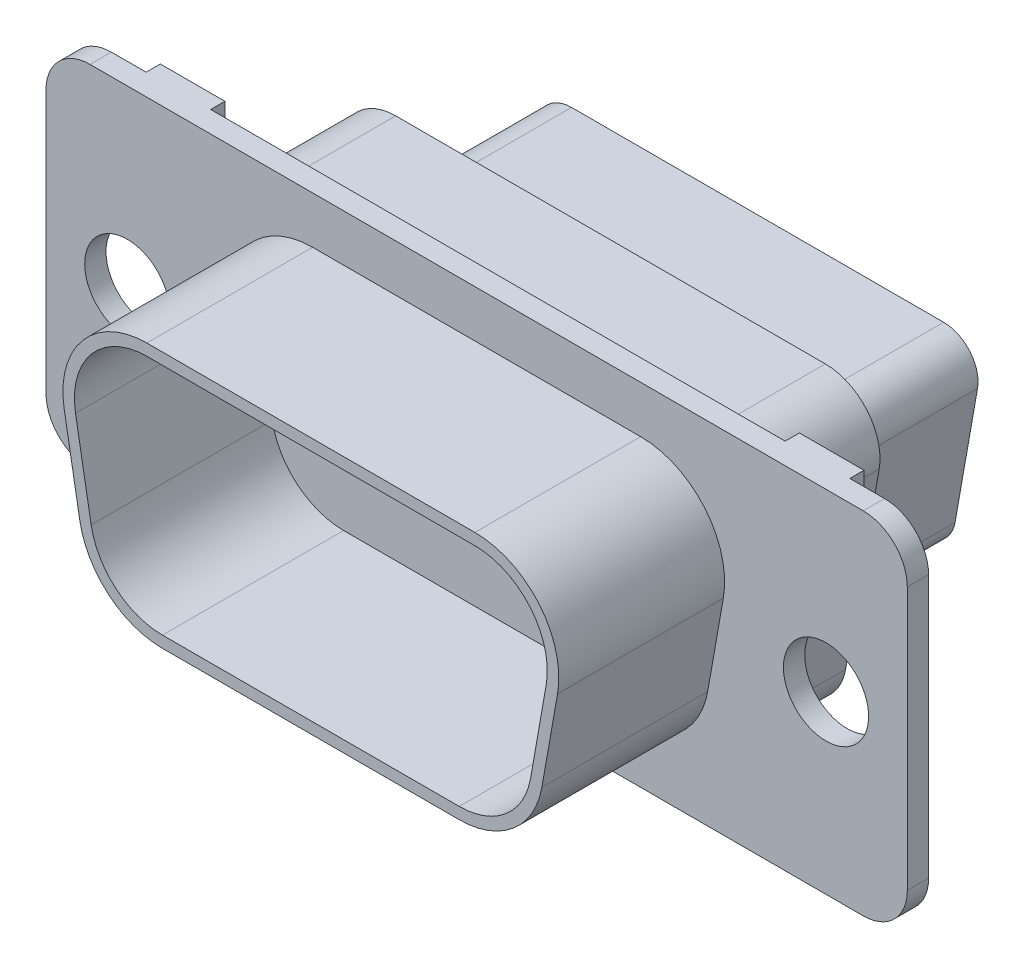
ISO-10303-21;
HEADER;
FILE_DESCRIPTION(('STEP AP214'),'2;1');
FILE_NAME('part.step','',(''),(''),'','','');
FILE_SCHEMA(('AUTOMOTIVE_DESIGN { 1 0 10303 214 1 1 1 1 }'));
ENDSEC;
DATA;
#1=APPLICATION_CONTEXT('core data for automotive mechanical design processes');
#2=APPLICATION_PROTOCOL_DEFINITION('international standard','automotive_design',2000,#1);
#3=PRODUCT_CONTEXT('',#1,'mechanical');
#4=PRODUCT('Part','Part','',(#3));
#5=PRODUCT_RELATED_PRODUCT_CATEGORY('part','',(#4));
#6=PRODUCT_DEFINITION_FORMATION('','',#4);
#7=PRODUCT_DEFINITION_CONTEXT('part definition',#1,'design');
#8=PRODUCT_DEFINITION('design','',#6,#7);
#9=PRODUCT_DEFINITION_SHAPE('','',#8);
#10=(LENGTH_UNIT() NAMED_UNIT(*) SI_UNIT(.MILLI.,.METRE.));
#11=(NAMED_UNIT(*) PLANE_ANGLE_UNIT() SI_UNIT($,.RADIAN.));
#12=(NAMED_UNIT(*) SI_UNIT($,.STERADIAN.) SOLID_ANGLE_UNIT());
#13=UNCERTAINTY_MEASURE_WITH_UNIT(LENGTH_MEASURE(1.E-05),#10,'distance_accuracy_value','');
#14=(GEOMETRIC_REPRESENTATION_CONTEXT(3) GLOBAL_UNCERTAINTY_ASSIGNED_CONTEXT((#13)) GLOBAL_UNIT_ASSIGNED_CONTEXT((#10,
#11,#12)) REPRESENTATION_CONTEXT('',''));
#15=CARTESIAN_POINT('',(0.,0.,0.));
#16=DIRECTION('',(0.,0.,1.));
#17=DIRECTION('',(1.,0.,0.));
#18=AXIS2_PLACEMENT_3D('',#15,#16,#17);
#19=CARTESIAN_POINT('',(-4.336142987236,0.284542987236,-14.979142));
#20=DIRECTION('',(0.,0.,-1.));
#21=DIRECTION('',(-1.,0.,0.));
#22=AXIS2_PLACEMENT_3D('',#19,#20,#21);
#23=PLANE('',#22);
#24=CARTESIAN_POINT('',(-5.4739,1.4223,-14.9791420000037));
#25=DIRECTION('',(0.,0.,-1.));
#26=DIRECTION('',(0.,1.,0.));
#27=AXIS2_PLACEMENT_3D('',#24,#25,#26);
#28=CIRCLE('',#27,1.09347);
#29=CARTESIAN_POINT('',(-5.4739,2.51577,-14.9791420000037));
#30=VERTEX_POINT('',#29);
#31=EDGE_CURVE('E20',#30,#30,#28,.F.);
#32=ORIENTED_EDGE('',*,*,#31,.F.);
#33=EDGE_LOOP('',(#32));
#34=FACE_BOUND('',#33,.T.);
#35=ADVANCED_FACE('F16',(#34),#23,.T.);
#36=CARTESIAN_POINT('',(-1.592942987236,0.284542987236,-14.979142));
#37=DIRECTION('',(0.,0.,-1.));
#38=DIRECTION('',(-1.,0.,0.));
#39=AXIS2_PLACEMENT_3D('',#36,#37,#38);
#40=PLANE('',#39);
#41=CARTESIAN_POINT('',(-2.7307,1.4223,-14.9791420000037));
#42=DIRECTION('',(0.,0.,-1.));
#43=DIRECTION('',(0.,1.,0.));
#44=AXIS2_PLACEMENT_3D('',#41,#42,#43);
#45=CIRCLE('',#44,1.09347);
#46=CARTESIAN_POINT('',(-2.7307,2.51577,-14.9791420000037));
#47=VERTEX_POINT('',#46);
#48=EDGE_CURVE('E393',#47,#47,#45,.F.);
#49=ORIENTED_EDGE('',*,*,#48,.F.);
#50=EDGE_LOOP('',(#49));
#51=FACE_BOUND('',#50,.T.);
#52=ADVANCED_FACE('F404',(#51),#40,.T.);
#53=CARTESIAN_POINT('',(1.150257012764,0.284542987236,-14.979142));
#54=DIRECTION('',(0.,0.,-1.));
#55=DIRECTION('',(-1.,0.,0.));
#56=AXIS2_PLACEMENT_3D('',#53,#54,#55);
#57=PLANE('',#56);
#58=CARTESIAN_POINT('',(0.0125,1.4223,-14.9791420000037));
#59=DIRECTION('',(0.,0.,-1.));
#60=DIRECTION('',(0.,1.,0.));
#61=AXIS2_PLACEMENT_3D('',#58,#59,#60);
#62=CIRCLE('',#61,1.09347);
#63=CARTESIAN_POINT('',(0.0125,2.51577,-14.9791420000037));
#64=VERTEX_POINT('',#63);
#65=EDGE_CURVE('E391',#64,#64,#62,.F.);
#66=ORIENTED_EDGE('',*,*,#65,.F.);
#67=EDGE_LOOP('',(#66));
#68=FACE_BOUND('',#67,.T.);
#69=ADVANCED_FACE('F410',(#68),#57,.T.);
#70=CARTESIAN_POINT('',(3.893457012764,0.284542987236,-14.979142));
#71=DIRECTION('',(0.,0.,-1.));
#72=DIRECTION('',(-1.,0.,0.));
#73=AXIS2_PLACEMENT_3D('',#70,#71,#72);
#74=PLANE('',#73);
#75=CARTESIAN_POINT('',(2.7557,1.4223,-14.9791420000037));
#76=DIRECTION('',(0.,0.,-1.));
#77=DIRECTION('',(0.,1.,0.));
#78=AXIS2_PLACEMENT_3D('',#75,#76,#77);
#79=CIRCLE('',#78,1.09347);
#80=CARTESIAN_POINT('',(2.7557,2.51577,-14.9791420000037));
#81=VERTEX_POINT('',#80);
#82=EDGE_CURVE('E388',#81,#81,#79,.F.);
#83=ORIENTED_EDGE('',*,*,#82,.F.);
#84=EDGE_LOOP('',(#83));
#85=FACE_BOUND('',#84,.T.);
#86=ADVANCED_FACE('F2161',(#85),#74,.T.);
#87=CARTESIAN_POINT('',(6.636657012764,0.284542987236,-14.979142));
#88=DIRECTION('',(0.,0.,-1.));
#89=DIRECTION('',(-1.,0.,0.));
#90=AXIS2_PLACEMENT_3D('',#87,#88,#89);
#91=PLANE('',#90);
#92=CARTESIAN_POINT('',(5.4989,1.4223,-14.9791420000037));
#93=DIRECTION('',(0.,0.,-1.));
#94=DIRECTION('',(0.,1.,0.));
#95=AXIS2_PLACEMENT_3D('',#92,#93,#94);
#96=CIRCLE('',#95,1.09347);
#97=CARTESIAN_POINT('',(5.4989,2.51577,-14.9791420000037));
#98=VERTEX_POINT('',#97);
#99=EDGE_CURVE('E385',#98,#98,#96,.F.);
#100=ORIENTED_EDGE('',*,*,#99,.F.);
#101=EDGE_LOOP('',(#100));
#102=FACE_BOUND('',#101,.T.);
#103=ADVANCED_FACE('F2152',(#102),#91,.T.);
#104=CARTESIAN_POINT('',(-2.964542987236,-2.560257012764,-14.979142));
#105=DIRECTION('',(0.,0.,-1.));
#106=DIRECTION('',(-1.,0.,0.));
#107=AXIS2_PLACEMENT_3D('',#104,#105,#106);
#108=PLANE('',#107);
#109=CARTESIAN_POINT('',(-4.1023,-1.4225,-14.9791420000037));
#110=DIRECTION('',(0.,0.,-1.));
#111=DIRECTION('',(0.,1.,0.));
#112=AXIS2_PLACEMENT_3D('',#109,#110,#111);
#113=CIRCLE('',#112,1.09347);
#114=CARTESIAN_POINT('',(-4.1023,-0.32903,-14.9791420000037));
#115=VERTEX_POINT('',#114);
#116=EDGE_CURVE('E382',#115,#115,#113,.F.);
#117=ORIENTED_EDGE('',*,*,#116,.F.);
#118=EDGE_LOOP('',(#117));
#119=FACE_BOUND('',#118,.T.);
#120=ADVANCED_FACE('F2144',(#119),#108,.T.);
#121=CARTESIAN_POINT('',(-0.221342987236,-2.560257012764,-14.979142));
#122=DIRECTION('',(0.,0.,-1.));
#123=DIRECTION('',(-1.,0.,0.));
#124=AXIS2_PLACEMENT_3D('',#121,#122,#123);
#125=PLANE('',#124);
#126=CARTESIAN_POINT('',(-1.3591,-1.4225,-14.9791420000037));
#127=DIRECTION('',(0.,0.,-1.));
#128=DIRECTION('',(0.,1.,0.));
#129=AXIS2_PLACEMENT_3D('',#126,#127,#128);
#130=CIRCLE('',#129,1.09347);
#131=CARTESIAN_POINT('',(-1.3591,-0.32903,-14.9791420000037));
#132=VERTEX_POINT('',#131);
#133=EDGE_CURVE('E379',#132,#132,#130,.F.);
#134=ORIENTED_EDGE('',*,*,#133,.F.);
#135=EDGE_LOOP('',(#134));
#136=FACE_BOUND('',#135,.T.);
#137=ADVANCED_FACE('F1439',(#136),#125,.T.);
#138=CARTESIAN_POINT('',(2.521857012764,-2.560257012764,-14.979142));
#139=DIRECTION('',(0.,0.,-1.));
#140=DIRECTION('',(-1.,0.,0.));
#141=AXIS2_PLACEMENT_3D('',#138,#139,#140);
#142=PLANE('',#141);
#143=CARTESIAN_POINT('',(1.3841,-1.4225,-14.9791420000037));
#144=DIRECTION('',(0.,0.,-1.));
#145=DIRECTION('',(0.,1.,0.));
#146=AXIS2_PLACEMENT_3D('',#143,#144,#145);
#147=CIRCLE('',#146,1.09347);
#148=CARTESIAN_POINT('',(1.3841,-0.32903,-14.9791420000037));
#149=VERTEX_POINT('',#148);
#150=EDGE_CURVE('E376',#149,#149,#147,.F.);
#151=ORIENTED_EDGE('',*,*,#150,.F.);
#152=EDGE_LOOP('',(#151));
#153=FACE_BOUND('',#152,.T.);
#154=ADVANCED_FACE('F1433',(#153),#142,.T.);
#155=CARTESIAN_POINT('',(5.265057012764,-2.560257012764,-14.979142));
#156=DIRECTION('',(0.,0.,-1.));
#157=DIRECTION('',(-1.,0.,0.));
#158=AXIS2_PLACEMENT_3D('',#155,#156,#157);
#159=PLANE('',#158);
#160=CARTESIAN_POINT('',(4.1273,-1.4225,-14.9791420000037));
#161=DIRECTION('',(0.,0.,-1.));
#162=DIRECTION('',(0.,1.,0.));
#163=AXIS2_PLACEMENT_3D('',#160,#161,#162);
#164=CIRCLE('',#163,1.09347);
#165=CARTESIAN_POINT('',(4.1273,-0.329030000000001,-14.9791420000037));
#166=VERTEX_POINT('',#165);
#167=EDGE_CURVE('E313',#166,#166,#164,.F.);
#168=ORIENTED_EDGE('',*,*,#167,.F.);
#169=EDGE_LOOP('',(#168));
#170=FACE_BOUND('',#169,.T.);
#171=ADVANCED_FACE('F1429',(#170),#159,.T.);
#172=CARTESIAN_POINT('',(-5.4739,1.4223,-14.9791420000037));
#173=DIRECTION('',(0.,0.,-1.));
#174=DIRECTION('',(0.,1.,0.));
#175=AXIS2_PLACEMENT_3D('',#172,#173,#174);
#176=CYLINDRICAL_SURFACE('',#175,1.09347);
#177=ORIENTED_EDGE('',*,*,#31,.T.);
#178=EDGE_LOOP('',(#177));
#179=FACE_BOUND('',#178,.T.);
#180=CARTESIAN_POINT('',(-5.4739,1.4223,-15.9791399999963));
#181=DIRECTION('',(0.,0.,-1.));
#182=DIRECTION('',(0.,1.,0.));
#183=AXIS2_PLACEMENT_3D('',#180,#181,#182);
#184=CIRCLE('',#183,1.09347);
#185=CARTESIAN_POINT('',(-5.4739,2.51577,-15.9791399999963));
#186=VERTEX_POINT('',#185);
#187=EDGE_CURVE('E367',#186,#186,#184,.F.);
#188=ORIENTED_EDGE('',*,*,#187,.F.);
#189=EDGE_LOOP('',(#188));
#190=FACE_BOUND('',#189,.T.);
#191=ADVANCED_FACE('F400',(#179,#190),#176,.F.);
#192=CARTESIAN_POINT('',(-2.7307,1.4223,-14.9791420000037));
#193=DIRECTION('',(0.,0.,-1.));
#194=DIRECTION('',(0.,1.,0.));
#195=AXIS2_PLACEMENT_3D('',#192,#193,#194);
#196=CYLINDRICAL_SURFACE('',#195,1.09347);
#197=ORIENTED_EDGE('',*,*,#48,.T.);
#198=EDGE_LOOP('',(#197));
#199=FACE_BOUND('',#198,.T.);
#200=CARTESIAN_POINT('',(-2.7307,1.4223,-15.9791399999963));
#201=DIRECTION('',(0.,0.,-1.));
#202=DIRECTION('',(0.,1.,0.));
#203=AXIS2_PLACEMENT_3D('',#200,#201,#202);
#204=CIRCLE('',#203,1.09347);
#205=CARTESIAN_POINT('',(-2.7307,2.51577,-15.9791399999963));
#206=VERTEX_POINT('',#205);
#207=EDGE_CURVE('E364',#206,#206,#204,.F.);
#208=ORIENTED_EDGE('',*,*,#207,.F.);
#209=EDGE_LOOP('',(#208));
#210=FACE_BOUND('',#209,.T.);
#211=ADVANCED_FACE('F1425',(#199,#210),#196,.F.);
#212=CARTESIAN_POINT('',(0.0125,1.4223,-14.9791420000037));
#213=DIRECTION('',(0.,0.,-1.));
#214=DIRECTION('',(0.,1.,0.));
#215=AXIS2_PLACEMENT_3D('',#212,#213,#214);
#216=CYLINDRICAL_SURFACE('',#215,1.09347);
#217=ORIENTED_EDGE('',*,*,#65,.T.);
#218=EDGE_LOOP('',(#217));
#219=FACE_BOUND('',#218,.T.);
#220=CARTESIAN_POINT('',(0.0125,1.4223,-15.9791399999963));
#221=DIRECTION('',(0.,0.,-1.));
#222=DIRECTION('',(0.,1.,0.));
#223=AXIS2_PLACEMENT_3D('',#220,#221,#222);
#224=CIRCLE('',#223,1.09347);
#225=CARTESIAN_POINT('',(0.0125,2.51577,-15.9791399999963));
#226=VERTEX_POINT('',#225);
#227=EDGE_CURVE('E361',#226,#226,#224,.F.);
#228=ORIENTED_EDGE('',*,*,#227,.F.);
#229=EDGE_LOOP('',(#228));
#230=FACE_BOUND('',#229,.T.);
#231=ADVANCED_FACE('F1421',(#219,#230),#216,.F.);
#232=CARTESIAN_POINT('',(2.7557,1.4223,-14.9791420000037));
#233=DIRECTION('',(0.,0.,-1.));
#234=DIRECTION('',(0.,1.,0.));
#235=AXIS2_PLACEMENT_3D('',#232,#233,#234);
#236=CYLINDRICAL_SURFACE('',#235,1.09347);
#237=ORIENTED_EDGE('',*,*,#82,.T.);
#238=EDGE_LOOP('',(#237));
#239=FACE_BOUND('',#238,.T.);
#240=CARTESIAN_POINT('',(2.7557,1.4223,-15.9791399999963));
#241=DIRECTION('',(0.,0.,-1.));
#242=DIRECTION('',(0.,1.,0.));
#243=AXIS2_PLACEMENT_3D('',#240,#241,#242);
#244=CIRCLE('',#243,1.09347);
#245=CARTESIAN_POINT('',(2.7557,2.51577,-15.9791399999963));
#246=VERTEX_POINT('',#245);
#247=EDGE_CURVE('E358',#246,#246,#244,.F.);
#248=ORIENTED_EDGE('',*,*,#247,.F.);
#249=EDGE_LOOP('',(#248));
#250=FACE_BOUND('',#249,.T.);
#251=ADVANCED_FACE('F1417',(#239,#250),#236,.F.);
#252=CARTESIAN_POINT('',(5.4989,1.4223,-14.9791420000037));
#253=DIRECTION('',(0.,0.,-1.));
#254=DIRECTION('',(0.,1.,0.));
#255=AXIS2_PLACEMENT_3D('',#252,#253,#254);
#256=CYLINDRICAL_SURFACE('',#255,1.09347);
#257=ORIENTED_EDGE('',*,*,#99,.T.);
#258=EDGE_LOOP('',(#257));
#259=FACE_BOUND('',#258,.T.);
#260=CARTESIAN_POINT('',(5.4989,1.4223,-15.9791399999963));
#261=DIRECTION('',(0.,0.,-1.));
#262=DIRECTION('',(0.,1.,0.));
#263=AXIS2_PLACEMENT_3D('',#260,#261,#262);
#264=CIRCLE('',#263,1.09347);
#265=CARTESIAN_POINT('',(5.4989,2.51577,-15.9791399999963));
#266=VERTEX_POINT('',#265);
#267=EDGE_CURVE('E355',#266,#266,#264,.F.);
#268=ORIENTED_EDGE('',*,*,#267,.F.);
#269=EDGE_LOOP('',(#268));
#270=FACE_BOUND('',#269,.T.);
#271=ADVANCED_FACE('F1413',(#259,#270),#256,.F.);
#272=CARTESIAN_POINT('',(-4.1023,-1.4225,-14.9791420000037));
#273=DIRECTION('',(0.,0.,-1.));
#274=DIRECTION('',(0.,1.,0.));
#275=AXIS2_PLACEMENT_3D('',#272,#273,#274);
#276=CYLINDRICAL_SURFACE('',#275,1.09347);
#277=ORIENTED_EDGE('',*,*,#116,.T.);
#278=EDGE_LOOP('',(#277));
#279=FACE_BOUND('',#278,.T.);
#280=CARTESIAN_POINT('',(-4.1023,-1.4225,-15.9791399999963));
#281=DIRECTION('',(0.,0.,-1.));
#282=DIRECTION('',(0.,1.,0.));
#283=AXIS2_PLACEMENT_3D('',#280,#281,#282);
#284=CIRCLE('',#283,1.09347);
#285=CARTESIAN_POINT('',(-4.1023,-0.32903,-15.9791399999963));
#286=VERTEX_POINT('',#285);
#287=EDGE_CURVE('E352',#286,#286,#284,.F.);
#288=ORIENTED_EDGE('',*,*,#287,.F.);
#289=EDGE_LOOP('',(#288));
#290=FACE_BOUND('',#289,.T.);
#291=ADVANCED_FACE('F1409',(#279,#290),#276,.F.);
#292=CARTESIAN_POINT('',(-1.3591,-1.4225,-14.9791420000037));
#293=DIRECTION('',(0.,0.,-1.));
#294=DIRECTION('',(0.,1.,0.));
#295=AXIS2_PLACEMENT_3D('',#292,#293,#294);
#296=CYLINDRICAL_SURFACE('',#295,1.09347);
#297=ORIENTED_EDGE('',*,*,#133,.T.);
#298=EDGE_LOOP('',(#297));
#299=FACE_BOUND('',#298,.T.);
#300=CARTESIAN_POINT('',(-1.3591,-1.4225,-15.9791399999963));
#301=DIRECTION('',(0.,0.,-1.));
#302=DIRECTION('',(0.,1.,0.));
#303=AXIS2_PLACEMENT_3D('',#300,#301,#302);
#304=CIRCLE('',#303,1.09347);
#305=CARTESIAN_POINT('',(-1.3591,-0.32903,-15.9791399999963));
#306=VERTEX_POINT('',#305);
#307=EDGE_CURVE('E349',#306,#306,#304,.F.);
#308=ORIENTED_EDGE('',*,*,#307,.F.);
#309=EDGE_LOOP('',(#308));
#310=FACE_BOUND('',#309,.T.);
#311=ADVANCED_FACE('F1405',(#299,#310),#296,.F.);
#312=CARTESIAN_POINT('',(1.3841,-1.4225,-14.9791420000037));
#313=DIRECTION('',(0.,0.,-1.));
#314=DIRECTION('',(0.,1.,0.));
#315=AXIS2_PLACEMENT_3D('',#312,#313,#314);
#316=CYLINDRICAL_SURFACE('',#315,1.09347);
#317=ORIENTED_EDGE('',*,*,#150,.T.);
#318=EDGE_LOOP('',(#317));
#319=FACE_BOUND('',#318,.T.);
#320=CARTESIAN_POINT('',(1.3841,-1.4225,-15.9791399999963));
#321=DIRECTION('',(0.,0.,-1.));
#322=DIRECTION('',(0.,1.,0.));
#323=AXIS2_PLACEMENT_3D('',#320,#321,#322);
#324=CIRCLE('',#323,1.09347);
#325=CARTESIAN_POINT('',(1.3841,-0.32903,-15.9791399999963));
#326=VERTEX_POINT('',#325);
#327=EDGE_CURVE('E346',#326,#326,#324,.F.);
#328=ORIENTED_EDGE('',*,*,#327,.F.);
#329=EDGE_LOOP('',(#328));
#330=FACE_BOUND('',#329,.T.);
#331=ADVANCED_FACE('F1401',(#319,#330),#316,.F.);
#332=CARTESIAN_POINT('',(4.1273,-1.4225,-14.9791420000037));
#333=DIRECTION('',(0.,0.,-1.));
#334=DIRECTION('',(0.,1.,0.));
#335=AXIS2_PLACEMENT_3D('',#332,#333,#334);
#336=CYLINDRICAL_SURFACE('',#335,1.09347);
#337=ORIENTED_EDGE('',*,*,#167,.T.);
#338=EDGE_LOOP('',(#337));
#339=FACE_BOUND('',#338,.T.);
#340=CARTESIAN_POINT('',(4.1273,-1.4225,-15.9791399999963));
#341=DIRECTION('',(0.,0.,-1.));
#342=DIRECTION('',(0.,1.,0.));
#343=AXIS2_PLACEMENT_3D('',#340,#341,#342);
#344=CIRCLE('',#343,1.09347);
#345=CARTESIAN_POINT('',(4.1273,-0.329030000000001,-15.9791399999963));
#346=VERTEX_POINT('',#345);
#347=EDGE_CURVE('E343',#346,#346,#344,.F.);
#348=ORIENTED_EDGE('',*,*,#347,.F.);
#349=EDGE_LOOP('',(#348));
#350=FACE_BOUND('',#349,.T.);
#351=ADVANCED_FACE('F1398',(#339,#350),#336,.F.);
#352=CARTESIAN_POINT('',(5.853276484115,-2.2734,-10.7188));
#353=DIRECTION('',(0.,0.,-1.));
#354=DIRECTION('',(-1.,0.,0.));
#355=AXIS2_PLACEMENT_3D('',#352,#353,#354);
#356=CYLINDRICAL_SURFACE('',#355,1.2319);
#357=CARTESIAN_POINT('',(5.853276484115,-2.2734,-15.9791399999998));
#358=DIRECTION('',(0.,0.,-1.));
#359=DIRECTION('',(-1.,0.,0.));
#360=AXIS2_PLACEMENT_3D('',#357,#358,#359);
#361=CIRCLE('',#360,1.2319);
#362=CARTESIAN_POINT('',(7.06646115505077,-2.48731719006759,-15.9791399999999));
#363=VERTEX_POINT('',#362);
#364=CARTESIAN_POINT('',(5.85327648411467,-3.5053,-15.9791399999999));
#365=VERTEX_POINT('',#364);
#366=EDGE_CURVE('E318',#363,#365,#361,.T.);
#367=ORIENTED_EDGE('',*,*,#366,.F.);
#368=DIRECTION('',(0.,0.,-1.));
#369=VECTOR('',#368,1.);
#370=CARTESIAN_POINT('',(7.06646115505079,-2.48731719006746,-13.34897));
#371=LINE('',#370,#369);
#372=CARTESIAN_POINT('',(7.06646115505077,-2.48731719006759,-10.7188));
#373=VERTEX_POINT('',#372);
#374=EDGE_CURVE('E316',#373,#363,#371,.T.);
#375=ORIENTED_EDGE('',*,*,#374,.F.);
#376=CARTESIAN_POINT('',(5.853276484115,-2.2734,-10.7188));
#377=DIRECTION('',(0.,0.,-1.));
#378=DIRECTION('',(-1.,0.,0.));
#379=AXIS2_PLACEMENT_3D('',#376,#377,#378);
#380=CIRCLE('',#379,1.2319);
#381=CARTESIAN_POINT('',(5.85327648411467,-3.5053,-10.7188));
#382=VERTEX_POINT('',#381);
#383=EDGE_CURVE('E299',#382,#373,#380,.F.);
#384=ORIENTED_EDGE('',*,*,#383,.F.);
#385=DIRECTION('',(0.,0.,1.));
#386=VECTOR('',#385,1.);
#387=CARTESIAN_POINT('',(5.85327648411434,-3.5053,-13.34897));
#388=LINE('',#387,#386);
#389=EDGE_CURVE('E665',#365,#382,#388,.T.);
#390=ORIENTED_EDGE('',*,*,#389,.F.);
#391=EDGE_LOOP('',(#367,#375,#384,#390));
#392=FACE_BOUND('',#391,.T.);
#393=ADVANCED_FACE('F317',(#392),#356,.T.);
#394=CARTESIAN_POINT('',(-5.853276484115,-2.2734,-10.7188));
#395=DIRECTION('',(0.,0.,-1.));
#396=DIRECTION('',(-1.,0.,0.));
#397=AXIS2_PLACEMENT_3D('',#394,#395,#396);
#398=CYLINDRICAL_SURFACE('',#397,1.2319);
#399=CARTESIAN_POINT('',(-5.853276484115,-2.2734,-15.9791399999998));
#400=DIRECTION('',(0.,0.,-1.));
#401=DIRECTION('',(-1.,0.,0.));
#402=AXIS2_PLACEMENT_3D('',#399,#400,#401);
#403=CIRCLE('',#402,1.2319);
#404=CARTESIAN_POINT('',(-5.85327648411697,-3.5053,-15.9791399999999));
#405=VERTEX_POINT('',#404);
#406=CARTESIAN_POINT('',(-7.06646115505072,-2.48731719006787,-15.9791399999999));
#407=VERTEX_POINT('',#406);
#408=EDGE_CURVE('E370',#405,#407,#403,.T.);
#409=ORIENTED_EDGE('',*,*,#408,.F.);
#410=DIRECTION('',(0.,0.,-1.));
#411=VECTOR('',#410,1.);
#412=CARTESIAN_POINT('',(-5.85327648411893,-3.5053,-13.34897));
#413=LINE('',#412,#411);
#414=CARTESIAN_POINT('',(-5.85327648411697,-3.5053,-10.7188));
#415=VERTEX_POINT('',#414);
#416=EDGE_CURVE('E668',#415,#405,#413,.T.);
#417=ORIENTED_EDGE('',*,*,#416,.F.);
#418=CARTESIAN_POINT('',(-5.853276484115,-2.2734,-10.7188));
#419=DIRECTION('',(0.,0.,-1.));
#420=DIRECTION('',(-1.,0.,0.));
#421=AXIS2_PLACEMENT_3D('',#418,#419,#420);
#422=CIRCLE('',#421,1.2319);
#423=CARTESIAN_POINT('',(-7.06646115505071,-2.48731719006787,-10.7188));
#424=VERTEX_POINT('',#423);
#425=EDGE_CURVE('E312',#424,#415,#422,.F.);
#426=ORIENTED_EDGE('',*,*,#425,.F.);
#427=DIRECTION('',(0.,0.,1.));
#428=VECTOR('',#427,1.);
#429=CARTESIAN_POINT('',(-7.06646115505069,-2.48731719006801,-13.34897));
#430=LINE('',#429,#428);
#431=EDGE_CURVE('E646',#407,#424,#430,.T.);
#432=ORIENTED_EDGE('',*,*,#431,.F.);
#433=EDGE_LOOP('',(#409,#417,#426,#432));
#434=FACE_BOUND('',#433,.T.);
#435=ADVANCED_FACE('F1392',(#434),#398,.T.);
#436=CARTESIAN_POINT('',(8.203385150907,-3.645512,-15.97914));
#437=DIRECTION('',(0.,0.,-1.));
#438=DIRECTION('',(-1.,0.,0.));
#439=AXIS2_PLACEMENT_3D('',#436,#437,#438);
#440=PLANE('',#439);
#441=ORIENTED_EDGE('',*,*,#347,.T.);
#442=EDGE_LOOP('',(#441));
#443=FACE_BOUND('',#442,.T.);
#444=ORIENTED_EDGE('',*,*,#327,.T.);
#445=EDGE_LOOP('',(#444));
#446=FACE_BOUND('',#445,.T.);
#447=ORIENTED_EDGE('',*,*,#307,.T.);
#448=EDGE_LOOP('',(#447));
#449=FACE_BOUND('',#448,.T.);
#450=ORIENTED_EDGE('',*,*,#287,.T.);
#451=EDGE_LOOP('',(#450));
#452=FACE_BOUND('',#451,.T.);
#453=ORIENTED_EDGE('',*,*,#267,.T.);
#454=EDGE_LOOP('',(#453));
#455=FACE_BOUND('',#454,.T.);
#456=ORIENTED_EDGE('',*,*,#247,.T.);
#457=EDGE_LOOP('',(#456));
#458=FACE_BOUND('',#457,.T.);
#459=ORIENTED_EDGE('',*,*,#227,.T.);
#460=EDGE_LOOP('',(#459));
#461=FACE_BOUND('',#460,.T.);
#462=ORIENTED_EDGE('',*,*,#207,.T.);
#463=EDGE_LOOP('',(#462));
#464=FACE_BOUND('',#463,.T.);
#465=ORIENTED_EDGE('',*,*,#187,.T.);
#466=EDGE_LOOP('',(#465));
#467=FACE_BOUND('',#466,.T.);
#468=CARTESIAN_POINT('',(-6.655,2.2734,-15.9791399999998));
#469=DIRECTION('',(0.,0.,-1.));
#470=DIRECTION('',(-1.,0.,0.));
#471=AXIS2_PLACEMENT_3D('',#468,#469,#470);
#472=CIRCLE('',#471,1.2319);
#473=CARTESIAN_POINT('',(-7.86818467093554,2.05948280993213,-15.9791399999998));
#474=VERTEX_POINT('',#473);
#475=CARTESIAN_POINT('',(-6.655,3.5053,-15.9791399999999));
#476=VERTEX_POINT('',#475);
#477=EDGE_CURVE('E338',#474,#476,#472,.T.);
#478=ORIENTED_EDGE('',*,*,#477,.T.);
#479=DIRECTION('',(-1.,0.,0.));
#480=VECTOR('',#479,1.);
#481=CARTESIAN_POINT('',(0.,3.5053,-15.97914));
#482=LINE('',#481,#480);
#483=CARTESIAN_POINT('',(6.655,3.5053,-15.9791399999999));
#484=VERTEX_POINT('',#483);
#485=EDGE_CURVE('E655',#484,#476,#482,.T.);
#486=ORIENTED_EDGE('',*,*,#485,.F.);
#487=CARTESIAN_POINT('',(6.655,2.2734,-15.9791399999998));
#488=DIRECTION('',(0.,0.,-1.));
#489=DIRECTION('',(-1.,0.,0.));
#490=AXIS2_PLACEMENT_3D('',#487,#488,#489);
#491=CIRCLE('',#490,1.2319);
#492=CARTESIAN_POINT('',(7.86818467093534,2.05948280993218,-15.9791399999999));
#493=VERTEX_POINT('',#492);
#494=EDGE_CURVE('E323',#484,#493,#491,.T.);
#495=ORIENTED_EDGE('',*,*,#494,.T.);
#496=DIRECTION('',(0.173648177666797,0.984807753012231,0.));
#497=VECTOR('',#496,1.);
#498=CARTESIAN_POINT('',(7.467322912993,-0.213917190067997,-15.97914));
#499=LINE('',#498,#497);
#500=EDGE_CURVE('E322',#363,#493,#499,.T.);
#501=ORIENTED_EDGE('',*,*,#500,.F.);
#502=ORIENTED_EDGE('',*,*,#366,.T.);
#503=DIRECTION('',(1.,0.,0.));
#504=VECTOR('',#503,1.);
#505=CARTESIAN_POINT('',(0.,-3.5053,-15.97914));
#506=LINE('',#505,#504);
#507=EDGE_CURVE('E667',#405,#365,#506,.T.);
#508=ORIENTED_EDGE('',*,*,#507,.F.);
#509=ORIENTED_EDGE('',*,*,#408,.T.);
#510=DIRECTION('',(0.173648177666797,-0.984807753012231,0.));
#511=VECTOR('',#510,1.);
#512=CARTESIAN_POINT('',(-7.467322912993,-0.213917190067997,-15.97914));
#513=LINE('',#512,#511);
#514=EDGE_CURVE('E664',#474,#407,#513,.T.);
#515=ORIENTED_EDGE('',*,*,#514,.F.);
#516=EDGE_LOOP('',(#478,#486,#495,#501,#502,#508,#509,#515));
#517=FACE_BOUND('',#516,.T.);
#518=ADVANCED_FACE('F1390',(#443,#446,#449,#452,#455,#458,#461,#464,#467,#517),#440,.T.);
#519=CARTESIAN_POINT('',(6.655,2.2734,-10.7188));
#520=DIRECTION('',(0.,0.,-1.));
#521=DIRECTION('',(-1.,0.,0.));
#522=AXIS2_PLACEMENT_3D('',#519,#520,#521);
#523=CYLINDRICAL_SURFACE('',#522,1.2319);
#524=ORIENTED_EDGE('',*,*,#494,.F.);
#525=DIRECTION('',(0.,0.,-1.));
#526=VECTOR('',#525,1.);
#527=CARTESIAN_POINT('',(6.655,3.5053,-13.34897));
#528=LINE('',#527,#526);
#529=CARTESIAN_POINT('',(6.655,3.5053,-10.7188));
#530=VERTEX_POINT('',#529);
#531=EDGE_CURVE('E340',#530,#484,#528,.T.);
#532=ORIENTED_EDGE('',*,*,#531,.F.);
#533=CARTESIAN_POINT('',(6.655,2.2734,-10.7188));
#534=DIRECTION('',(0.,0.,-1.));
#535=DIRECTION('',(-1.,0.,0.));
#536=AXIS2_PLACEMENT_3D('',#533,#534,#535);
#537=CIRCLE('',#536,1.2319);
#538=CARTESIAN_POINT('',(7.86818467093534,2.05948280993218,-10.7188));
#539=VERTEX_POINT('',#538);
#540=EDGE_CURVE('E329',#530,#539,#537,.T.);
#541=ORIENTED_EDGE('',*,*,#540,.T.);
#542=DIRECTION('',(0.,0.,1.));
#543=VECTOR('',#542,1.);
#544=CARTESIAN_POINT('',(7.86818467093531,2.05948280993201,-13.34897));
#545=LINE('',#544,#543);
#546=EDGE_CURVE('E328',#493,#539,#545,.T.);
#547=ORIENTED_EDGE('',*,*,#546,.F.);
#548=EDGE_LOOP('',(#524,#532,#541,#547));
#549=FACE_BOUND('',#548,.T.);
#550=ADVANCED_FACE('F1387',(#549),#523,.T.);
#551=CARTESIAN_POINT('',(7.884219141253,2.150418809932,-10.6135932));
#552=DIRECTION('',(0.984807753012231,-0.173648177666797,0.));
#553=DIRECTION('',(-0.173648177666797,-0.984807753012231,0.));
#554=AXIS2_PLACEMENT_3D('',#551,#552,#553);
#555=PLANE('',#554);
#556=ORIENTED_EDGE('',*,*,#500,.T.);
#557=ORIENTED_EDGE('',*,*,#546,.T.);
#558=DIRECTION('',(-0.173648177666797,-0.984807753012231,0.));
#559=VECTOR('',#558,1.);
#560=CARTESIAN_POINT('',(7.884219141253,2.150418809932,-10.7188));
#561=LINE('',#560,#559);
#562=EDGE_CURVE('E309',#539,#373,#561,.T.);
#563=ORIENTED_EDGE('',*,*,#562,.T.);
#564=ORIENTED_EDGE('',*,*,#374,.T.);
#565=EDGE_LOOP('',(#556,#557,#563,#564));
#566=FACE_BOUND('',#565,.T.);
#567=ADVANCED_FACE('F326',(#566),#555,.T.);
#568=CARTESIAN_POINT('',(6.087407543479,-3.5053,-10.6135932));
#569=DIRECTION('',(0.,-1.,0.));
#570=DIRECTION('',(-1.,0.,0.));
#571=AXIS2_PLACEMENT_3D('',#568,#569,#570);
#572=PLANE('',#571);
#573=ORIENTED_EDGE('',*,*,#507,.T.);
#574=ORIENTED_EDGE('',*,*,#389,.T.);
#575=DIRECTION('',(-1.,0.,0.));
#576=VECTOR('',#575,1.);
#577=CARTESIAN_POINT('',(0.,-3.5053,-10.7188));
#578=LINE('',#577,#576);
#579=EDGE_CURVE('E311',#382,#415,#578,.T.);
#580=ORIENTED_EDGE('',*,*,#579,.T.);
#581=ORIENTED_EDGE('',*,*,#416,.T.);
#582=EDGE_LOOP('',(#573,#574,#580,#581));
#583=FACE_BOUND('',#582,.T.);
#584=ADVANCED_FACE('F1450',(#583),#572,.T.);
#585=CARTESIAN_POINT('',(-7.050426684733,-2.578253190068,-10.6135932));
#586=DIRECTION('',(-0.984807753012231,-0.173648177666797,0.));
#587=DIRECTION('',(-0.173648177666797,0.984807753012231,0.));
#588=AXIS2_PLACEMENT_3D('',#585,#586,#587);
#589=PLANE('',#588);
#590=ORIENTED_EDGE('',*,*,#514,.T.);
#591=ORIENTED_EDGE('',*,*,#431,.T.);
#592=DIRECTION('',(-0.173648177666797,0.984807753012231,0.));
#593=VECTOR('',#592,1.);
#594=CARTESIAN_POINT('',(-7.050426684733,-2.578253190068,-10.7188));
#595=LINE('',#594,#593);
#596=CARTESIAN_POINT('',(-7.86818467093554,2.05948280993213,-10.7188));
#597=VERTEX_POINT('',#596);
#598=EDGE_CURVE('E331',#424,#597,#595,.T.);
#599=ORIENTED_EDGE('',*,*,#598,.T.);
#600=DIRECTION('',(0.,0.,-1.));
#601=VECTOR('',#600,1.);
#602=CARTESIAN_POINT('',(-7.86818467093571,2.05948280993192,-13.34897));
#603=LINE('',#602,#601);
#604=EDGE_CURVE('E341',#597,#474,#603,.T.);
#605=ORIENTED_EDGE('',*,*,#604,.T.);
#606=EDGE_LOOP('',(#590,#591,#599,#605));
#607=FACE_BOUND('',#606,.T.);
#608=ADVANCED_FACE('F643',(#607),#589,.T.);
#609=CARTESIAN_POINT('',(-6.655,2.2734,-10.7188));
#610=DIRECTION('',(0.,0.,-1.));
#611=DIRECTION('',(-1.,0.,0.));
#612=AXIS2_PLACEMENT_3D('',#609,#610,#611);
#613=CYLINDRICAL_SURFACE('',#612,1.2319);
#614=ORIENTED_EDGE('',*,*,#477,.F.);
#615=ORIENTED_EDGE('',*,*,#604,.F.);
#616=CARTESIAN_POINT('',(-6.655,2.2734,-10.7188));
#617=DIRECTION('',(0.,0.,-1.));
#618=DIRECTION('',(-1.,0.,0.));
#619=AXIS2_PLACEMENT_3D('',#616,#617,#618);
#620=CIRCLE('',#619,1.2319);
#621=CARTESIAN_POINT('',(-6.655,3.5053,-10.7188));
#622=VERTEX_POINT('',#621);
#623=EDGE_CURVE('E629',#597,#622,#620,.T.);
#624=ORIENTED_EDGE('',*,*,#623,.T.);
#625=DIRECTION('',(0.,0.,1.));
#626=VECTOR('',#625,1.);
#627=CARTESIAN_POINT('',(-6.655,3.5053,-13.34897));
#628=LINE('',#627,#626);
#629=EDGE_CURVE('E333',#476,#622,#628,.T.);
#630=ORIENTED_EDGE('',*,*,#629,.F.);
#631=EDGE_LOOP('',(#614,#615,#624,#630));
#632=FACE_BOUND('',#631,.T.);
#633=ADVANCED_FACE('F647',(#632),#613,.T.);
#634=CARTESIAN_POINT('',(-6.9212,3.5053,-10.6135932));
#635=DIRECTION('',(0.,1.,0.));
#636=DIRECTION('',(1.,0.,0.));
#637=AXIS2_PLACEMENT_3D('',#634,#635,#636);
#638=PLANE('',#637);
#639=ORIENTED_EDGE('',*,*,#485,.T.);
#640=ORIENTED_EDGE('',*,*,#629,.T.);
#641=DIRECTION('',(1.,0.,0.));
#642=VECTOR('',#641,1.);
#643=CARTESIAN_POINT('',(0.,3.5053,-10.7188));
#644=LINE('',#643,#642);
#645=EDGE_CURVE('E630',#622,#530,#644,.T.);
#646=ORIENTED_EDGE('',*,*,#645,.T.);
#647=ORIENTED_EDGE('',*,*,#531,.T.);
#648=EDGE_LOOP('',(#639,#640,#646,#647));
#649=FACE_BOUND('',#648,.T.);
#650=ADVANCED_FACE('F653',(#649),#638,.T.);
#651=CARTESIAN_POINT('',(-10.02563214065,-5.57388,-10.7188));
#652=DIRECTION('',(0.,0.,1.));
#653=DIRECTION('',(1.,0.,0.));
#654=AXIS2_PLACEMENT_3D('',#651,#652,#653);
#655=PLANE('',#654);
#656=ORIENTED_EDGE('',*,*,#623,.F.);
#657=ORIENTED_EDGE('',*,*,#598,.F.);
#658=ORIENTED_EDGE('',*,*,#425,.T.);
#659=ORIENTED_EDGE('',*,*,#579,.F.);
#660=ORIENTED_EDGE('',*,*,#383,.T.);
#661=ORIENTED_EDGE('',*,*,#562,.F.);
#662=ORIENTED_EDGE('',*,*,#540,.F.);
#663=ORIENTED_EDGE('',*,*,#645,.F.);
#664=EDGE_LOOP('',(#656,#657,#658,#659,#660,#661,#662,#663));
#665=FACE_BOUND('',#664,.T.);
#666=CARTESIAN_POINT('',(7.6837,3.4037,-10.7188));
#667=DIRECTION('',(0.,0.,1.));
#668=DIRECTION('',(1.,0.,0.));
#669=AXIS2_PLACEMENT_3D('',#666,#667,#668);
#670=CIRCLE('',#669,1.9558);
#671=CARTESIAN_POINT('',(7.6837,5.3595,-10.7188));
#672=VERTEX_POINT('',#671);
#673=CARTESIAN_POINT('',(9.60978700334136,3.06407889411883,-10.7188));
#674=VERTEX_POINT('',#673);
#675=EDGE_CURVE('E614',#672,#674,#670,.F.);
#676=ORIENTED_EDGE('',*,*,#675,.T.);
#677=DIRECTION('',(0.173648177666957,0.984807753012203,0.));
#678=VECTOR('',#677,1.);
#679=CARTESIAN_POINT('',(9.009622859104,-0.339621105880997,-10.7188));
#680=LINE('',#679,#678);
#681=CARTESIAN_POINT('',(8.40945871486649,-3.74332110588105,-10.7188));
#682=VERTEX_POINT('',#681);
#683=EDGE_CURVE('E617',#682,#674,#680,.T.);
#684=ORIENTED_EDGE('',*,*,#683,.F.);
#685=CARTESIAN_POINT('',(6.483371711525,-3.4037,-10.7188));
#686=DIRECTION('',(0.,0.,1.));
#687=DIRECTION('',(1.,0.,0.));
#688=AXIS2_PLACEMENT_3D('',#685,#686,#687);
#689=CIRCLE('',#688,1.9558);
#690=CARTESIAN_POINT('',(6.4833717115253,-5.3595,-10.7188));
#691=VERTEX_POINT('',#690);
#692=EDGE_CURVE('E618',#682,#691,#689,.F.);
#693=ORIENTED_EDGE('',*,*,#692,.T.);
#694=DIRECTION('',(1.,0.,0.));
#695=VECTOR('',#694,1.);
#696=CARTESIAN_POINT('',(0.,-5.3595,-10.7188));
#697=LINE('',#696,#695);
#698=CARTESIAN_POINT('',(-6.48337171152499,-5.3595,-10.7188));
#699=VERTEX_POINT('',#698);
#700=EDGE_CURVE('E621',#699,#691,#697,.T.);
#701=ORIENTED_EDGE('',*,*,#700,.F.);
#702=CARTESIAN_POINT('',(-6.483371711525,-3.4037,-10.7188));
#703=DIRECTION('',(0.,0.,1.));
#704=DIRECTION('',(1.,0.,0.));
#705=AXIS2_PLACEMENT_3D('',#702,#703,#704);
#706=CIRCLE('',#705,1.9558);
#707=CARTESIAN_POINT('',(-8.40945871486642,-3.74332110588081,-10.7188));
#708=VERTEX_POINT('',#707);
#709=EDGE_CURVE('E622',#699,#708,#706,.F.);
#710=ORIENTED_EDGE('',*,*,#709,.T.);
#711=DIRECTION('',(0.173648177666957,-0.984807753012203,0.));
#712=VECTOR('',#711,1.);
#713=CARTESIAN_POINT('',(-9.009622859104,-0.339621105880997,-10.7188));
#714=LINE('',#713,#712);
#715=CARTESIAN_POINT('',(-9.60978700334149,3.06407889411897,-10.7188));
#716=VERTEX_POINT('',#715);
#717=EDGE_CURVE('E625',#716,#708,#714,.T.);
#718=ORIENTED_EDGE('',*,*,#717,.F.);
#719=CARTESIAN_POINT('',(-7.6837,3.4037,-10.7188));
#720=DIRECTION('',(0.,0.,1.));
#721=DIRECTION('',(1.,0.,0.));
#722=AXIS2_PLACEMENT_3D('',#719,#720,#721);
#723=CIRCLE('',#722,1.9558);
#724=CARTESIAN_POINT('',(-7.6837,5.3595,-10.7188));
#725=VERTEX_POINT('',#724);
#726=EDGE_CURVE('E626',#716,#725,#723,.F.);
#727=ORIENTED_EDGE('',*,*,#726,.T.);
#728=DIRECTION('',(-1.,0.,0.));
#729=VECTOR('',#728,1.);
#730=CARTESIAN_POINT('',(0.,5.3595,-10.7188));
#731=LINE('',#730,#729);
#732=EDGE_CURVE('E874',#672,#725,#731,.T.);
#733=ORIENTED_EDGE('',*,*,#732,.F.);
#734=EDGE_LOOP('',(#676,#684,#693,#701,#710,#718,#727,#733));
#735=FACE_BOUND('',#734,.T.);
#736=ADVANCED_FACE('F305',(#665,#735),#655,.F.);
#737=CARTESIAN_POINT('',(10.2742,-6.318287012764,-6.64861298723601));
#738=DIRECTION('',(-1.,0.,0.));
#739=DIRECTION('',(0.,1.,0.));
#740=AXIS2_PLACEMENT_3D('',#737,#738,#739);
#741=PLANE('',#740);
#742=DIRECTION('',(0.,1.,0.));
#743=VECTOR('',#742,1.);
#744=CARTESIAN_POINT('',(10.2742,0.,-7.20090000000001));
#745=LINE('',#744,#743);
#746=CARTESIAN_POINT('',(10.2742,-6.27399999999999,-7.20090000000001));
#747=VERTEX_POINT('',#746);
#748=CARTESIAN_POINT('',(10.2742,-4.87446,-7.20090000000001));
#749=VERTEX_POINT('',#748);
#750=EDGE_CURVE('E864',#747,#749,#745,.T.);
#751=ORIENTED_EDGE('',*,*,#750,.F.);
#752=DIRECTION('',(0.,0.,1.));
#753=VECTOR('',#752,1.);
#754=CARTESIAN_POINT('',(10.2742,-6.27399999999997,-6.94689999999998));
#755=LINE('',#754,#753);
#756=CARTESIAN_POINT('',(10.2742,-6.27399999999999,-6.6929));
#757=VERTEX_POINT('',#756);
#758=EDGE_CURVE('E636',#747,#757,#755,.T.);
#759=ORIENTED_EDGE('',*,*,#758,.T.);
#760=DIRECTION('',(0.,-1.,0.));
#761=VECTOR('',#760,1.);
#762=CARTESIAN_POINT('',(10.2742,0.,-6.6929));
#763=LINE('',#762,#761);
#764=CARTESIAN_POINT('',(10.2742,-4.87446,-6.6929));
#765=VERTEX_POINT('',#764);
#766=EDGE_CURVE('E830',#765,#757,#763,.T.);
#767=ORIENTED_EDGE('',*,*,#766,.F.);
#768=DIRECTION('',(0.,0.,1.));
#769=VECTOR('',#768,1.);
#770=CARTESIAN_POINT('',(10.2742,-4.87446,-6.94689999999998));
#771=LINE('',#770,#769);
#772=EDGE_CURVE('E628',#749,#765,#771,.T.);
#773=ORIENTED_EDGE('',*,*,#772,.F.);
#774=EDGE_LOOP('',(#751,#759,#767,#773));
#775=FACE_BOUND('',#774,.T.);
#776=ADVANCED_FACE('F1133',(#775),#741,.T.);
#777=CARTESIAN_POINT('',(-10.2742,-4.830172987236,-6.64861298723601));
#778=DIRECTION('',(1.,0.,0.));
#779=DIRECTION('',(0.,-1.,0.));
#780=AXIS2_PLACEMENT_3D('',#777,#778,#779);
#781=PLANE('',#780);
#782=DIRECTION('',(0.,-1.,0.));
#783=VECTOR('',#782,1.);
#784=CARTESIAN_POINT('',(-10.2742,0.,-7.20090000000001));
#785=LINE('',#784,#783);
#786=CARTESIAN_POINT('',(-10.2742,-4.87446,-7.20090000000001));
#787=VERTEX_POINT('',#786);
#788=CARTESIAN_POINT('',(-10.2742,-6.274,-7.20090000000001));
#789=VERTEX_POINT('',#788);
#790=EDGE_CURVE('E660',#787,#789,#785,.T.);
#791=ORIENTED_EDGE('',*,*,#790,.F.);
#792=DIRECTION('',(0.,0.,-1.));
#793=VECTOR('',#792,1.);
#794=CARTESIAN_POINT('',(-10.2742,-4.87446,-6.94689999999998));
#795=LINE('',#794,#793);
#796=CARTESIAN_POINT('',(-10.2742,-4.87446,-6.6929));
#797=VERTEX_POINT('',#796);
#798=EDGE_CURVE('E937',#797,#787,#795,.T.);
#799=ORIENTED_EDGE('',*,*,#798,.F.);
#800=DIRECTION('',(0.,1.,0.));
#801=VECTOR('',#800,1.);
#802=CARTESIAN_POINT('',(-10.2742,0.,-6.6929));
#803=LINE('',#802,#801);
#804=CARTESIAN_POINT('',(-10.2742,-6.274,-6.6929));
#805=VERTEX_POINT('',#804);
#806=EDGE_CURVE('E833',#805,#797,#803,.T.);
#807=ORIENTED_EDGE('',*,*,#806,.F.);
#808=DIRECTION('',(0.,0.,-1.));
#809=VECTOR('',#808,1.);
#810=CARTESIAN_POINT('',(-10.2742,-6.274,-6.94689999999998));
#811=LINE('',#810,#809);
#812=EDGE_CURVE('E942',#805,#789,#811,.T.);
#813=ORIENTED_EDGE('',*,*,#812,.T.);
#814=EDGE_LOOP('',(#791,#799,#807,#813));
#815=FACE_BOUND('',#814,.T.);
#816=ADVANCED_FACE('F1462',(#815),#781,.T.);
#817=CARTESIAN_POINT('',(-12.631828,-4.87446,-6.64861298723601));
#818=DIRECTION('',(0.,1.,0.));
#819=DIRECTION('',(1.,0.,0.));
#820=AXIS2_PLACEMENT_3D('',#817,#818,#819);
#821=PLANE('',#820);
#822=DIRECTION('',(1.,0.,0.));
#823=VECTOR('',#822,1.);
#824=CARTESIAN_POINT('',(0.,-4.87446,-7.20090000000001));
#825=LINE('',#824,#823);
#826=CARTESIAN_POINT('',(-12.5856,-4.87446,-7.20090000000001));
#827=VERTEX_POINT('',#826);
#828=EDGE_CURVE('E987',#827,#787,#825,.T.);
#829=ORIENTED_EDGE('',*,*,#828,.F.);
#830=DIRECTION('',(0.,0.,-1.));
#831=VECTOR('',#830,1.);
#832=CARTESIAN_POINT('',(-12.5856,-4.87446,-6.94689999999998));
#833=LINE('',#832,#831);
#834=CARTESIAN_POINT('',(-12.5856,-4.87446,-6.6929));
#835=VERTEX_POINT('',#834);
#836=EDGE_CURVE('E934',#835,#827,#833,.T.);
#837=ORIENTED_EDGE('',*,*,#836,.F.);
#838=DIRECTION('',(-1.,0.,0.));
#839=VECTOR('',#838,1.);
#840=CARTESIAN_POINT('',(0.,-4.87446,-6.6929));
#841=LINE('',#840,#839);
#842=EDGE_CURVE('E858',#797,#835,#841,.T.);
#843=ORIENTED_EDGE('',*,*,#842,.F.);
#844=ORIENTED_EDGE('',*,*,#798,.T.);
#845=EDGE_LOOP('',(#829,#837,#843,#844));
#846=FACE_BOUND('',#845,.T.);
#847=ADVANCED_FACE('F1465',(#846),#821,.T.);
#848=CARTESIAN_POINT('',(-12.5856,-6.318287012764,-6.64861298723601));
#849=DIRECTION('',(-1.,0.,0.));
#850=DIRECTION('',(0.,1.,0.));
#851=AXIS2_PLACEMENT_3D('',#848,#849,#850);
#852=PLANE('',#851);
#853=DIRECTION('',(0.,1.,0.));
#854=VECTOR('',#853,1.);
#855=CARTESIAN_POINT('',(-12.5856,0.,-7.20090000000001));
#856=LINE('',#855,#854);
#857=CARTESIAN_POINT('',(-12.5856,-6.27399999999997,-7.20090000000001));
#858=VERTEX_POINT('',#857);
#859=EDGE_CURVE('E962',#858,#827,#856,.T.);
#860=ORIENTED_EDGE('',*,*,#859,.F.);
#861=DIRECTION('',(0.,0.,1.));
#862=VECTOR('',#861,1.);
#863=CARTESIAN_POINT('',(-12.5856,-6.27399999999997,-6.94689999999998));
#864=LINE('',#863,#862);
#865=CARTESIAN_POINT('',(-12.5856,-6.27399999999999,-6.6929));
#866=VERTEX_POINT('',#865);
#867=EDGE_CURVE('E927',#858,#866,#864,.T.);
#868=ORIENTED_EDGE('',*,*,#867,.T.);
#869=DIRECTION('',(0.,-1.,0.));
#870=VECTOR('',#869,1.);
#871=CARTESIAN_POINT('',(-12.5856,0.,-6.6929));
#872=LINE('',#871,#870);
#873=EDGE_CURVE('E851',#835,#866,#872,.T.);
#874=ORIENTED_EDGE('',*,*,#873,.F.);
#875=ORIENTED_EDGE('',*,*,#836,.T.);
#876=EDGE_LOOP('',(#860,#868,#874,#875));
#877=FACE_BOUND('',#876,.T.);
#878=ADVANCED_FACE('F1009',(#877),#852,.T.);
#879=CARTESIAN_POINT('',(-12.5856,4.830172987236,-6.64861298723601));
#880=DIRECTION('',(-1.,0.,0.));
#881=DIRECTION('',(0.,1.,0.));
#882=AXIS2_PLACEMENT_3D('',#879,#880,#881);
#883=PLANE('',#882);
#884=DIRECTION('',(0.,1.,0.));
#885=VECTOR('',#884,1.);
#886=CARTESIAN_POINT('',(-12.5856,0.,-7.20090000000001));
#887=LINE('',#886,#885);
#888=CARTESIAN_POINT('',(-12.5856,4.87446,-7.20090000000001));
#889=VERTEX_POINT('',#888);
#890=CARTESIAN_POINT('',(-12.5856,6.274,-7.20090000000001));
#891=VERTEX_POINT('',#890);
#892=EDGE_CURVE('E837',#889,#891,#887,.T.);
#893=ORIENTED_EDGE('',*,*,#892,.F.);
#894=DIRECTION('',(0.,0.,-1.));
#895=VECTOR('',#894,1.);
#896=CARTESIAN_POINT('',(-12.5856,4.87446,-6.94689999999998));
#897=LINE('',#896,#895);
#898=CARTESIAN_POINT('',(-12.5856,4.87446,-6.6929));
#899=VERTEX_POINT('',#898);
#900=EDGE_CURVE('E923',#899,#889,#897,.T.);
#901=ORIENTED_EDGE('',*,*,#900,.F.);
#902=DIRECTION('',(0.,-1.,0.));
#903=VECTOR('',#902,1.);
#904=CARTESIAN_POINT('',(-12.5856,0.,-6.6929));
#905=LINE('',#904,#903);
#906=CARTESIAN_POINT('',(-12.5856,6.274,-6.6929));
#907=VERTEX_POINT('',#906);
#908=EDGE_CURVE('E848',#907,#899,#905,.T.);
#909=ORIENTED_EDGE('',*,*,#908,.F.);
#910=DIRECTION('',(0.,0.,-1.));
#911=VECTOR('',#910,1.);
#912=CARTESIAN_POINT('',(-12.5856,6.274,-6.94689999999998));
#913=LINE('',#912,#911);
#914=EDGE_CURVE('E924',#907,#891,#913,.T.);
#915=ORIENTED_EDGE('',*,*,#914,.T.);
#916=EDGE_LOOP('',(#893,#901,#909,#915));
#917=FACE_BOUND('',#916,.T.);
#918=ADVANCED_FACE('F1081',(#917),#883,.T.);
#919=CARTESIAN_POINT('',(-10.227972,4.87446,-6.64861298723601));
#920=DIRECTION('',(0.,-1.,0.));
#921=DIRECTION('',(-1.,0.,0.));
#922=AXIS2_PLACEMENT_3D('',#919,#920,#921);
#923=PLANE('',#922);
#924=DIRECTION('',(-1.,0.,0.));
#925=VECTOR('',#924,1.);
#926=CARTESIAN_POINT('',(0.,4.87446,-7.20090000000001));
#927=LINE('',#926,#925);
#928=CARTESIAN_POINT('',(-10.2742,4.87446,-7.20090000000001));
#929=VERTEX_POINT('',#928);
#930=EDGE_CURVE('E976',#929,#889,#927,.T.);
#931=ORIENTED_EDGE('',*,*,#930,.F.);
#932=DIRECTION('',(0.,0.,-1.));
#933=VECTOR('',#932,1.);
#934=CARTESIAN_POINT('',(-10.2742,4.87446,-6.94689999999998));
#935=LINE('',#934,#933);
#936=CARTESIAN_POINT('',(-10.2742,4.87446,-6.6929));
#937=VERTEX_POINT('',#936);
#938=EDGE_CURVE('E920',#937,#929,#935,.T.);
#939=ORIENTED_EDGE('',*,*,#938,.F.);
#940=DIRECTION('',(1.,0.,0.));
#941=VECTOR('',#940,1.);
#942=CARTESIAN_POINT('',(0.,4.87446,-6.6929));
#943=LINE('',#942,#941);
#944=EDGE_CURVE('E829',#899,#937,#943,.T.);
#945=ORIENTED_EDGE('',*,*,#944,.F.);
#946=ORIENTED_EDGE('',*,*,#900,.T.);
#947=EDGE_LOOP('',(#931,#939,#945,#946));
#948=FACE_BOUND('',#947,.T.);
#949=ADVANCED_FACE('F1473',(#948),#923,.T.);
#950=CARTESIAN_POINT('',(-10.2742,6.318287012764,-6.64861298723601));
#951=DIRECTION('',(1.,0.,0.));
#952=DIRECTION('',(0.,-1.,0.));
#953=AXIS2_PLACEMENT_3D('',#950,#951,#952);
#954=PLANE('',#953);
#955=DIRECTION('',(0.,-1.,0.));
#956=VECTOR('',#955,1.);
#957=CARTESIAN_POINT('',(-10.2742,0.,-7.20090000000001));
#958=LINE('',#957,#956);
#959=CARTESIAN_POINT('',(-10.2742,6.27399999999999,-7.20090000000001));
#960=VERTEX_POINT('',#959);
#961=EDGE_CURVE('E834',#960,#929,#958,.T.);
#962=ORIENTED_EDGE('',*,*,#961,.F.);
#963=DIRECTION('',(0.,0.,1.));
#964=VECTOR('',#963,1.);
#965=CARTESIAN_POINT('',(-10.2742,6.27399999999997,-6.94689999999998));
#966=LINE('',#965,#964);
#967=CARTESIAN_POINT('',(-10.2742,6.27399999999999,-6.6929));
#968=VERTEX_POINT('',#967);
#969=EDGE_CURVE('E914',#960,#968,#966,.T.);
#970=ORIENTED_EDGE('',*,*,#969,.T.);
#971=DIRECTION('',(0.,1.,0.));
#972=VECTOR('',#971,1.);
#973=CARTESIAN_POINT('',(-10.2742,0.,-6.6929));
#974=LINE('',#973,#972);
#975=EDGE_CURVE('E825',#937,#968,#974,.T.);
#976=ORIENTED_EDGE('',*,*,#975,.F.);
#977=ORIENTED_EDGE('',*,*,#938,.T.);
#978=EDGE_LOOP('',(#962,#970,#976,#977));
#979=FACE_BOUND('',#978,.T.);
#980=ADVANCED_FACE('F1476',(#979),#954,.T.);
#981=CARTESIAN_POINT('',(10.2742,4.830172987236,-6.64861298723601));
#982=DIRECTION('',(-1.,0.,0.));
#983=DIRECTION('',(0.,1.,0.));
#984=AXIS2_PLACEMENT_3D('',#981,#982,#983);
#985=PLANE('',#984);
#986=DIRECTION('',(0.,1.,0.));
#987=VECTOR('',#986,1.);
#988=CARTESIAN_POINT('',(10.2742,0.,-7.20090000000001));
#989=LINE('',#988,#987);
#990=CARTESIAN_POINT('',(10.2742,4.87446,-7.20090000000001));
#991=VERTEX_POINT('',#990);
#992=CARTESIAN_POINT('',(10.2742,6.274,-7.20090000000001));
#993=VERTEX_POINT('',#992);
#994=EDGE_CURVE('E971',#991,#993,#989,.T.);
#995=ORIENTED_EDGE('',*,*,#994,.F.);
#996=DIRECTION('',(0.,0.,-1.));
#997=VECTOR('',#996,1.);
#998=CARTESIAN_POINT('',(10.2742,4.87446,-6.94689999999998));
#999=LINE('',#998,#997);
#1000=CARTESIAN_POINT('',(10.2742,4.87446,-6.6929));
#1001=VERTEX_POINT('',#1000);
#1002=EDGE_CURVE('E904',#1001,#991,#999,.T.);
#1003=ORIENTED_EDGE('',*,*,#1002,.F.);
#1004=DIRECTION('',(0.,-1.,0.));
#1005=VECTOR('',#1004,1.);
#1006=CARTESIAN_POINT('',(10.2742,0.,-6.6929));
#1007=LINE('',#1006,#1005);
#1008=CARTESIAN_POINT('',(10.2742,6.274,-6.6929));
#1009=VERTEX_POINT('',#1008);
#1010=EDGE_CURVE('E828',#1009,#1001,#1007,.T.);
#1011=ORIENTED_EDGE('',*,*,#1010,.F.);
#1012=DIRECTION('',(0.,0.,-1.));
#1013=VECTOR('',#1012,1.);
#1014=CARTESIAN_POINT('',(10.2742,6.274,-6.94689999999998));
#1015=LINE('',#1014,#1013);
#1016=EDGE_CURVE('E909',#1009,#993,#1015,.T.);
#1017=ORIENTED_EDGE('',*,*,#1016,.T.);
#1018=EDGE_LOOP('',(#995,#1003,#1011,#1017));
#1019=FACE_BOUND('',#1018,.T.);
#1020=ADVANCED_FACE('F1117',(#1019),#985,.T.);
#1021=CARTESIAN_POINT('',(12.631828,4.87446,-6.64861298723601));
#1022=DIRECTION('',(0.,-1.,0.));
#1023=DIRECTION('',(-1.,0.,0.));
#1024=AXIS2_PLACEMENT_3D('',#1021,#1022,#1023);
#1025=PLANE('',#1024);
#1026=DIRECTION('',(-1.,0.,0.));
#1027=VECTOR('',#1026,1.);
#1028=CARTESIAN_POINT('',(0.,4.87446,-7.20090000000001));
#1029=LINE('',#1028,#1027);
#1030=CARTESIAN_POINT('',(12.5856,4.87446,-7.20090000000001));
#1031=VERTEX_POINT('',#1030);
#1032=EDGE_CURVE('E970',#1031,#991,#1029,.T.);
#1033=ORIENTED_EDGE('',*,*,#1032,.F.);
#1034=DIRECTION('',(0.,0.,-1.));
#1035=VECTOR('',#1034,1.);
#1036=CARTESIAN_POINT('',(12.5856,4.87446,-6.94689999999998));
#1037=LINE('',#1036,#1035);
#1038=CARTESIAN_POINT('',(12.5856,4.87446,-6.6929));
#1039=VERTEX_POINT('',#1038);
#1040=EDGE_CURVE('E901',#1039,#1031,#1037,.T.);
#1041=ORIENTED_EDGE('',*,*,#1040,.F.);
#1042=DIRECTION('',(1.,0.,0.));
#1043=VECTOR('',#1042,1.);
#1044=CARTESIAN_POINT('',(0.,4.87446,-6.6929));
#1045=LINE('',#1044,#1043);
#1046=EDGE_CURVE('E845',#1001,#1039,#1045,.T.);
#1047=ORIENTED_EDGE('',*,*,#1046,.F.);
#1048=ORIENTED_EDGE('',*,*,#1002,.T.);
#1049=EDGE_LOOP('',(#1033,#1041,#1047,#1048));
#1050=FACE_BOUND('',#1049,.T.);
#1051=ADVANCED_FACE('F1121',(#1050),#1025,.T.);
#1052=CARTESIAN_POINT('',(12.5856,6.318287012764,-6.64861298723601));
#1053=DIRECTION('',(1.,0.,0.));
#1054=DIRECTION('',(0.,-1.,0.));
#1055=AXIS2_PLACEMENT_3D('',#1052,#1053,#1054);
#1056=PLANE('',#1055);
#1057=DIRECTION('',(0.,-1.,0.));
#1058=VECTOR('',#1057,1.);
#1059=CARTESIAN_POINT('',(12.5856,0.,-7.20090000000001));
#1060=LINE('',#1059,#1058);
#1061=CARTESIAN_POINT('',(12.5856,6.27399999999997,-7.20090000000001));
#1062=VERTEX_POINT('',#1061);
#1063=EDGE_CURVE('E967',#1062,#1031,#1060,.T.);
#1064=ORIENTED_EDGE('',*,*,#1063,.F.);
#1065=DIRECTION('',(0.,0.,1.));
#1066=VECTOR('',#1065,1.);
#1067=CARTESIAN_POINT('',(12.5856,6.27399999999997,-6.94689999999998));
#1068=LINE('',#1067,#1066);
#1069=CARTESIAN_POINT('',(12.5856,6.27399999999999,-6.6929));
#1070=VERTEX_POINT('',#1069);
#1071=EDGE_CURVE('E894',#1062,#1070,#1068,.T.);
#1072=ORIENTED_EDGE('',*,*,#1071,.T.);
#1073=DIRECTION('',(0.,1.,0.));
#1074=VECTOR('',#1073,1.);
#1075=CARTESIAN_POINT('',(12.5856,0.,-6.6929));
#1076=LINE('',#1075,#1074);
#1077=EDGE_CURVE('E841',#1039,#1070,#1076,.T.);
#1078=ORIENTED_EDGE('',*,*,#1077,.F.);
#1079=ORIENTED_EDGE('',*,*,#1040,.T.);
#1080=EDGE_LOOP('',(#1064,#1072,#1078,#1079));
#1081=FACE_BOUND('',#1080,.T.);
#1082=ADVANCED_FACE('F1112',(#1081),#1056,.T.);
#1083=CARTESIAN_POINT('',(12.5856,-4.830172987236,-6.64861298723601));
#1084=DIRECTION('',(1.,0.,0.));
#1085=DIRECTION('',(0.,-1.,0.));
#1086=AXIS2_PLACEMENT_3D('',#1083,#1084,#1085);
#1087=PLANE('',#1086);
#1088=DIRECTION('',(0.,-1.,0.));
#1089=VECTOR('',#1088,1.);
#1090=CARTESIAN_POINT('',(12.5856,0.,-7.20090000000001));
#1091=LINE('',#1090,#1089);
#1092=CARTESIAN_POINT('',(12.5856,-4.87446,-7.20090000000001));
#1093=VERTEX_POINT('',#1092);
#1094=CARTESIAN_POINT('',(12.5856,-6.274,-7.20090000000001));
#1095=VERTEX_POINT('',#1094);
#1096=EDGE_CURVE('E959',#1093,#1095,#1091,.T.);
#1097=ORIENTED_EDGE('',*,*,#1096,.F.);
#1098=DIRECTION('',(0.,0.,-1.));
#1099=VECTOR('',#1098,1.);
#1100=CARTESIAN_POINT('',(12.5856,-4.87446,-6.94689999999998));
#1101=LINE('',#1100,#1099);
#1102=CARTESIAN_POINT('',(12.5856,-4.87446,-6.6929));
#1103=VERTEX_POINT('',#1102);
#1104=EDGE_CURVE('E890',#1103,#1093,#1101,.T.);
#1105=ORIENTED_EDGE('',*,*,#1104,.F.);
#1106=DIRECTION('',(0.,1.,0.));
#1107=VECTOR('',#1106,1.);
#1108=CARTESIAN_POINT('',(12.5856,0.,-6.6929));
#1109=LINE('',#1108,#1107);
#1110=CARTESIAN_POINT('',(12.5856,-6.274,-6.6929));
#1111=VERTEX_POINT('',#1110);
#1112=EDGE_CURVE('E844',#1111,#1103,#1109,.T.);
#1113=ORIENTED_EDGE('',*,*,#1112,.F.);
#1114=DIRECTION('',(0.,0.,-1.));
#1115=VECTOR('',#1114,1.);
#1116=CARTESIAN_POINT('',(12.5856,-6.274,-6.94689999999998));
#1117=LINE('',#1116,#1115);
#1118=EDGE_CURVE('E891',#1111,#1095,#1117,.T.);
#1119=ORIENTED_EDGE('',*,*,#1118,.T.);
#1120=EDGE_LOOP('',(#1097,#1105,#1113,#1119));
#1121=FACE_BOUND('',#1120,.T.);
#1122=ADVANCED_FACE('F1145',(#1121),#1087,.T.);
#1123=CARTESIAN_POINT('',(10.227972,-4.87446,-6.64861298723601));
#1124=DIRECTION('',(0.,1.,0.));
#1125=DIRECTION('',(1.,0.,0.));
#1126=AXIS2_PLACEMENT_3D('',#1123,#1124,#1125);
#1127=PLANE('',#1126);
#1128=DIRECTION('',(1.,0.,0.));
#1129=VECTOR('',#1128,1.);
#1130=CARTESIAN_POINT('',(0.,-4.87446,-7.20090000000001));
#1131=LINE('',#1130,#1129);
#1132=EDGE_CURVE('E867',#749,#1093,#1131,.T.);
#1133=ORIENTED_EDGE('',*,*,#1132,.F.);
#1134=ORIENTED_EDGE('',*,*,#772,.T.);
#1135=DIRECTION('',(-1.,0.,0.));
#1136=VECTOR('',#1135,1.);
#1137=CARTESIAN_POINT('',(0.,-4.87446,-6.6929));
#1138=LINE('',#1137,#1136);
#1139=EDGE_CURVE('E613',#1103,#765,#1138,.T.);
#1140=ORIENTED_EDGE('',*,*,#1139,.F.);
#1141=ORIENTED_EDGE('',*,*,#1104,.T.);
#1142=EDGE_LOOP('',(#1133,#1134,#1140,#1141));
#1143=FACE_BOUND('',#1142,.T.);
#1144=ADVANCED_FACE('F1140',(#1143),#1127,.T.);
#1145=CARTESIAN_POINT('',(-7.6837,3.4037,-10.7188));
#1146=DIRECTION('',(0.,0.,1.));
#1147=DIRECTION('',(1.,0.,0.));
#1148=AXIS2_PLACEMENT_3D('',#1145,#1146,#1147);
#1149=CYLINDRICAL_SURFACE('',#1148,1.9558);
#1150=ORIENTED_EDGE('',*,*,#726,.F.);
#1151=DIRECTION('',(0.,0.,-1.));
#1152=VECTOR('',#1151,1.);
#1153=CARTESIAN_POINT('',(-9.6097870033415,3.06407889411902,-8.70585000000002));
#1154=LINE('',#1153,#1152);
#1155=CARTESIAN_POINT('',(-9.60978700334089,3.06407889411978,-6.69290000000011));
#1156=VERTEX_POINT('',#1155);
#1157=EDGE_CURVE('E627',#1156,#716,#1154,.T.);
#1158=ORIENTED_EDGE('',*,*,#1157,.F.);
#1159=CARTESIAN_POINT('',(-7.6837,3.4037,-6.69290000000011));
#1160=DIRECTION('',(0.,0.,1.));
#1161=DIRECTION('',(1.,0.,0.));
#1162=AXIS2_PLACEMENT_3D('',#1159,#1160,#1161);
#1163=CIRCLE('',#1162,1.9558);
#1164=CARTESIAN_POINT('',(-7.6837,5.3595,-6.69290000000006));
#1165=VERTEX_POINT('',#1164);
#1166=EDGE_CURVE('E610',#1165,#1156,#1163,.T.);
#1167=ORIENTED_EDGE('',*,*,#1166,.F.);
#1168=DIRECTION('',(0.,0.,1.));
#1169=VECTOR('',#1168,1.);
#1170=CARTESIAN_POINT('',(-7.6837,5.3595,-8.70585000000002));
#1171=LINE('',#1170,#1169);
#1172=EDGE_CURVE('E868',#725,#1165,#1171,.T.);
#1173=ORIENTED_EDGE('',*,*,#1172,.F.);
#1174=EDGE_LOOP('',(#1150,#1158,#1167,#1173));
#1175=FACE_BOUND('',#1174,.T.);
#1176=ADVANCED_FACE('F1152',(#1175),#1149,.T.);
#1177=CARTESIAN_POINT('',(-9.633793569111,3.200226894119,-10.799318));
#1178=DIRECTION('',(-0.984807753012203,-0.173648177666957,0.));
#1179=DIRECTION('',(0.173648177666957,-0.984807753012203,0.));
#1180=AXIS2_PLACEMENT_3D('',#1177,#1178,#1179);
#1181=PLANE('',#1180);
#1182=ORIENTED_EDGE('',*,*,#717,.T.);
#1183=DIRECTION('',(0.,0.,1.));
#1184=VECTOR('',#1183,1.);
#1185=CARTESIAN_POINT('',(-8.40945871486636,-3.74332110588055,-8.70585000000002));
#1186=LINE('',#1185,#1184);
#1187=CARTESIAN_POINT('',(-8.40945871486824,-3.74332110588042,-6.69290000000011));
#1188=VERTEX_POINT('',#1187);
#1189=EDGE_CURVE('E624',#708,#1188,#1186,.T.);
#1190=ORIENTED_EDGE('',*,*,#1189,.T.);
#1191=DIRECTION('',(0.173648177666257,-0.984807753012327,0.));
#1192=VECTOR('',#1191,1.);
#1193=CARTESIAN_POINT('',(-9.60978700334,3.064078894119,-6.6929));
#1194=LINE('',#1193,#1192);
#1195=EDGE_CURVE('E607',#1156,#1188,#1194,.T.);
#1196=ORIENTED_EDGE('',*,*,#1195,.F.);
#1197=ORIENTED_EDGE('',*,*,#1157,.T.);
#1198=EDGE_LOOP('',(#1182,#1190,#1196,#1197));
#1199=FACE_BOUND('',#1198,.T.);
#1200=ADVANCED_FACE('F1157',(#1199),#1181,.T.);
#1201=CARTESIAN_POINT('',(-6.483371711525,-3.4037,-10.7188));
#1202=DIRECTION('',(0.,0.,1.));
#1203=DIRECTION('',(1.,0.,0.));
#1204=AXIS2_PLACEMENT_3D('',#1201,#1202,#1203);
#1205=CYLINDRICAL_SURFACE('',#1204,1.9558);
#1206=ORIENTED_EDGE('',*,*,#709,.F.);
#1207=DIRECTION('',(0.,0.,-1.));
#1208=VECTOR('',#1207,1.);
#1209=CARTESIAN_POINT('',(-6.48337171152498,-5.3595,-8.70585000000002));
#1210=LINE('',#1209,#1208);
#1211=CARTESIAN_POINT('',(-6.48337171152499,-5.3595,-6.69290000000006));
#1212=VERTEX_POINT('',#1211);
#1213=EDGE_CURVE('E882',#1212,#699,#1210,.T.);
#1214=ORIENTED_EDGE('',*,*,#1213,.F.);
#1215=CARTESIAN_POINT('',(-6.483371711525,-3.4037,-6.69290000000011));
#1216=DIRECTION('',(0.,0.,1.));
#1217=DIRECTION('',(1.,0.,0.));
#1218=AXIS2_PLACEMENT_3D('',#1215,#1216,#1217);
#1219=CIRCLE('',#1218,1.9558);
#1220=EDGE_CURVE('E604',#1188,#1212,#1219,.T.);
#1221=ORIENTED_EDGE('',*,*,#1220,.F.);
#1222=ORIENTED_EDGE('',*,*,#1189,.F.);
#1223=EDGE_LOOP('',(#1206,#1214,#1221,#1222));
#1224=FACE_BOUND('',#1223,.T.);
#1225=ADVANCED_FACE('F1160',(#1224),#1205,.T.);
#1226=CARTESIAN_POINT('',(-6.742706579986,-5.3595,-10.799318));
#1227=DIRECTION('',(0.,-1.,0.));
#1228=DIRECTION('',(1.,0.,0.));
#1229=AXIS2_PLACEMENT_3D('',#1226,#1227,#1228);
#1230=PLANE('',#1229);
#1231=ORIENTED_EDGE('',*,*,#700,.T.);
#1232=DIRECTION('',(0.,0.,1.));
#1233=VECTOR('',#1232,1.);
#1234=CARTESIAN_POINT('',(6.48337171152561,-5.3595,-8.70585000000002));
#1235=LINE('',#1234,#1233);
#1236=CARTESIAN_POINT('',(6.4833717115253,-5.3595,-6.69290000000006));
#1237=VERTEX_POINT('',#1236);
#1238=EDGE_CURVE('E620',#691,#1237,#1235,.T.);
#1239=ORIENTED_EDGE('',*,*,#1238,.T.);
#1240=DIRECTION('',(1.,0.,0.));
#1241=VECTOR('',#1240,1.);
#1242=CARTESIAN_POINT('',(0.,-5.3595,-6.6929));
#1243=LINE('',#1242,#1241);
#1244=EDGE_CURVE('E603',#1212,#1237,#1243,.T.);
#1245=ORIENTED_EDGE('',*,*,#1244,.F.);
#1246=ORIENTED_EDGE('',*,*,#1213,.T.);
#1247=EDGE_LOOP('',(#1231,#1239,#1245,#1246));
#1248=FACE_BOUND('',#1247,.T.);
#1249=ADVANCED_FACE('F1162',(#1248),#1230,.T.);
#1250=CARTESIAN_POINT('',(6.483371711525,-3.4037,-10.7188));
#1251=DIRECTION('',(0.,0.,1.));
#1252=DIRECTION('',(1.,0.,0.));
#1253=AXIS2_PLACEMENT_3D('',#1250,#1251,#1252);
#1254=CYLINDRICAL_SURFACE('',#1253,1.9558);
#1255=ORIENTED_EDGE('',*,*,#692,.F.);
#1256=DIRECTION('',(0.,0.,-1.));
#1257=VECTOR('',#1256,1.);
#1258=CARTESIAN_POINT('',(8.4094587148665,-3.74332110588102,-8.70585000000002));
#1259=LINE('',#1258,#1257);
#1260=CARTESIAN_POINT('',(8.40945871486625,-3.74332110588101,-6.69290000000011));
#1261=VERTEX_POINT('',#1260);
#1262=EDGE_CURVE('E878',#1261,#682,#1259,.T.);
#1263=ORIENTED_EDGE('',*,*,#1262,.F.);
#1264=CARTESIAN_POINT('',(6.483371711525,-3.4037,-6.69290000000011));
#1265=DIRECTION('',(0.,0.,1.));
#1266=DIRECTION('',(1.,0.,0.));
#1267=AXIS2_PLACEMENT_3D('',#1264,#1265,#1266);
#1268=CIRCLE('',#1267,1.9558);
#1269=EDGE_CURVE('E600',#1237,#1261,#1268,.T.);
#1270=ORIENTED_EDGE('',*,*,#1269,.F.);
#1271=ORIENTED_EDGE('',*,*,#1238,.F.);
#1272=EDGE_LOOP('',(#1255,#1263,#1270,#1271));
#1273=FACE_BOUND('',#1272,.T.);
#1274=ADVANCED_FACE('F1165',(#1273),#1254,.T.);
#1275=CARTESIAN_POINT('',(8.385452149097,-3.879469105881,-10.799318));
#1276=DIRECTION('',(0.984807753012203,-0.173648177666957,0.));
#1277=DIRECTION('',(0.173648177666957,0.984807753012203,0.));
#1278=AXIS2_PLACEMENT_3D('',#1275,#1276,#1277);
#1279=PLANE('',#1278);
#1280=ORIENTED_EDGE('',*,*,#683,.T.);
#1281=DIRECTION('',(0.,0.,1.));
#1282=VECTOR('',#1281,1.);
#1283=CARTESIAN_POINT('',(9.60978700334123,3.06407889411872,-8.70585000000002));
#1284=LINE('',#1283,#1282);
#1285=CARTESIAN_POINT('',(9.60978700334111,3.06407889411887,-6.69290000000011));
#1286=VERTEX_POINT('',#1285);
#1287=EDGE_CURVE('E616',#674,#1286,#1284,.T.);
#1288=ORIENTED_EDGE('',*,*,#1287,.T.);
#1289=DIRECTION('',(0.173648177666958,0.984807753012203,0.));
#1290=VECTOR('',#1289,1.);
#1291=CARTESIAN_POINT('',(8.409458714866,-3.743321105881,-6.6929));
#1292=LINE('',#1291,#1290);
#1293=EDGE_CURVE('E597',#1261,#1286,#1292,.T.);
#1294=ORIENTED_EDGE('',*,*,#1293,.F.);
#1295=ORIENTED_EDGE('',*,*,#1262,.T.);
#1296=EDGE_LOOP('',(#1280,#1288,#1294,#1295));
#1297=FACE_BOUND('',#1296,.T.);
#1298=ADVANCED_FACE('F1167',(#1297),#1279,.T.);
#1299=CARTESIAN_POINT('',(7.6837,3.4037,-10.7188));
#1300=DIRECTION('',(0.,0.,1.));
#1301=DIRECTION('',(1.,0.,0.));
#1302=AXIS2_PLACEMENT_3D('',#1299,#1300,#1301);
#1303=CYLINDRICAL_SURFACE('',#1302,1.9558);
#1304=ORIENTED_EDGE('',*,*,#675,.F.);
#1305=DIRECTION('',(0.,0.,-1.));
#1306=VECTOR('',#1305,1.);
#1307=CARTESIAN_POINT('',(7.6837,5.3595,-8.70585000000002));
#1308=LINE('',#1307,#1306);
#1309=CARTESIAN_POINT('',(7.6837,5.3595,-6.69290000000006));
#1310=VERTEX_POINT('',#1309);
#1311=EDGE_CURVE('E871',#1310,#672,#1308,.T.);
#1312=ORIENTED_EDGE('',*,*,#1311,.F.);
#1313=CARTESIAN_POINT('',(7.6837,3.4037,-6.69290000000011));
#1314=DIRECTION('',(0.,0.,1.));
#1315=DIRECTION('',(1.,0.,0.));
#1316=AXIS2_PLACEMENT_3D('',#1313,#1314,#1315);
#1317=CIRCLE('',#1316,1.9558);
#1318=EDGE_CURVE('E594',#1286,#1310,#1317,.T.);
#1319=ORIENTED_EDGE('',*,*,#1318,.F.);
#1320=ORIENTED_EDGE('',*,*,#1287,.F.);
#1321=EDGE_LOOP('',(#1304,#1312,#1319,#1320));
#1322=FACE_BOUND('',#1321,.T.);
#1323=ADVANCED_FACE('F1170',(#1322),#1303,.T.);
#1324=CARTESIAN_POINT('',(7.991048,5.3595,-10.799318));
#1325=DIRECTION('',(0.,1.,0.));
#1326=DIRECTION('',(-1.,0.,0.));
#1327=AXIS2_PLACEMENT_3D('',#1324,#1325,#1326);
#1328=PLANE('',#1327);
#1329=ORIENTED_EDGE('',*,*,#732,.T.);
#1330=ORIENTED_EDGE('',*,*,#1172,.T.);
#1331=DIRECTION('',(-1.,0.,0.));
#1332=VECTOR('',#1331,1.);
#1333=CARTESIAN_POINT('',(0.,5.3595,-6.6929));
#1334=LINE('',#1333,#1332);
#1335=EDGE_CURVE('E593',#1310,#1165,#1334,.T.);
#1336=ORIENTED_EDGE('',*,*,#1335,.F.);
#1337=ORIENTED_EDGE('',*,*,#1311,.T.);
#1338=EDGE_LOOP('',(#1329,#1330,#1336,#1337));
#1339=FACE_BOUND('',#1338,.T.);
#1340=ADVANCED_FACE('F1172',(#1339),#1328,.T.);
#1341=CARTESIAN_POINT('',(13.089024,-6.52496,-7.20090000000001));
#1342=DIRECTION('',(0.,0.,-1.));
#1343=DIRECTION('',(-1.,0.,0.));
#1344=AXIS2_PLACEMENT_3D('',#1341,#1342,#1343);
#1345=PLANE('',#1344);
#1346=ORIENTED_EDGE('',*,*,#1132,.T.);
#1347=ORIENTED_EDGE('',*,*,#1096,.T.);
#1348=DIRECTION('',(1.,0.,0.));
#1349=VECTOR('',#1348,1.);
#1350=CARTESIAN_POINT('',(0.,-6.274,-7.20090000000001));
#1351=LINE('',#1350,#1349);
#1352=EDGE_CURVE('E861',#747,#1095,#1351,.T.);
#1353=ORIENTED_EDGE('',*,*,#1352,.F.);
#1354=ORIENTED_EDGE('',*,*,#750,.T.);
#1355=EDGE_LOOP('',(#1346,#1347,#1353,#1354));
#1356=FACE_BOUND('',#1355,.T.);
#1357=ADVANCED_FACE('F1143',(#1356),#1345,.T.);
#1358=CARTESIAN_POINT('',(13.089024,-6.52496,-7.20090000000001));
#1359=DIRECTION('',(0.,0.,-1.));
#1360=DIRECTION('',(-1.,0.,0.));
#1361=AXIS2_PLACEMENT_3D('',#1358,#1359,#1360);
#1362=PLANE('',#1361);
#1363=ORIENTED_EDGE('',*,*,#828,.T.);
#1364=ORIENTED_EDGE('',*,*,#790,.T.);
#1365=DIRECTION('',(1.,0.,0.));
#1366=VECTOR('',#1365,1.);
#1367=CARTESIAN_POINT('',(0.,-6.274,-7.20090000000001));
#1368=LINE('',#1367,#1366);
#1369=EDGE_CURVE('E810',#858,#789,#1368,.T.);
#1370=ORIENTED_EDGE('',*,*,#1369,.F.);
#1371=ORIENTED_EDGE('',*,*,#859,.T.);
#1372=EDGE_LOOP('',(#1363,#1364,#1370,#1371));
#1373=FACE_BOUND('',#1372,.T.);
#1374=ADVANCED_FACE('F996',(#1373),#1362,.T.);
#1375=CARTESIAN_POINT('',(13.089024,-6.52496,-7.20090000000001));
#1376=DIRECTION('',(0.,0.,-1.));
#1377=DIRECTION('',(-1.,0.,0.));
#1378=AXIS2_PLACEMENT_3D('',#1375,#1376,#1377);
#1379=PLANE('',#1378);
#1380=ORIENTED_EDGE('',*,*,#1063,.T.);
#1381=ORIENTED_EDGE('',*,*,#1032,.T.);
#1382=ORIENTED_EDGE('',*,*,#994,.T.);
#1383=DIRECTION('',(-1.,0.,0.));
#1384=VECTOR('',#1383,1.);
#1385=CARTESIAN_POINT('',(0.,6.274,-7.20090000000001));
#1386=LINE('',#1385,#1384);
#1387=EDGE_CURVE('E840',#1062,#993,#1386,.T.);
#1388=ORIENTED_EDGE('',*,*,#1387,.F.);
#1389=EDGE_LOOP('',(#1380,#1381,#1382,#1388));
#1390=FACE_BOUND('',#1389,.T.);
#1391=ADVANCED_FACE('F1115',(#1390),#1379,.T.);
#1392=CARTESIAN_POINT('',(13.089024,-6.52496,-7.20090000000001));
#1393=DIRECTION('',(0.,0.,-1.));
#1394=DIRECTION('',(-1.,0.,0.));
#1395=AXIS2_PLACEMENT_3D('',#1392,#1393,#1394);
#1396=PLANE('',#1395);
#1397=DIRECTION('',(-1.,0.,0.));
#1398=VECTOR('',#1397,1.);
#1399=CARTESIAN_POINT('',(0.,6.274,-7.20090000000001));
#1400=LINE('',#1399,#1398);
#1401=EDGE_CURVE('E577',#960,#891,#1400,.T.);
#1402=ORIENTED_EDGE('',*,*,#1401,.F.);
#1403=ORIENTED_EDGE('',*,*,#961,.T.);
#1404=ORIENTED_EDGE('',*,*,#930,.T.);
#1405=ORIENTED_EDGE('',*,*,#892,.T.);
#1406=EDGE_LOOP('',(#1402,#1403,#1404,#1405));
#1407=FACE_BOUND('',#1406,.T.);
#1408=ADVANCED_FACE('F1182',(#1407),#1396,.T.);
#1409=CARTESIAN_POINT('',(16.0212,-6.52496,-6.6929));
#1410=DIRECTION('',(0.,0.,-1.));
#1411=DIRECTION('',(-1.,0.,0.));
#1412=AXIS2_PLACEMENT_3D('',#1409,#1410,#1411);
#1413=PLANE('',#1412);
#1414=ORIENTED_EDGE('',*,*,#1318,.T.);
#1415=ORIENTED_EDGE('',*,*,#1335,.T.);
#1416=ORIENTED_EDGE('',*,*,#1166,.T.);
#1417=ORIENTED_EDGE('',*,*,#1195,.T.);
#1418=ORIENTED_EDGE('',*,*,#1220,.T.);
#1419=ORIENTED_EDGE('',*,*,#1244,.T.);
#1420=ORIENTED_EDGE('',*,*,#1269,.T.);
#1421=ORIENTED_EDGE('',*,*,#1293,.T.);
#1422=EDGE_LOOP('',(#1414,#1415,#1416,#1417,#1418,#1419,#1420,#1421));
#1423=FACE_BOUND('',#1422,.T.);
#1424=CARTESIAN_POINT('',(12.497,0.,-6.6929));
#1425=DIRECTION('',(0.,0.,-1.));
#1426=DIRECTION('',(-1.,0.,0.));
#1427=AXIS2_PLACEMENT_3D('',#1424,#1425,#1426);
#1428=CIRCLE('',#1427,1.524);
#1429=CARTESIAN_POINT('',(10.973,0.,-6.6929));
#1430=VERTEX_POINT('',#1429);
#1431=EDGE_CURVE('E571',#1430,#1430,#1428,.T.);
#1432=ORIENTED_EDGE('',*,*,#1431,.F.);
#1433=EDGE_LOOP('',(#1432));
#1434=FACE_BOUND('',#1433,.T.);
#1435=CARTESIAN_POINT('',(-12.497,0.,-6.6929));
#1436=DIRECTION('',(0.,0.,-1.));
#1437=DIRECTION('',(-1.,0.,0.));
#1438=AXIS2_PLACEMENT_3D('',#1435,#1436,#1437);
#1439=CIRCLE('',#1438,1.524);
#1440=CARTESIAN_POINT('',(-14.021,0.,-6.6929));
#1441=VERTEX_POINT('',#1440);
#1442=EDGE_CURVE('E574',#1441,#1441,#1439,.T.);
#1443=ORIENTED_EDGE('',*,*,#1442,.F.);
#1444=EDGE_LOOP('',(#1443));
#1445=FACE_BOUND('',#1444,.T.);
#1446=ORIENTED_EDGE('',*,*,#1112,.T.);
#1447=ORIENTED_EDGE('',*,*,#1139,.T.);
#1448=ORIENTED_EDGE('',*,*,#766,.T.);
#1449=DIRECTION('',(1.,0.,0.));
#1450=VECTOR('',#1449,1.);
#1451=CARTESIAN_POINT('',(0.,-6.274,-6.6929));
#1452=LINE('',#1451,#1450);
#1453=EDGE_CURVE('E588',#805,#757,#1452,.T.);
#1454=ORIENTED_EDGE('',*,*,#1453,.F.);
#1455=ORIENTED_EDGE('',*,*,#806,.T.);
#1456=ORIENTED_EDGE('',*,*,#842,.T.);
#1457=ORIENTED_EDGE('',*,*,#873,.T.);
#1458=DIRECTION('',(1.,0.,0.));
#1459=VECTOR('',#1458,1.);
#1460=CARTESIAN_POINT('',(0.,-6.274,-6.6929));
#1461=LINE('',#1460,#1459);
#1462=CARTESIAN_POINT('',(-13.8302000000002,-6.274,-6.6929));
#1463=VERTEX_POINT('',#1462);
#1464=EDGE_CURVE('E814',#1463,#866,#1461,.T.);
#1465=ORIENTED_EDGE('',*,*,#1464,.F.);
#1466=CARTESIAN_POINT('',(-13.8302,-4.6992,-6.6929));
#1467=DIRECTION('',(0.,0.,-1.));
#1468=DIRECTION('',(-1.,0.,0.));
#1469=AXIS2_PLACEMENT_3D('',#1466,#1467,#1468);
#1470=CIRCLE('',#1469,1.5748);
#1471=CARTESIAN_POINT('',(-15.405,-4.6992,-6.6929));
#1472=VERTEX_POINT('',#1471);
#1473=EDGE_CURVE('E582',#1463,#1472,#1470,.T.);
#1474=ORIENTED_EDGE('',*,*,#1473,.T.);
#1475=DIRECTION('',(0.,-1.,0.));
#1476=VECTOR('',#1475,1.);
#1477=CARTESIAN_POINT('',(-15.405,0.,-6.6929));
#1478=LINE('',#1477,#1476);
#1479=CARTESIAN_POINT('',(-15.405,4.6992,-6.6929));
#1480=VERTEX_POINT('',#1479);
#1481=EDGE_CURVE('E584',#1480,#1472,#1478,.T.);
#1482=ORIENTED_EDGE('',*,*,#1481,.F.);
#1483=CARTESIAN_POINT('',(-13.8302,4.6992,-6.6929));
#1484=DIRECTION('',(0.,0.,-1.));
#1485=DIRECTION('',(-1.,0.,0.));
#1486=AXIS2_PLACEMENT_3D('',#1483,#1484,#1485);
#1487=CIRCLE('',#1486,1.5748);
#1488=CARTESIAN_POINT('',(-13.8302,6.274,-6.6929));
#1489=VERTEX_POINT('',#1488);
#1490=EDGE_CURVE('E578',#1480,#1489,#1487,.T.);
#1491=ORIENTED_EDGE('',*,*,#1490,.T.);
#1492=DIRECTION('',(-1.,0.,0.));
#1493=VECTOR('',#1492,1.);
#1494=CARTESIAN_POINT('',(0.,6.274,-6.6929));
#1495=LINE('',#1494,#1493);
#1496=EDGE_CURVE('E580',#907,#1489,#1495,.T.);
#1497=ORIENTED_EDGE('',*,*,#1496,.F.);
#1498=ORIENTED_EDGE('',*,*,#908,.T.);
#1499=ORIENTED_EDGE('',*,*,#944,.T.);
#1500=ORIENTED_EDGE('',*,*,#975,.T.);
#1501=DIRECTION('',(-1.,0.,0.));
#1502=VECTOR('',#1501,1.);
#1503=CARTESIAN_POINT('',(0.,6.274,-6.6929));
#1504=LINE('',#1503,#1502);
#1505=EDGE_CURVE('E915',#1009,#968,#1504,.T.);
#1506=ORIENTED_EDGE('',*,*,#1505,.F.);
#1507=ORIENTED_EDGE('',*,*,#1010,.T.);
#1508=ORIENTED_EDGE('',*,*,#1046,.T.);
#1509=ORIENTED_EDGE('',*,*,#1077,.T.);
#1510=DIRECTION('',(-1.,0.,0.));
#1511=VECTOR('',#1510,1.);
#1512=CARTESIAN_POINT('',(0.,6.274,-6.6929));
#1513=LINE('',#1512,#1511);
#1514=CARTESIAN_POINT('',(13.8302,6.274,-6.6929));
#1515=VERTEX_POINT('',#1514);
#1516=EDGE_CURVE('E802',#1515,#1070,#1513,.T.);
#1517=ORIENTED_EDGE('',*,*,#1516,.F.);
#1518=CARTESIAN_POINT('',(13.8302,4.6992,-6.6929));
#1519=DIRECTION('',(0.,0.,-1.));
#1520=DIRECTION('',(-1.,0.,0.));
#1521=AXIS2_PLACEMENT_3D('',#1518,#1519,#1520);
#1522=CIRCLE('',#1521,1.5748);
#1523=CARTESIAN_POINT('',(15.405,4.6992,-6.6929));
#1524=VERTEX_POINT('',#1523);
#1525=EDGE_CURVE('E590',#1515,#1524,#1522,.T.);
#1526=ORIENTED_EDGE('',*,*,#1525,.T.);
#1527=DIRECTION('',(0.,1.,0.));
#1528=VECTOR('',#1527,1.);
#1529=CARTESIAN_POINT('',(15.405,0.,-6.6929));
#1530=LINE('',#1529,#1528);
#1531=CARTESIAN_POINT('',(15.405,-4.69920000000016,-6.6929));
#1532=VERTEX_POINT('',#1531);
#1533=EDGE_CURVE('E592',#1532,#1524,#1530,.T.);
#1534=ORIENTED_EDGE('',*,*,#1533,.F.);
#1535=CARTESIAN_POINT('',(13.8302,-4.6992,-6.6929));
#1536=DIRECTION('',(0.,0.,-1.));
#1537=DIRECTION('',(-1.,0.,0.));
#1538=AXIS2_PLACEMENT_3D('',#1535,#1536,#1537);
#1539=CIRCLE('',#1538,1.5748);
#1540=CARTESIAN_POINT('',(13.8302,-6.274,-6.6929));
#1541=VERTEX_POINT('',#1540);
#1542=EDGE_CURVE('E586',#1532,#1541,#1539,.T.);
#1543=ORIENTED_EDGE('',*,*,#1542,.T.);
#1544=DIRECTION('',(1.,0.,0.));
#1545=VECTOR('',#1544,1.);
#1546=CARTESIAN_POINT('',(0.,-6.274,-6.6929));
#1547=LINE('',#1546,#1545);
#1548=EDGE_CURVE('E815',#1111,#1541,#1547,.T.);
#1549=ORIENTED_EDGE('',*,*,#1548,.F.);
#1550=EDGE_LOOP('',(#1446,#1447,#1448,#1454,#1455,#1456,#1457,#1465,#1474,#1482,#1491,#1497,
#1498,#1499,#1500,#1506,#1507,#1508,#1509,#1517,#1526,#1534,#1543,#1549));
#1551=FACE_BOUND('',#1550,.T.);
#1552=ADVANCED_FACE('F1084',(#1423,#1434,#1445,#1551),#1413,.T.);
#1553=CARTESIAN_POINT('',(-6.067462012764,0.854137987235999,-7.47953800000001));
#1554=DIRECTION('',(0.,0.,1.));
#1555=DIRECTION('',(1.,0.,0.));
#1556=AXIS2_PLACEMENT_3D('',#1553,#1554,#1555);
#1557=PLANE('',#1556);
#1558=CARTESIAN_POINT('',(-5.4739,1.4477,-7.47953799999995));
#1559=DIRECTION('',(0.,0.,1.));
#1560=DIRECTION('',(0.,-1.,0.));
#1561=AXIS2_PLACEMENT_3D('',#1558,#1559,#1560);
#1562=CIRCLE('',#1561,0.549275);
#1563=CARTESIAN_POINT('',(-5.4739,0.898425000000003,-7.47953799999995));
#1564=VERTEX_POINT('',#1563);
#1565=EDGE_CURVE('E568',#1564,#1564,#1562,.F.);
#1566=ORIENTED_EDGE('',*,*,#1565,.F.);
#1567=EDGE_LOOP('',(#1566));
#1568=FACE_BOUND('',#1567,.T.);
#1569=ADVANCED_FACE('F1188',(#1568),#1557,.T.);
#1570=CARTESIAN_POINT('',(-3.324262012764,0.854137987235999,-7.47953800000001));
#1571=DIRECTION('',(0.,0.,1.));
#1572=DIRECTION('',(1.,0.,0.));
#1573=AXIS2_PLACEMENT_3D('',#1570,#1571,#1572);
#1574=PLANE('',#1573);
#1575=CARTESIAN_POINT('',(-2.7307,1.4477,-7.47953799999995));
#1576=DIRECTION('',(0.,0.,1.));
#1577=DIRECTION('',(0.,-1.,0.));
#1578=AXIS2_PLACEMENT_3D('',#1575,#1576,#1577);
#1579=CIRCLE('',#1578,0.549275);
#1580=CARTESIAN_POINT('',(-2.7307,0.898425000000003,-7.47953799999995));
#1581=VERTEX_POINT('',#1580);
#1582=EDGE_CURVE('E565',#1581,#1581,#1579,.F.);
#1583=ORIENTED_EDGE('',*,*,#1582,.F.);
#1584=EDGE_LOOP('',(#1583));
#1585=FACE_BOUND('',#1584,.T.);
#1586=ADVANCED_FACE('F1192',(#1585),#1574,.T.);
#1587=CARTESIAN_POINT('',(-0.581062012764,0.854137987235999,-7.47953800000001));
#1588=DIRECTION('',(0.,0.,1.));
#1589=DIRECTION('',(1.,0.,0.));
#1590=AXIS2_PLACEMENT_3D('',#1587,#1588,#1589);
#1591=PLANE('',#1590);
#1592=CARTESIAN_POINT('',(0.0125,1.4477,-7.47953799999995));
#1593=DIRECTION('',(0.,0.,1.));
#1594=DIRECTION('',(0.,-1.,0.));
#1595=AXIS2_PLACEMENT_3D('',#1592,#1593,#1594);
#1596=CIRCLE('',#1595,0.549275);
#1597=CARTESIAN_POINT('',(0.0125,0.898425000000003,-7.47953799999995));
#1598=VERTEX_POINT('',#1597);
#1599=EDGE_CURVE('E562',#1598,#1598,#1596,.F.);
#1600=ORIENTED_EDGE('',*,*,#1599,.F.);
#1601=EDGE_LOOP('',(#1600));
#1602=FACE_BOUND('',#1601,.T.);
#1603=ADVANCED_FACE('F1196',(#1602),#1591,.T.);
#1604=CARTESIAN_POINT('',(2.162137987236,0.854137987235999,-7.47953800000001));
#1605=DIRECTION('',(0.,0.,1.));
#1606=DIRECTION('',(1.,0.,0.));
#1607=AXIS2_PLACEMENT_3D('',#1604,#1605,#1606);
#1608=PLANE('',#1607);
#1609=CARTESIAN_POINT('',(2.7557,1.4477,-7.47953799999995));
#1610=DIRECTION('',(0.,0.,1.));
#1611=DIRECTION('',(0.,-1.,0.));
#1612=AXIS2_PLACEMENT_3D('',#1609,#1610,#1611);
#1613=CIRCLE('',#1612,0.549275);
#1614=CARTESIAN_POINT('',(2.7557,0.898425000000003,-7.47953799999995));
#1615=VERTEX_POINT('',#1614);
#1616=EDGE_CURVE('E559',#1615,#1615,#1613,.F.);
#1617=ORIENTED_EDGE('',*,*,#1616,.F.);
#1618=EDGE_LOOP('',(#1617));
#1619=FACE_BOUND('',#1618,.T.);
#1620=ADVANCED_FACE('F1200',(#1619),#1608,.T.);
#1621=CARTESIAN_POINT('',(4.905337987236,0.854137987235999,-7.47953800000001));
#1622=DIRECTION('',(0.,0.,1.));
#1623=DIRECTION('',(1.,0.,0.));
#1624=AXIS2_PLACEMENT_3D('',#1621,#1622,#1623);
#1625=PLANE('',#1624);
#1626=CARTESIAN_POINT('',(5.4989,1.4477,-7.47953799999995));
#1627=DIRECTION('',(0.,0.,1.));
#1628=DIRECTION('',(0.,-1.,0.));
#1629=AXIS2_PLACEMENT_3D('',#1626,#1627,#1628);
#1630=CIRCLE('',#1629,0.549274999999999);
#1631=CARTESIAN_POINT('',(5.4989,0.898425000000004,-7.47953799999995));
#1632=VERTEX_POINT('',#1631);
#1633=EDGE_CURVE('E556',#1632,#1632,#1630,.F.);
#1634=ORIENTED_EDGE('',*,*,#1633,.F.);
#1635=EDGE_LOOP('',(#1634));
#1636=FACE_BOUND('',#1635,.T.);
#1637=ADVANCED_FACE('F1204',(#1636),#1625,.T.);
#1638=CARTESIAN_POINT('',(-4.695862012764,-1.990662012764,-7.47953800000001));
#1639=DIRECTION('',(0.,0.,1.));
#1640=DIRECTION('',(1.,0.,0.));
#1641=AXIS2_PLACEMENT_3D('',#1638,#1639,#1640);
#1642=PLANE('',#1641);
#1643=CARTESIAN_POINT('',(-4.1023,-1.3971,-7.47953799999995));
#1644=DIRECTION('',(0.,0.,1.));
#1645=DIRECTION('',(0.,-1.,0.));
#1646=AXIS2_PLACEMENT_3D('',#1643,#1644,#1645);
#1647=CIRCLE('',#1646,0.549275);
#1648=CARTESIAN_POINT('',(-4.1023,-1.946375,-7.47953799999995));
#1649=VERTEX_POINT('',#1648);
#1650=EDGE_CURVE('E553',#1649,#1649,#1647,.F.);
#1651=ORIENTED_EDGE('',*,*,#1650,.F.);
#1652=EDGE_LOOP('',(#1651));
#1653=FACE_BOUND('',#1652,.T.);
#1654=ADVANCED_FACE('F1208',(#1653),#1642,.T.);
#1655=CARTESIAN_POINT('',(-1.952662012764,-1.990662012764,-7.47953800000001));
#1656=DIRECTION('',(0.,0.,1.));
#1657=DIRECTION('',(1.,0.,0.));
#1658=AXIS2_PLACEMENT_3D('',#1655,#1656,#1657);
#1659=PLANE('',#1658);
#1660=CARTESIAN_POINT('',(-1.3591,-1.3971,-7.47953799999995));
#1661=DIRECTION('',(0.,0.,1.));
#1662=DIRECTION('',(0.,-1.,0.));
#1663=AXIS2_PLACEMENT_3D('',#1660,#1661,#1662);
#1664=CIRCLE('',#1663,0.549275);
#1665=CARTESIAN_POINT('',(-1.3591,-1.946375,-7.47953799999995));
#1666=VERTEX_POINT('',#1665);
#1667=EDGE_CURVE('E550',#1666,#1666,#1664,.F.);
#1668=ORIENTED_EDGE('',*,*,#1667,.F.);
#1669=EDGE_LOOP('',(#1668));
#1670=FACE_BOUND('',#1669,.T.);
#1671=ADVANCED_FACE('F1212',(#1670),#1659,.T.);
#1672=CARTESIAN_POINT('',(0.790537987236,-1.990662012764,-7.47953800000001));
#1673=DIRECTION('',(0.,0.,1.));
#1674=DIRECTION('',(1.,0.,0.));
#1675=AXIS2_PLACEMENT_3D('',#1672,#1673,#1674);
#1676=PLANE('',#1675);
#1677=CARTESIAN_POINT('',(1.3841,-1.3971,-7.47953799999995));
#1678=DIRECTION('',(0.,0.,1.));
#1679=DIRECTION('',(0.,-1.,0.));
#1680=AXIS2_PLACEMENT_3D('',#1677,#1678,#1679);
#1681=CIRCLE('',#1680,0.549275);
#1682=CARTESIAN_POINT('',(1.3841,-1.946375,-7.47953799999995));
#1683=VERTEX_POINT('',#1682);
#1684=EDGE_CURVE('E547',#1683,#1683,#1681,.F.);
#1685=ORIENTED_EDGE('',*,*,#1684,.F.);
#1686=EDGE_LOOP('',(#1685));
#1687=FACE_BOUND('',#1686,.T.);
#1688=ADVANCED_FACE('F1216',(#1687),#1676,.T.);
#1689=CARTESIAN_POINT('',(3.533737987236,-1.990662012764,-7.47953800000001));
#1690=DIRECTION('',(0.,0.,1.));
#1691=DIRECTION('',(1.,0.,0.));
#1692=AXIS2_PLACEMENT_3D('',#1689,#1690,#1691);
#1693=PLANE('',#1692);
#1694=CARTESIAN_POINT('',(4.1273,-1.3971,-7.47953799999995));
#1695=DIRECTION('',(0.,0.,1.));
#1696=DIRECTION('',(0.,-1.,0.));
#1697=AXIS2_PLACEMENT_3D('',#1694,#1695,#1696);
#1698=CIRCLE('',#1697,0.549275);
#1699=CARTESIAN_POINT('',(4.1273,-1.946375,-7.47953799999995));
#1700=VERTEX_POINT('',#1699);
#1701=EDGE_CURVE('E543',#1700,#1700,#1698,.F.);
#1702=ORIENTED_EDGE('',*,*,#1701,.F.);
#1703=EDGE_LOOP('',(#1702));
#1704=FACE_BOUND('',#1703,.T.);
#1705=ADVANCED_FACE('F1220',(#1704),#1693,.T.);
#1706=CARTESIAN_POINT('',(-6.648187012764,1.860712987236,-6.35254000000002));
#1707=DIRECTION('',(0.,0.,1.));
#1708=DIRECTION('',(1.,0.,0.));
#1709=AXIS2_PLACEMENT_3D('',#1706,#1707,#1708);
#1710=PLANE('',#1709);
#1711=DIRECTION('',(0.,1.,0.));
#1712=VECTOR('',#1711,1.);
#1713=CARTESIAN_POINT('',(-6.50865,2.221148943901,-6.35254000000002));
#1714=LINE('',#1713,#1712);
#1715=CARTESIAN_POINT('',(-6.50864999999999,1.905,-6.35254000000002));
#1716=VERTEX_POINT('',#1715);
#1717=CARTESIAN_POINT('',(-6.50865000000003,2.53729788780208,-6.35254000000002));
#1718=VERTEX_POINT('',#1717);
#1719=EDGE_CURVE('E680',#1716,#1718,#1714,.T.);
#1720=ORIENTED_EDGE('',*,*,#1719,.F.);
#1721=DIRECTION('',(-1.,0.,0.));
#1722=VECTOR('',#1721,1.);
#1723=CARTESIAN_POINT('',(-6.461025,1.905,-6.35254000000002));
#1724=LINE('',#1723,#1722);
#1725=CARTESIAN_POINT('',(-6.41339999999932,1.90500000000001,-6.35254000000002));
#1726=VERTEX_POINT('',#1725);
#1727=EDGE_CURVE('E775',#1726,#1716,#1724,.T.);
#1728=ORIENTED_EDGE('',*,*,#1727,.F.);
#1729=DIRECTION('',(0.,-1.,0.));
#1730=VECTOR('',#1729,1.);
#1731=CARTESIAN_POINT('',(-6.4134,2.286,-6.35254000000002));
#1732=LINE('',#1731,#1730);
#1733=CARTESIAN_POINT('',(-6.41339999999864,2.667,-6.35254000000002));
#1734=VERTEX_POINT('',#1733);
#1735=EDGE_CURVE('E546',#1734,#1726,#1732,.T.);
#1736=ORIENTED_EDGE('',*,*,#1735,.F.);
#1737=DIRECTION('',(1.,0.,0.));
#1738=VECTOR('',#1737,1.);
#1739=CARTESIAN_POINT('',(-6.461025,2.667,-6.35254000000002));
#1740=LINE('',#1739,#1738);
#1741=CARTESIAN_POINT('',(-6.50865000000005,2.66700000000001,-6.35254000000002));
#1742=VERTEX_POINT('',#1741);
#1743=EDGE_CURVE('E791',#1742,#1734,#1740,.T.);
#1744=ORIENTED_EDGE('',*,*,#1743,.F.);
#1745=DIRECTION('',(0.642871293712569,0.76597421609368,0.));
#1746=VECTOR('',#1745,1.);
#1747=CARTESIAN_POINT('',(-6.556275,2.6102553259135,-6.35254000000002));
#1748=LINE('',#1747,#1746);
#1749=CARTESIAN_POINT('',(-6.6039000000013,2.55351065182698,-6.35254000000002));
#1750=VERTEX_POINT('',#1749);
#1751=EDGE_CURVE('E693',#1750,#1742,#1748,.T.);
#1752=ORIENTED_EDGE('',*,*,#1751,.F.);
#1753=DIRECTION('',(0.,1.,0.));
#1754=VECTOR('',#1753,1.);
#1755=CARTESIAN_POINT('',(-6.6039,2.4886595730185,-6.35254000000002));
#1756=LINE('',#1755,#1754);
#1757=CARTESIAN_POINT('',(-6.60390000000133,2.42380849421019,-6.35254000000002));
#1758=VERTEX_POINT('',#1757);
#1759=EDGE_CURVE('E692',#1758,#1750,#1756,.T.);
#1760=ORIENTED_EDGE('',*,*,#1759,.F.);
#1761=DIRECTION('',(-0.642871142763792,-0.765974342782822,0.));
#1762=VECTOR('',#1761,1.);
#1763=CARTESIAN_POINT('',(-6.556275,2.4805531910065,-6.35254000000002));
#1764=LINE('',#1763,#1762);
#1765=EDGE_CURVE('E681',#1718,#1758,#1764,.T.);
#1766=ORIENTED_EDGE('',*,*,#1765,.F.);
#1767=EDGE_LOOP('',(#1720,#1728,#1736,#1744,#1752,#1760,#1766));
#1768=FACE_BOUND('',#1767,.T.);
#1769=ADVANCED_FACE('F1224',(#1768),#1710,.T.);
#1770=CARTESIAN_POINT('',(13.8302,4.6992,-5.93090000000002));
#1771=DIRECTION('',(0.,0.,-1.));
#1772=DIRECTION('',(-1.,0.,0.));
#1773=AXIS2_PLACEMENT_3D('',#1770,#1771,#1772);
#1774=CYLINDRICAL_SURFACE('',#1773,1.5748);
#1775=ORIENTED_EDGE('',*,*,#1525,.F.);
#1776=DIRECTION('',(0.,0.,-1.));
#1777=VECTOR('',#1776,1.);
#1778=CARTESIAN_POINT('',(13.8302,6.274,-6.56590000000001));
#1779=LINE('',#1778,#1777);
#1780=CARTESIAN_POINT('',(13.8302,6.274,-5.93090000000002));
#1781=VERTEX_POINT('',#1780);
#1782=EDGE_CURVE('E799',#1781,#1515,#1779,.T.);
#1783=ORIENTED_EDGE('',*,*,#1782,.F.);
#1784=CARTESIAN_POINT('',(13.8302,4.6992,-5.93090000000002));
#1785=DIRECTION('',(0.,0.,-1.));
#1786=DIRECTION('',(-1.,0.,0.));
#1787=AXIS2_PLACEMENT_3D('',#1784,#1785,#1786);
#1788=CIRCLE('',#1787,1.5748);
#1789=CARTESIAN_POINT('',(15.405,4.6992,-5.93090000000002));
#1790=VERTEX_POINT('',#1789);
#1791=EDGE_CURVE('E540',#1781,#1790,#1788,.T.);
#1792=ORIENTED_EDGE('',*,*,#1791,.T.);
#1793=DIRECTION('',(0.,0.,1.));
#1794=VECTOR('',#1793,1.);
#1795=CARTESIAN_POINT('',(15.405,4.6992,-6.31189999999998));
#1796=LINE('',#1795,#1794);
#1797=EDGE_CURVE('E818',#1524,#1790,#1796,.T.);
#1798=ORIENTED_EDGE('',*,*,#1797,.F.);
#1799=EDGE_LOOP('',(#1775,#1783,#1792,#1798));
#1800=FACE_BOUND('',#1799,.T.);
#1801=ADVANCED_FACE('F1100',(#1800),#1774,.T.);
#1802=CARTESIAN_POINT('',(15.405,4.887168,-5.88661298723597));
#1803=DIRECTION('',(1.,0.,0.));
#1804=DIRECTION('',(0.,-1.,0.));
#1805=AXIS2_PLACEMENT_3D('',#1802,#1803,#1804);
#1806=PLANE('',#1805);
#1807=ORIENTED_EDGE('',*,*,#1533,.T.);
#1808=ORIENTED_EDGE('',*,*,#1797,.T.);
#1809=DIRECTION('',(0.,-1.,0.));
#1810=VECTOR('',#1809,1.);
#1811=CARTESIAN_POINT('',(15.405,0.,-5.93090000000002));
#1812=LINE('',#1811,#1810);
#1813=CARTESIAN_POINT('',(15.405,-4.69920000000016,-5.93090000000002));
#1814=VERTEX_POINT('',#1813);
#1815=EDGE_CURVE('E539',#1790,#1814,#1812,.T.);
#1816=ORIENTED_EDGE('',*,*,#1815,.T.);
#1817=DIRECTION('',(0.,0.,-1.));
#1818=VECTOR('',#1817,1.);
#1819=CARTESIAN_POINT('',(15.405,-4.69920000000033,-6.31189999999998));
#1820=LINE('',#1819,#1818);
#1821=EDGE_CURVE('E589',#1814,#1532,#1820,.T.);
#1822=ORIENTED_EDGE('',*,*,#1821,.T.);
#1823=EDGE_LOOP('',(#1807,#1808,#1816,#1822));
#1824=FACE_BOUND('',#1823,.T.);
#1825=ADVANCED_FACE('F1102',(#1824),#1806,.T.);
#1826=CARTESIAN_POINT('',(13.8302,-4.6992,-5.93090000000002));
#1827=DIRECTION('',(0.,0.,-1.));
#1828=DIRECTION('',(-1.,0.,0.));
#1829=AXIS2_PLACEMENT_3D('',#1826,#1827,#1828);
#1830=CYLINDRICAL_SURFACE('',#1829,1.5748);
#1831=ORIENTED_EDGE('',*,*,#1542,.F.);
#1832=ORIENTED_EDGE('',*,*,#1821,.F.);
#1833=CARTESIAN_POINT('',(13.8302,-4.6992,-5.93090000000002));
#1834=DIRECTION('',(0.,0.,-1.));
#1835=DIRECTION('',(-1.,0.,0.));
#1836=AXIS2_PLACEMENT_3D('',#1833,#1834,#1835);
#1837=CIRCLE('',#1836,1.5748);
#1838=CARTESIAN_POINT('',(13.8302,-6.274,-5.93090000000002));
#1839=VERTEX_POINT('',#1838);
#1840=EDGE_CURVE('E537',#1814,#1839,#1837,.T.);
#1841=ORIENTED_EDGE('',*,*,#1840,.T.);
#1842=DIRECTION('',(0.,0.,1.));
#1843=VECTOR('',#1842,1.);
#1844=CARTESIAN_POINT('',(13.8302,-6.274,-6.56590000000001));
#1845=LINE('',#1844,#1843);
#1846=EDGE_CURVE('E811',#1541,#1839,#1845,.T.);
#1847=ORIENTED_EDGE('',*,*,#1846,.F.);
#1848=EDGE_LOOP('',(#1831,#1832,#1841,#1847));
#1849=FACE_BOUND('',#1848,.T.);
#1850=ADVANCED_FACE('F1231',(#1849),#1830,.T.);
#1851=CARTESIAN_POINT('',(14.383408,-6.274,-5.88661298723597));
#1852=DIRECTION('',(0.,-1.,0.));
#1853=DIRECTION('',(-1.,0.,0.));
#1854=AXIS2_PLACEMENT_3D('',#1851,#1852,#1853);
#1855=PLANE('',#1854);
#1856=ORIENTED_EDGE('',*,*,#1369,.T.);
#1857=ORIENTED_EDGE('',*,*,#812,.F.);
#1858=ORIENTED_EDGE('',*,*,#1453,.T.);
#1859=ORIENTED_EDGE('',*,*,#758,.F.);
#1860=ORIENTED_EDGE('',*,*,#1352,.T.);
#1861=ORIENTED_EDGE('',*,*,#1118,.F.);
#1862=ORIENTED_EDGE('',*,*,#1548,.T.);
#1863=ORIENTED_EDGE('',*,*,#1846,.T.);
#1864=DIRECTION('',(-1.,0.,0.));
#1865=VECTOR('',#1864,1.);
#1866=CARTESIAN_POINT('',(0.,-6.274,-5.93090000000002));
#1867=LINE('',#1866,#1865);
#1868=CARTESIAN_POINT('',(-13.8302000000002,-6.274,-5.93090000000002));
#1869=VERTEX_POINT('',#1868);
#1870=EDGE_CURVE('E536',#1839,#1869,#1867,.T.);
#1871=ORIENTED_EDGE('',*,*,#1870,.T.);
#1872=DIRECTION('',(0.,0.,-1.));
#1873=VECTOR('',#1872,1.);
#1874=CARTESIAN_POINT('',(-13.8302000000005,-6.274,-6.31189999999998));
#1875=LINE('',#1874,#1873);
#1876=EDGE_CURVE('E585',#1869,#1463,#1875,.T.);
#1877=ORIENTED_EDGE('',*,*,#1876,.T.);
#1878=ORIENTED_EDGE('',*,*,#1464,.T.);
#1879=ORIENTED_EDGE('',*,*,#867,.F.);
#1880=EDGE_LOOP('',(#1856,#1857,#1858,#1859,#1860,#1861,#1862,#1863,#1871,#1877,#1878,#1879));
#1881=FACE_BOUND('',#1880,.T.);
#1882=ADVANCED_FACE('F1003',(#1881),#1855,.T.);
#1883=CARTESIAN_POINT('',(-13.8302,-4.6992,-5.93090000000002));
#1884=DIRECTION('',(0.,0.,-1.));
#1885=DIRECTION('',(-1.,0.,0.));
#1886=AXIS2_PLACEMENT_3D('',#1883,#1884,#1885);
#1887=CYLINDRICAL_SURFACE('',#1886,1.5748);
#1888=ORIENTED_EDGE('',*,*,#1473,.F.);
#1889=ORIENTED_EDGE('',*,*,#1876,.F.);
#1890=CARTESIAN_POINT('',(-13.8302,-4.6992,-5.93090000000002));
#1891=DIRECTION('',(0.,0.,-1.));
#1892=DIRECTION('',(-1.,0.,0.));
#1893=AXIS2_PLACEMENT_3D('',#1890,#1891,#1892);
#1894=CIRCLE('',#1893,1.5748);
#1895=CARTESIAN_POINT('',(-15.405,-4.6992,-5.93090000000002));
#1896=VERTEX_POINT('',#1895);
#1897=EDGE_CURVE('E534',#1869,#1896,#1894,.T.);
#1898=ORIENTED_EDGE('',*,*,#1897,.T.);
#1899=DIRECTION('',(0.,0.,1.));
#1900=VECTOR('',#1899,1.);
#1901=CARTESIAN_POINT('',(-15.405,-4.6992,-6.31189999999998));
#1902=LINE('',#1901,#1900);
#1903=EDGE_CURVE('E805',#1472,#1896,#1902,.T.);
#1904=ORIENTED_EDGE('',*,*,#1903,.F.);
#1905=EDGE_LOOP('',(#1888,#1889,#1898,#1904));
#1906=FACE_BOUND('',#1905,.T.);
#1907=ADVANCED_FACE('F1234',(#1906),#1887,.T.);
#1908=CARTESIAN_POINT('',(-15.405,-4.887168,-5.88661298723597));
#1909=DIRECTION('',(-1.,0.,0.));
#1910=DIRECTION('',(0.,1.,0.));
#1911=AXIS2_PLACEMENT_3D('',#1908,#1909,#1910);
#1912=PLANE('',#1911);
#1913=ORIENTED_EDGE('',*,*,#1481,.T.);
#1914=ORIENTED_EDGE('',*,*,#1903,.T.);
#1915=DIRECTION('',(0.,1.,0.));
#1916=VECTOR('',#1915,1.);
#1917=CARTESIAN_POINT('',(-15.405,0.,-5.93090000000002));
#1918=LINE('',#1917,#1916);
#1919=CARTESIAN_POINT('',(-15.405,4.6992,-5.93090000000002));
#1920=VERTEX_POINT('',#1919);
#1921=EDGE_CURVE('E533',#1896,#1920,#1918,.T.);
#1922=ORIENTED_EDGE('',*,*,#1921,.T.);
#1923=DIRECTION('',(0.,0.,-1.));
#1924=VECTOR('',#1923,1.);
#1925=CARTESIAN_POINT('',(-15.405,4.6992,-6.31189999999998));
#1926=LINE('',#1925,#1924);
#1927=EDGE_CURVE('E581',#1920,#1480,#1926,.T.);
#1928=ORIENTED_EDGE('',*,*,#1927,.T.);
#1929=EDGE_LOOP('',(#1913,#1914,#1922,#1928));
#1930=FACE_BOUND('',#1929,.T.);
#1931=ADVANCED_FACE('F1235',(#1930),#1912,.T.);
#1932=CARTESIAN_POINT('',(-13.8302,4.6992,-5.93090000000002));
#1933=DIRECTION('',(0.,0.,-1.));
#1934=DIRECTION('',(-1.,0.,0.));
#1935=AXIS2_PLACEMENT_3D('',#1932,#1933,#1934);
#1936=CYLINDRICAL_SURFACE('',#1935,1.5748);
#1937=ORIENTED_EDGE('',*,*,#1490,.F.);
#1938=ORIENTED_EDGE('',*,*,#1927,.F.);
#1939=CARTESIAN_POINT('',(-13.8302,4.6992,-5.93090000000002));
#1940=DIRECTION('',(0.,0.,-1.));
#1941=DIRECTION('',(-1.,0.,0.));
#1942=AXIS2_PLACEMENT_3D('',#1939,#1940,#1941);
#1943=CIRCLE('',#1942,1.5748);
#1944=CARTESIAN_POINT('',(-13.8302,6.274,-5.93090000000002));
#1945=VERTEX_POINT('',#1944);
#1946=EDGE_CURVE('E531',#1920,#1945,#1943,.T.);
#1947=ORIENTED_EDGE('',*,*,#1946,.T.);
#1948=DIRECTION('',(0.,0.,1.));
#1949=VECTOR('',#1948,1.);
#1950=CARTESIAN_POINT('',(-13.8302,6.274,-6.56590000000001));
#1951=LINE('',#1950,#1949);
#1952=EDGE_CURVE('E796',#1489,#1945,#1951,.T.);
#1953=ORIENTED_EDGE('',*,*,#1952,.F.);
#1954=EDGE_LOOP('',(#1937,#1938,#1947,#1953));
#1955=FACE_BOUND('',#1954,.T.);
#1956=ADVANCED_FACE('F1089',(#1955),#1936,.T.);
#1957=CARTESIAN_POINT('',(-14.383408,6.274,-5.88661298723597));
#1958=DIRECTION('',(0.,1.,0.));
#1959=DIRECTION('',(1.,0.,0.));
#1960=AXIS2_PLACEMENT_3D('',#1957,#1958,#1959);
#1961=PLANE('',#1960);
#1962=ORIENTED_EDGE('',*,*,#1401,.T.);
#1963=ORIENTED_EDGE('',*,*,#914,.F.);
#1964=ORIENTED_EDGE('',*,*,#1496,.T.);
#1965=ORIENTED_EDGE('',*,*,#1952,.T.);
#1966=DIRECTION('',(1.,0.,0.));
#1967=VECTOR('',#1966,1.);
#1968=CARTESIAN_POINT('',(0.,6.274,-5.93090000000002));
#1969=LINE('',#1968,#1967);
#1970=EDGE_CURVE('E530',#1945,#1781,#1969,.T.);
#1971=ORIENTED_EDGE('',*,*,#1970,.T.);
#1972=ORIENTED_EDGE('',*,*,#1782,.T.);
#1973=ORIENTED_EDGE('',*,*,#1516,.T.);
#1974=ORIENTED_EDGE('',*,*,#1071,.F.);
#1975=ORIENTED_EDGE('',*,*,#1387,.T.);
#1976=ORIENTED_EDGE('',*,*,#1016,.F.);
#1977=ORIENTED_EDGE('',*,*,#1505,.T.);
#1978=ORIENTED_EDGE('',*,*,#969,.F.);
#1979=EDGE_LOOP('',(#1962,#1963,#1964,#1965,#1971,#1972,#1973,#1974,#1975,#1976,#1977,#1978));
#1980=FACE_BOUND('',#1979,.T.);
#1981=ADVANCED_FACE('F1075',(#1980),#1961,.T.);
#1982=CARTESIAN_POINT('',(-12.497,0.,-5.93090000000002));
#1983=DIRECTION('',(0.,0.,-1.));
#1984=DIRECTION('',(-1.,0.,0.));
#1985=AXIS2_PLACEMENT_3D('',#1982,#1983,#1984);
#1986=CYLINDRICAL_SURFACE('',#1985,1.524);
#1987=ORIENTED_EDGE('',*,*,#1442,.T.);
#1988=EDGE_LOOP('',(#1987));
#1989=FACE_BOUND('',#1988,.T.);
#1990=CARTESIAN_POINT('',(-12.497,0.,-5.93090000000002));
#1991=DIRECTION('',(0.,0.,-1.));
#1992=DIRECTION('',(-1.,0.,0.));
#1993=AXIS2_PLACEMENT_3D('',#1990,#1991,#1992);
#1994=CIRCLE('',#1993,1.524);
#1995=CARTESIAN_POINT('',(-14.021,0.,-5.93090000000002));
#1996=VERTEX_POINT('',#1995);
#1997=EDGE_CURVE('E527',#1996,#1996,#1994,.F.);
#1998=ORIENTED_EDGE('',*,*,#1997,.T.);
#1999=EDGE_LOOP('',(#1998));
#2000=FACE_BOUND('',#1999,.T.);
#2001=ADVANCED_FACE('F1241',(#1989,#2000),#1986,.F.);
#2002=CARTESIAN_POINT('',(12.497,0.,-5.93090000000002));
#2003=DIRECTION('',(0.,0.,-1.));
#2004=DIRECTION('',(-1.,0.,0.));
#2005=AXIS2_PLACEMENT_3D('',#2002,#2003,#2004);
#2006=CYLINDRICAL_SURFACE('',#2005,1.524);
#2007=ORIENTED_EDGE('',*,*,#1431,.T.);
#2008=EDGE_LOOP('',(#2007));
#2009=FACE_BOUND('',#2008,.T.);
#2010=CARTESIAN_POINT('',(12.497,0.,-5.93090000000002));
#2011=DIRECTION('',(0.,0.,-1.));
#2012=DIRECTION('',(-1.,0.,0.));
#2013=AXIS2_PLACEMENT_3D('',#2010,#2011,#2012);
#2014=CIRCLE('',#2013,1.524);
#2015=CARTESIAN_POINT('',(10.973,0.,-5.93090000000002));
#2016=VERTEX_POINT('',#2015);
#2017=EDGE_CURVE('E524',#2016,#2016,#2014,.F.);
#2018=ORIENTED_EDGE('',*,*,#2017,.T.);
#2019=EDGE_LOOP('',(#2018));
#2020=FACE_BOUND('',#2019,.T.);
#2021=ADVANCED_FACE('F1352',(#2009,#2020),#2006,.F.);
#2022=CARTESIAN_POINT('',(-5.4739,1.4477,-7.47953799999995));
#2023=DIRECTION('',(0.,0.,1.));
#2024=DIRECTION('',(0.,-1.,0.));
#2025=AXIS2_PLACEMENT_3D('',#2022,#2023,#2024);
#2026=CYLINDRICAL_SURFACE('',#2025,0.549275);
#2027=ORIENTED_EDGE('',*,*,#1565,.T.);
#2028=EDGE_LOOP('',(#2027));
#2029=FACE_BOUND('',#2028,.T.);
#2030=CARTESIAN_POINT('',(-5.4739,1.4477,-6.47954000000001));
#2031=DIRECTION('',(0.,0.,1.));
#2032=DIRECTION('',(0.,-1.,0.));
#2033=AXIS2_PLACEMENT_3D('',#2030,#2031,#2032);
#2034=CIRCLE('',#2033,0.549275);
#2035=CARTESIAN_POINT('',(-5.4739,0.898424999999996,-6.47954000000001));
#2036=VERTEX_POINT('',#2035);
#2037=EDGE_CURVE('E521',#2036,#2036,#2034,.T.);
#2038=ORIENTED_EDGE('',*,*,#2037,.T.);
#2039=EDGE_LOOP('',(#2038));
#2040=FACE_BOUND('',#2039,.T.);
#2041=ADVANCED_FACE('F1358',(#2029,#2040),#2026,.F.);
#2042=CARTESIAN_POINT('',(-2.7307,1.4477,-7.47953799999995));
#2043=DIRECTION('',(0.,0.,1.));
#2044=DIRECTION('',(0.,-1.,0.));
#2045=AXIS2_PLACEMENT_3D('',#2042,#2043,#2044);
#2046=CYLINDRICAL_SURFACE('',#2045,0.549275);
#2047=ORIENTED_EDGE('',*,*,#1582,.T.);
#2048=EDGE_LOOP('',(#2047));
#2049=FACE_BOUND('',#2048,.T.);
#2050=CARTESIAN_POINT('',(-2.7307,1.4477,-6.47954000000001));
#2051=DIRECTION('',(0.,0.,1.));
#2052=DIRECTION('',(0.,-1.,0.));
#2053=AXIS2_PLACEMENT_3D('',#2050,#2051,#2052);
#2054=CIRCLE('',#2053,0.549275);
#2055=CARTESIAN_POINT('',(-2.7307,0.898424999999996,-6.47954000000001));
#2056=VERTEX_POINT('',#2055);
#2057=EDGE_CURVE('E518',#2056,#2056,#2054,.T.);
#2058=ORIENTED_EDGE('',*,*,#2057,.T.);
#2059=EDGE_LOOP('',(#2058));
#2060=FACE_BOUND('',#2059,.T.);
#2061=ADVANCED_FACE('F1710',(#2049,#2060),#2046,.F.);
#2062=CARTESIAN_POINT('',(0.0125,1.4477,-7.47953799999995));
#2063=DIRECTION('',(0.,0.,1.));
#2064=DIRECTION('',(0.,-1.,0.));
#2065=AXIS2_PLACEMENT_3D('',#2062,#2063,#2064);
#2066=CYLINDRICAL_SURFACE('',#2065,0.549275);
#2067=ORIENTED_EDGE('',*,*,#1599,.T.);
#2068=EDGE_LOOP('',(#2067));
#2069=FACE_BOUND('',#2068,.T.);
#2070=CARTESIAN_POINT('',(0.0125,1.4477,-6.47954000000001));
#2071=DIRECTION('',(0.,0.,1.));
#2072=DIRECTION('',(0.,-1.,0.));
#2073=AXIS2_PLACEMENT_3D('',#2070,#2071,#2072);
#2074=CIRCLE('',#2073,0.549275);
#2075=CARTESIAN_POINT('',(0.0125,0.898424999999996,-6.47954000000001));
#2076=VERTEX_POINT('',#2075);
#2077=EDGE_CURVE('E515',#2076,#2076,#2074,.T.);
#2078=ORIENTED_EDGE('',*,*,#2077,.T.);
#2079=EDGE_LOOP('',(#2078));
#2080=FACE_BOUND('',#2079,.T.);
#2081=ADVANCED_FACE('F1719',(#2069,#2080),#2066,.F.);
#2082=CARTESIAN_POINT('',(2.7557,1.4477,-7.47953799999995));
#2083=DIRECTION('',(0.,0.,1.));
#2084=DIRECTION('',(0.,-1.,0.));
#2085=AXIS2_PLACEMENT_3D('',#2082,#2083,#2084);
#2086=CYLINDRICAL_SURFACE('',#2085,0.549275);
#2087=ORIENTED_EDGE('',*,*,#1616,.T.);
#2088=EDGE_LOOP('',(#2087));
#2089=FACE_BOUND('',#2088,.T.);
#2090=CARTESIAN_POINT('',(2.7557,1.4477,-6.47954000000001));
#2091=DIRECTION('',(0.,0.,1.));
#2092=DIRECTION('',(0.,-1.,0.));
#2093=AXIS2_PLACEMENT_3D('',#2090,#2091,#2092);
#2094=CIRCLE('',#2093,0.549275);
#2095=CARTESIAN_POINT('',(2.7557,0.898424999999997,-6.47954000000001));
#2096=VERTEX_POINT('',#2095);
#2097=EDGE_CURVE('E512',#2096,#2096,#2094,.T.);
#2098=ORIENTED_EDGE('',*,*,#2097,.T.);
#2099=EDGE_LOOP('',(#2098));
#2100=FACE_BOUND('',#2099,.T.);
#2101=ADVANCED_FACE('F1729',(#2089,#2100),#2086,.F.);
#2102=CARTESIAN_POINT('',(5.4989,1.4477,-7.47953799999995));
#2103=DIRECTION('',(0.,0.,1.));
#2104=DIRECTION('',(0.,-1.,0.));
#2105=AXIS2_PLACEMENT_3D('',#2102,#2103,#2104);
#2106=CYLINDRICAL_SURFACE('',#2105,0.549274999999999);
#2107=ORIENTED_EDGE('',*,*,#1633,.T.);
#2108=EDGE_LOOP('',(#2107));
#2109=FACE_BOUND('',#2108,.T.);
#2110=CARTESIAN_POINT('',(5.4989,1.4477,-6.47954000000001));
#2111=DIRECTION('',(0.,0.,1.));
#2112=DIRECTION('',(0.,-1.,0.));
#2113=AXIS2_PLACEMENT_3D('',#2110,#2111,#2112);
#2114=CIRCLE('',#2113,0.549274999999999);
#2115=CARTESIAN_POINT('',(5.4989,0.898424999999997,-6.47954000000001));
#2116=VERTEX_POINT('',#2115);
#2117=EDGE_CURVE('E509',#2116,#2116,#2114,.T.);
#2118=ORIENTED_EDGE('',*,*,#2117,.T.);
#2119=EDGE_LOOP('',(#2118));
#2120=FACE_BOUND('',#2119,.T.);
#2121=ADVANCED_FACE('F1739',(#2109,#2120),#2106,.F.);
#2122=CARTESIAN_POINT('',(-4.1023,-1.3971,-7.47953799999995));
#2123=DIRECTION('',(0.,0.,1.));
#2124=DIRECTION('',(0.,-1.,0.));
#2125=AXIS2_PLACEMENT_3D('',#2122,#2123,#2124);
#2126=CYLINDRICAL_SURFACE('',#2125,0.549275);
#2127=ORIENTED_EDGE('',*,*,#1650,.T.);
#2128=EDGE_LOOP('',(#2127));
#2129=FACE_BOUND('',#2128,.T.);
#2130=CARTESIAN_POINT('',(-4.1023,-1.3971,-6.47954000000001));
#2131=DIRECTION('',(0.,0.,1.));
#2132=DIRECTION('',(0.,-1.,0.));
#2133=AXIS2_PLACEMENT_3D('',#2130,#2131,#2132);
#2134=CIRCLE('',#2133,0.549275);
#2135=CARTESIAN_POINT('',(-4.1023,-1.946375,-6.47954000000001));
#2136=VERTEX_POINT('',#2135);
#2137=EDGE_CURVE('E506',#2136,#2136,#2134,.T.);
#2138=ORIENTED_EDGE('',*,*,#2137,.T.);
#2139=EDGE_LOOP('',(#2138));
#2140=FACE_BOUND('',#2139,.T.);
#2141=ADVANCED_FACE('F1749',(#2129,#2140),#2126,.F.);
#2142=CARTESIAN_POINT('',(-1.3591,-1.3971,-7.47953799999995));
#2143=DIRECTION('',(0.,0.,1.));
#2144=DIRECTION('',(0.,-1.,0.));
#2145=AXIS2_PLACEMENT_3D('',#2142,#2143,#2144);
#2146=CYLINDRICAL_SURFACE('',#2145,0.549275);
#2147=ORIENTED_EDGE('',*,*,#1667,.T.);
#2148=EDGE_LOOP('',(#2147));
#2149=FACE_BOUND('',#2148,.T.);
#2150=CARTESIAN_POINT('',(-1.3591,-1.3971,-6.47954000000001));
#2151=DIRECTION('',(0.,0.,1.));
#2152=DIRECTION('',(0.,-1.,0.));
#2153=AXIS2_PLACEMENT_3D('',#2150,#2151,#2152);
#2154=CIRCLE('',#2153,0.549275);
#2155=CARTESIAN_POINT('',(-1.3591,-1.946375,-6.47954000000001));
#2156=VERTEX_POINT('',#2155);
#2157=EDGE_CURVE('E503',#2156,#2156,#2154,.T.);
#2158=ORIENTED_EDGE('',*,*,#2157,.T.);
#2159=EDGE_LOOP('',(#2158));
#2160=FACE_BOUND('',#2159,.T.);
#2161=ADVANCED_FACE('F1759',(#2149,#2160),#2146,.F.);
#2162=CARTESIAN_POINT('',(1.3841,-1.3971,-7.47953799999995));
#2163=DIRECTION('',(0.,0.,1.));
#2164=DIRECTION('',(0.,-1.,0.));
#2165=AXIS2_PLACEMENT_3D('',#2162,#2163,#2164);
#2166=CYLINDRICAL_SURFACE('',#2165,0.549275);
#2167=ORIENTED_EDGE('',*,*,#1684,.T.);
#2168=EDGE_LOOP('',(#2167));
#2169=FACE_BOUND('',#2168,.T.);
#2170=CARTESIAN_POINT('',(1.3841,-1.3971,-6.47954000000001));
#2171=DIRECTION('',(0.,0.,1.));
#2172=DIRECTION('',(0.,-1.,0.));
#2173=AXIS2_PLACEMENT_3D('',#2170,#2171,#2172);
#2174=CIRCLE('',#2173,0.549275);
#2175=CARTESIAN_POINT('',(1.3841,-1.946375,-6.47954000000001));
#2176=VERTEX_POINT('',#2175);
#2177=EDGE_CURVE('E500',#2176,#2176,#2174,.T.);
#2178=ORIENTED_EDGE('',*,*,#2177,.T.);
#2179=EDGE_LOOP('',(#2178));
#2180=FACE_BOUND('',#2179,.T.);
#2181=ADVANCED_FACE('F1769',(#2169,#2180),#2166,.F.);
#2182=CARTESIAN_POINT('',(4.1273,-1.3971,-7.47953799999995));
#2183=DIRECTION('',(0.,0.,1.));
#2184=DIRECTION('',(0.,-1.,0.));
#2185=AXIS2_PLACEMENT_3D('',#2182,#2183,#2184);
#2186=CYLINDRICAL_SURFACE('',#2185,0.549275);
#2187=ORIENTED_EDGE('',*,*,#1701,.T.);
#2188=EDGE_LOOP('',(#2187));
#2189=FACE_BOUND('',#2188,.T.);
#2190=CARTESIAN_POINT('',(4.1273,-1.3971,-6.47954000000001));
#2191=DIRECTION('',(0.,0.,1.));
#2192=DIRECTION('',(0.,-1.,0.));
#2193=AXIS2_PLACEMENT_3D('',#2190,#2191,#2192);
#2194=CIRCLE('',#2193,0.549275);
#2195=CARTESIAN_POINT('',(4.1273,-1.946375,-6.47954000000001));
#2196=VERTEX_POINT('',#2195);
#2197=EDGE_CURVE('E496',#2196,#2196,#2194,.T.);
#2198=ORIENTED_EDGE('',*,*,#2197,.T.);
#2199=EDGE_LOOP('',(#2198));
#2200=FACE_BOUND('',#2199,.T.);
#2201=ADVANCED_FACE('F1246',(#2189,#2200),#2186,.F.);
#2202=CARTESIAN_POINT('',(-6.4134,1.860712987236,-6.52382701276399));
#2203=DIRECTION('',(1.,0.,0.));
#2204=DIRECTION('',(0.,1.,0.));
#2205=AXIS2_PLACEMENT_3D('',#2202,#2203,#2204);
#2206=PLANE('',#2205);
#2207=ORIENTED_EDGE('',*,*,#1735,.T.);
#2208=DIRECTION('',(0.,0.,1.));
#2209=VECTOR('',#2208,1.);
#2210=CARTESIAN_POINT('',(-6.41339999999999,1.905,-6.41604000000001));
#2211=LINE('',#2210,#2209);
#2212=CARTESIAN_POINT('',(-6.4134,1.90500000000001,-6.47954000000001));
#2213=VERTEX_POINT('',#2212);
#2214=EDGE_CURVE('E685',#2213,#1726,#2211,.T.);
#2215=ORIENTED_EDGE('',*,*,#2214,.F.);
#2216=DIRECTION('',(0.,1.,0.));
#2217=VECTOR('',#2216,1.);
#2218=CARTESIAN_POINT('',(-6.4134,0.,-6.47954000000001));
#2219=LINE('',#2218,#2217);
#2220=CARTESIAN_POINT('',(-6.41340000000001,2.667,-6.47954000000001));
#2221=VERTEX_POINT('',#2220);
#2222=EDGE_CURVE('E499',#2213,#2221,#2219,.T.);
#2223=ORIENTED_EDGE('',*,*,#2222,.T.);
#2224=DIRECTION('',(0.,0.,-1.));
#2225=VECTOR('',#2224,1.);
#2226=CARTESIAN_POINT('',(-6.41340000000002,2.667,-6.41604000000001));
#2227=LINE('',#2226,#2225);
#2228=EDGE_CURVE('E788',#1734,#2221,#2227,.T.);
#2229=ORIENTED_EDGE('',*,*,#2228,.F.);
#2230=EDGE_LOOP('',(#2207,#2215,#2223,#2229));
#2231=FACE_BOUND('',#2230,.T.);
#2232=ADVANCED_FACE('F1242',(#2231),#2206,.T.);
#2233=CARTESIAN_POINT('',(-6.369112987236,2.667,-6.52382701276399));
#2234=DIRECTION('',(0.,1.,0.));
#2235=DIRECTION('',(-1.,0.,0.));
#2236=AXIS2_PLACEMENT_3D('',#2233,#2234,#2235);
#2237=PLANE('',#2236);
#2238=ORIENTED_EDGE('',*,*,#1743,.T.);
#2239=ORIENTED_EDGE('',*,*,#2228,.T.);
#2240=DIRECTION('',(-1.,0.,0.));
#2241=VECTOR('',#2240,1.);
#2242=CARTESIAN_POINT('',(0.,2.667,-6.47954000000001));
#2243=LINE('',#2242,#2241);
#2244=CARTESIAN_POINT('',(-6.50865000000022,2.66700000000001,-6.47954000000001));
#2245=VERTEX_POINT('',#2244);
#2246=EDGE_CURVE('E495',#2221,#2245,#2243,.T.);
#2247=ORIENTED_EDGE('',*,*,#2246,.T.);
#2248=DIRECTION('',(0.,0.,-1.));
#2249=VECTOR('',#2248,1.);
#2250=CARTESIAN_POINT('',(-6.50865000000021,2.66700000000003,-6.41604000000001));
#2251=LINE('',#2250,#2249);
#2252=EDGE_CURVE('E689',#1742,#2245,#2251,.T.);
#2253=ORIENTED_EDGE('',*,*,#2252,.F.);
#2254=EDGE_LOOP('',(#2238,#2239,#2247,#2253));
#2255=FACE_BOUND('',#2254,.T.);
#2256=ADVANCED_FACE('F1245',(#2255),#2237,.T.);
#2257=CARTESIAN_POINT('',(-6.48017915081,2.700922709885,-6.52382701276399));
#2258=DIRECTION('',(-0.76597421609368,0.642871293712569,0.));
#2259=DIRECTION('',(-0.642871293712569,-0.76597421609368,0.));
#2260=AXIS2_PLACEMENT_3D('',#2257,#2258,#2259);
#2261=PLANE('',#2260);
#2262=ORIENTED_EDGE('',*,*,#1751,.T.);
#2263=ORIENTED_EDGE('',*,*,#2252,.T.);
#2264=DIRECTION('',(-0.642871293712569,-0.76597421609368,0.));
#2265=VECTOR('',#2264,1.);
#2266=CARTESIAN_POINT('',(-6.48017915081,2.700922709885,-6.47954000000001));
#2267=LINE('',#2266,#2265);
#2268=CARTESIAN_POINT('',(-6.6039,2.55351065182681,-6.47954000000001));
#2269=VERTEX_POINT('',#2268);
#2270=EDGE_CURVE('E493',#2245,#2269,#2267,.T.);
#2271=ORIENTED_EDGE('',*,*,#2270,.T.);
#2272=DIRECTION('',(0.,0.,-1.));
#2273=VECTOR('',#2272,1.);
#2274=CARTESIAN_POINT('',(-6.6039,2.55351065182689,-6.41604000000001));
#2275=LINE('',#2274,#2273);
#2276=EDGE_CURVE('E694',#1750,#2269,#2275,.T.);
#2277=ORIENTED_EDGE('',*,*,#2276,.F.);
#2278=EDGE_LOOP('',(#2262,#2263,#2271,#2277));
#2279=FACE_BOUND('',#2278,.T.);
#2280=ADVANCED_FACE('F1250',(#2279),#2261,.T.);
#2281=CARTESIAN_POINT('',(-6.6039,2.597797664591,-6.52382701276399));
#2282=DIRECTION('',(-1.,0.,0.));
#2283=DIRECTION('',(0.,-1.,0.));
#2284=AXIS2_PLACEMENT_3D('',#2281,#2282,#2283);
#2285=PLANE('',#2284);
#2286=ORIENTED_EDGE('',*,*,#1759,.T.);
#2287=ORIENTED_EDGE('',*,*,#2276,.T.);
#2288=DIRECTION('',(0.,-1.,0.));
#2289=VECTOR('',#2288,1.);
#2290=CARTESIAN_POINT('',(-6.6039,0.,-6.47954000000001));
#2291=LINE('',#2290,#2289);
#2292=CARTESIAN_POINT('',(-6.60389999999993,2.42380849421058,-6.47954000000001));
#2293=VERTEX_POINT('',#2292);
#2294=EDGE_CURVE('E492',#2269,#2293,#2291,.T.);
#2295=ORIENTED_EDGE('',*,*,#2294,.T.);
#2296=DIRECTION('',(0.,0.,-1.));
#2297=VECTOR('',#2296,1.);
#2298=CARTESIAN_POINT('',(-6.60389999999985,2.42380849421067,-6.41604000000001));
#2299=LINE('',#2298,#2297);
#2300=EDGE_CURVE('E677',#1758,#2293,#2299,.T.);
#2301=ORIENTED_EDGE('',*,*,#2300,.F.);
#2302=EDGE_LOOP('',(#2286,#2287,#2295,#2301));
#2303=FACE_BOUND('',#2302,.T.);
#2304=ADVANCED_FACE('F1254',(#2303),#2285,.T.);
#2305=CARTESIAN_POINT('',(-6.632370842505,2.389885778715,-6.52382701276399));
#2306=DIRECTION('',(0.765974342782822,-0.642871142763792,0.));
#2307=DIRECTION('',(0.642871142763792,0.765974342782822,0.));
#2308=AXIS2_PLACEMENT_3D('',#2305,#2306,#2307);
#2309=PLANE('',#2308);
#2310=ORIENTED_EDGE('',*,*,#1765,.T.);
#2311=ORIENTED_EDGE('',*,*,#2300,.T.);
#2312=DIRECTION('',(0.642871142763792,0.765974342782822,0.));
#2313=VECTOR('',#2312,1.);
#2314=CARTESIAN_POINT('',(-6.632370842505,2.389885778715,-6.47954000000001));
#2315=LINE('',#2314,#2313);
#2316=CARTESIAN_POINT('',(-6.50865,2.53729788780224,-6.47954000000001));
#2317=VERTEX_POINT('',#2316);
#2318=EDGE_CURVE('E489',#2293,#2317,#2315,.T.);
#2319=ORIENTED_EDGE('',*,*,#2318,.T.);
#2320=DIRECTION('',(0.,0.,-1.));
#2321=VECTOR('',#2320,1.);
#2322=CARTESIAN_POINT('',(-6.50865,2.53729788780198,-6.41604000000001));
#2323=LINE('',#2322,#2321);
#2324=EDGE_CURVE('E682',#1718,#2317,#2323,.T.);
#2325=ORIENTED_EDGE('',*,*,#2324,.F.);
#2326=EDGE_LOOP('',(#2310,#2311,#2319,#2325));
#2327=FACE_BOUND('',#2326,.T.);
#2328=ADVANCED_FACE('F1258',(#2327),#2309,.T.);
#2329=CARTESIAN_POINT('',(-6.50865,2.581584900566,-6.52382701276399));
#2330=DIRECTION('',(-1.,0.,0.));
#2331=DIRECTION('',(0.,-1.,0.));
#2332=AXIS2_PLACEMENT_3D('',#2329,#2330,#2331);
#2333=PLANE('',#2332);
#2334=ORIENTED_EDGE('',*,*,#1719,.T.);
#2335=ORIENTED_EDGE('',*,*,#2324,.T.);
#2336=DIRECTION('',(0.,-1.,0.));
#2337=VECTOR('',#2336,1.);
#2338=CARTESIAN_POINT('',(-6.50865,0.,-6.47954000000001));
#2339=LINE('',#2338,#2337);
#2340=CARTESIAN_POINT('',(-6.50864999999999,1.905,-6.47954000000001));
#2341=VERTEX_POINT('',#2340);
#2342=EDGE_CURVE('E491',#2317,#2341,#2339,.T.);
#2343=ORIENTED_EDGE('',*,*,#2342,.T.);
#2344=DIRECTION('',(0.,0.,-1.));
#2345=VECTOR('',#2344,1.);
#2346=CARTESIAN_POINT('',(-6.50864999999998,1.905,-6.41604000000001));
#2347=LINE('',#2346,#2345);
#2348=EDGE_CURVE('E542',#1716,#2341,#2347,.T.);
#2349=ORIENTED_EDGE('',*,*,#2348,.F.);
#2350=EDGE_LOOP('',(#2334,#2335,#2343,#2349));
#2351=FACE_BOUND('',#2350,.T.);
#2352=ADVANCED_FACE('F1262',(#2351),#2333,.T.);
#2353=CARTESIAN_POINT('',(-6.552937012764,1.905,-6.52382701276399));
#2354=DIRECTION('',(0.,-1.,0.));
#2355=DIRECTION('',(1.,0.,0.));
#2356=AXIS2_PLACEMENT_3D('',#2353,#2354,#2355);
#2357=PLANE('',#2356);
#2358=ORIENTED_EDGE('',*,*,#1727,.T.);
#2359=ORIENTED_EDGE('',*,*,#2348,.T.);
#2360=DIRECTION('',(1.,0.,0.));
#2361=VECTOR('',#2360,1.);
#2362=CARTESIAN_POINT('',(0.,1.905,-6.47954000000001));
#2363=LINE('',#2362,#2361);
#2364=EDGE_CURVE('E488',#2341,#2213,#2363,.T.);
#2365=ORIENTED_EDGE('',*,*,#2364,.T.);
#2366=ORIENTED_EDGE('',*,*,#2214,.T.);
#2367=EDGE_LOOP('',(#2358,#2359,#2365,#2366));
#2368=FACE_BOUND('',#2367,.T.);
#2369=ADVANCED_FACE('F1266',(#2368),#2357,.T.);
#2370=CARTESIAN_POINT('',(16.0212,-6.52496,-5.93090000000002));
#2371=DIRECTION('',(0.,0.,-1.));
#2372=DIRECTION('',(-1.,0.,0.));
#2373=AXIS2_PLACEMENT_3D('',#2370,#2371,#2372);
#2374=PLANE('',#2373);
#2375=CARTESIAN_POINT('',(5.8672,1.5877,-5.93090000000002));
#2376=DIRECTION('',(0.,0.,1.));
#2377=DIRECTION('',(0.,-1.,0.));
#2378=AXIS2_PLACEMENT_3D('',#2375,#2376,#2377);
#2379=CIRCLE('',#2378,3.00228);
#2380=CARTESIAN_POINT('',(5.8672,4.58998,-5.93090000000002));
#2381=VERTEX_POINT('',#2380);
#2382=CARTESIAN_POINT('',(8.82386862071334,1.06635954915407,-5.93090000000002));
#2383=VERTEX_POINT('',#2382);
#2384=EDGE_CURVE('E473',#2381,#2383,#2379,.F.);
#2385=ORIENTED_EDGE('',*,*,#2384,.T.);
#2386=DIRECTION('',(0.173648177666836,0.984807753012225,0.));
#2387=VECTOR('',#2386,1.);
#2388=CARTESIAN_POINT('',(8.5439142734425,-0.521340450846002,-5.93090000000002));
#2389=LINE('',#2388,#2387);
#2390=CARTESIAN_POINT('',(8.26395992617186,-2.10904045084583,-5.93090000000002));
#2391=VERTEX_POINT('',#2390);
#2392=EDGE_CURVE('E743',#2391,#2383,#2389,.T.);
#2393=ORIENTED_EDGE('',*,*,#2392,.F.);
#2394=CARTESIAN_POINT('',(5.307291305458,-1.5877,-5.93090000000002));
#2395=DIRECTION('',(0.,0.,1.));
#2396=DIRECTION('',(0.,-1.,0.));
#2397=AXIS2_PLACEMENT_3D('',#2394,#2395,#2396);
#2398=CIRCLE('',#2397,3.00228);
#2399=CARTESIAN_POINT('',(5.30729130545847,-4.58998,-5.93090000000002));
#2400=VERTEX_POINT('',#2399);
#2401=EDGE_CURVE('E477',#2391,#2400,#2398,.F.);
#2402=ORIENTED_EDGE('',*,*,#2401,.T.);
#2403=DIRECTION('',(1.,0.,0.));
#2404=VECTOR('',#2403,1.);
#2405=CARTESIAN_POINT('',(0.,-4.58998,-5.93090000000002));
#2406=LINE('',#2405,#2404);
#2407=CARTESIAN_POINT('',(-5.30729130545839,-4.58998,-5.93090000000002));
#2408=VERTEX_POINT('',#2407);
#2409=EDGE_CURVE('E747',#2408,#2400,#2406,.T.);
#2410=ORIENTED_EDGE('',*,*,#2409,.F.);
#2411=CARTESIAN_POINT('',(-5.307291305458,-1.5877,-5.93090000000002));
#2412=DIRECTION('',(0.,0.,1.));
#2413=DIRECTION('',(0.,-1.,0.));
#2414=AXIS2_PLACEMENT_3D('',#2411,#2412,#2413);
#2415=CIRCLE('',#2414,3.00228);
#2416=CARTESIAN_POINT('',(-8.26395992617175,-2.10904045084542,-5.93090000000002));
#2417=VERTEX_POINT('',#2416);
#2418=EDGE_CURVE('E481',#2408,#2417,#2415,.F.);
#2419=ORIENTED_EDGE('',*,*,#2418,.T.);
#2420=DIRECTION('',(0.173648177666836,-0.984807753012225,0.));
#2421=VECTOR('',#2420,1.);
#2422=CARTESIAN_POINT('',(-8.5439142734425,-0.521340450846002,-5.93090000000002));
#2423=LINE('',#2422,#2421);
#2424=CARTESIAN_POINT('',(-8.82386862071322,1.06635954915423,-5.93090000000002));
#2425=VERTEX_POINT('',#2424);
#2426=EDGE_CURVE('E487',#2425,#2417,#2423,.T.);
#2427=ORIENTED_EDGE('',*,*,#2426,.F.);
#2428=CARTESIAN_POINT('',(-5.8672,1.5877,-5.93090000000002));
#2429=DIRECTION('',(0.,0.,1.));
#2430=DIRECTION('',(0.,-1.,0.));
#2431=AXIS2_PLACEMENT_3D('',#2428,#2429,#2430);
#2432=CIRCLE('',#2431,3.00228);
#2433=CARTESIAN_POINT('',(-5.8672,4.58998,-5.93090000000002));
#2434=VERTEX_POINT('',#2433);
#2435=EDGE_CURVE('E485',#2425,#2434,#2432,.F.);
#2436=ORIENTED_EDGE('',*,*,#2435,.T.);
#2437=DIRECTION('',(-1.,0.,0.));
#2438=VECTOR('',#2437,1.);
#2439=CARTESIAN_POINT('',(0.,4.58998,-5.93090000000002));
#2440=LINE('',#2439,#2438);
#2441=EDGE_CURVE('E739',#2381,#2434,#2440,.T.);
#2442=ORIENTED_EDGE('',*,*,#2441,.F.);
#2443=EDGE_LOOP('',(#2385,#2393,#2402,#2410,#2419,#2427,#2436,#2442));
#2444=FACE_BOUND('',#2443,.T.);
#2445=ORIENTED_EDGE('',*,*,#2017,.F.);
#2446=EDGE_LOOP('',(#2445));
#2447=FACE_BOUND('',#2446,.T.);
#2448=ORIENTED_EDGE('',*,*,#1997,.F.);
#2449=EDGE_LOOP('',(#2448));
#2450=FACE_BOUND('',#2449,.T.);
#2451=ORIENTED_EDGE('',*,*,#1946,.F.);
#2452=ORIENTED_EDGE('',*,*,#1921,.F.);
#2453=ORIENTED_EDGE('',*,*,#1897,.F.);
#2454=ORIENTED_EDGE('',*,*,#1870,.F.);
#2455=ORIENTED_EDGE('',*,*,#1840,.F.);
#2456=ORIENTED_EDGE('',*,*,#1815,.F.);
#2457=ORIENTED_EDGE('',*,*,#1791,.F.);
#2458=ORIENTED_EDGE('',*,*,#1970,.F.);
#2459=EDGE_LOOP('',(#2451,#2452,#2453,#2454,#2455,#2456,#2457,#2458));
#2460=FACE_BOUND('',#2459,.T.);
#2461=ADVANCED_FACE('F1094',(#2444,#2447,#2450,#2460),#2374,.F.);
#2462=CARTESIAN_POINT('',(8.79705140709,-4.34564,-6.47954000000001));
#2463=DIRECTION('',(0.,0.,-1.));
#2464=DIRECTION('',(-1.,0.,0.));
#2465=AXIS2_PLACEMENT_3D('',#2462,#2463,#2464);
#2466=PLANE('',#2465);
#2467=ORIENTED_EDGE('',*,*,#2342,.F.);
#2468=ORIENTED_EDGE('',*,*,#2318,.F.);
#2469=ORIENTED_EDGE('',*,*,#2294,.F.);
#2470=ORIENTED_EDGE('',*,*,#2270,.F.);
#2471=ORIENTED_EDGE('',*,*,#2246,.F.);
#2472=ORIENTED_EDGE('',*,*,#2222,.F.);
#2473=ORIENTED_EDGE('',*,*,#2364,.F.);
#2474=EDGE_LOOP('',(#2467,#2468,#2469,#2470,#2471,#2472,#2473));
#2475=FACE_BOUND('',#2474,.T.);
#2476=ORIENTED_EDGE('',*,*,#2197,.F.);
#2477=EDGE_LOOP('',(#2476));
#2478=FACE_BOUND('',#2477,.T.);
#2479=ORIENTED_EDGE('',*,*,#2177,.F.);
#2480=EDGE_LOOP('',(#2479));
#2481=FACE_BOUND('',#2480,.T.);
#2482=ORIENTED_EDGE('',*,*,#2157,.F.);
#2483=EDGE_LOOP('',(#2482));
#2484=FACE_BOUND('',#2483,.T.);
#2485=ORIENTED_EDGE('',*,*,#2137,.F.);
#2486=EDGE_LOOP('',(#2485));
#2487=FACE_BOUND('',#2486,.T.);
#2488=ORIENTED_EDGE('',*,*,#2117,.F.);
#2489=EDGE_LOOP('',(#2488));
#2490=FACE_BOUND('',#2489,.T.);
#2491=ORIENTED_EDGE('',*,*,#2097,.F.);
#2492=EDGE_LOOP('',(#2491));
#2493=FACE_BOUND('',#2492,.T.);
#2494=ORIENTED_EDGE('',*,*,#2077,.F.);
#2495=EDGE_LOOP('',(#2494));
#2496=FACE_BOUND('',#2495,.T.);
#2497=ORIENTED_EDGE('',*,*,#2057,.F.);
#2498=EDGE_LOOP('',(#2497));
#2499=FACE_BOUND('',#2498,.T.);
#2500=ORIENTED_EDGE('',*,*,#2037,.F.);
#2501=EDGE_LOOP('',(#2500));
#2502=FACE_BOUND('',#2501,.T.);
#2503=CARTESIAN_POINT('',(-5.8672,1.5877,-6.47953999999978));
#2504=DIRECTION('',(0.,0.,-1.));
#2505=DIRECTION('',(-1.,0.,0.));
#2506=AXIS2_PLACEMENT_3D('',#2503,#2504,#2505);
#2507=CIRCLE('',#2506,2.5908);
#2508=CARTESIAN_POINT('',(-8.41863992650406,1.13781230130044,-6.4795399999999));
#2509=VERTEX_POINT('',#2508);
#2510=CARTESIAN_POINT('',(-5.8672,4.1785,-6.4795399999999));
#2511=VERTEX_POINT('',#2510);
#2512=EDGE_CURVE('E456',#2509,#2511,#2507,.T.);
#2513=ORIENTED_EDGE('',*,*,#2512,.F.);
#2514=DIRECTION('',(0.173648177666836,-0.984807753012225,0.));
#2515=VECTOR('',#2514,1.);
#2516=CARTESIAN_POINT('',(-8.1386855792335,-0.449887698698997,-6.47954000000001));
#2517=LINE('',#2516,#2515);
#2518=CARTESIAN_POINT('',(-7.85873123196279,-2.03758769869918,-6.4795399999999));
#2519=VERTEX_POINT('',#2518);
#2520=EDGE_CURVE('E725',#2509,#2519,#2517,.T.);
#2521=ORIENTED_EDGE('',*,*,#2520,.T.);
#2522=CARTESIAN_POINT('',(-5.307291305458,-1.5877,-6.47953999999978));
#2523=DIRECTION('',(0.,0.,-1.));
#2524=DIRECTION('',(-1.,0.,0.));
#2525=AXIS2_PLACEMENT_3D('',#2522,#2523,#2524);
#2526=CIRCLE('',#2525,2.5908);
#2527=CARTESIAN_POINT('',(-5.3072913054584,-4.1785,-6.4795399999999));
#2528=VERTEX_POINT('',#2527);
#2529=EDGE_CURVE('E460',#2528,#2519,#2526,.T.);
#2530=ORIENTED_EDGE('',*,*,#2529,.F.);
#2531=DIRECTION('',(1.,0.,0.));
#2532=VECTOR('',#2531,1.);
#2533=CARTESIAN_POINT('',(0.,-4.1785,-6.47954000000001));
#2534=LINE('',#2533,#2532);
#2535=CARTESIAN_POINT('',(5.30729130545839,-4.1785,-6.4795399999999));
#2536=VERTEX_POINT('',#2535);
#2537=EDGE_CURVE('E729',#2528,#2536,#2534,.T.);
#2538=ORIENTED_EDGE('',*,*,#2537,.T.);
#2539=CARTESIAN_POINT('',(5.307291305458,-1.5877,-6.47953999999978));
#2540=DIRECTION('',(0.,0.,-1.));
#2541=DIRECTION('',(-1.,0.,0.));
#2542=AXIS2_PLACEMENT_3D('',#2539,#2540,#2541);
#2543=CIRCLE('',#2542,2.5908);
#2544=CARTESIAN_POINT('',(7.85873123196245,-2.03758769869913,-6.47953999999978));
#2545=VERTEX_POINT('',#2544);
#2546=EDGE_CURVE('E464',#2545,#2536,#2543,.T.);
#2547=ORIENTED_EDGE('',*,*,#2546,.F.);
#2548=DIRECTION('',(0.173648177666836,0.984807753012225,0.));
#2549=VECTOR('',#2548,1.);
#2550=CARTESIAN_POINT('',(8.1386855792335,-0.449887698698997,-6.47954000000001));
#2551=LINE('',#2550,#2549);
#2552=CARTESIAN_POINT('',(8.41863992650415,1.13781230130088,-6.4795399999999));
#2553=VERTEX_POINT('',#2552);
#2554=EDGE_CURVE('E471',#2545,#2553,#2551,.T.);
#2555=ORIENTED_EDGE('',*,*,#2554,.T.);
#2556=CARTESIAN_POINT('',(5.8672,1.5877,-6.47953999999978));
#2557=DIRECTION('',(0.,0.,-1.));
#2558=DIRECTION('',(-1.,0.,0.));
#2559=AXIS2_PLACEMENT_3D('',#2556,#2557,#2558);
#2560=CIRCLE('',#2559,2.5908);
#2561=CARTESIAN_POINT('',(5.8672,4.1785,-6.4795399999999));
#2562=VERTEX_POINT('',#2561);
#2563=EDGE_CURVE('E468',#2562,#2553,#2560,.T.);
#2564=ORIENTED_EDGE('',*,*,#2563,.F.);
#2565=DIRECTION('',(-1.,0.,0.));
#2566=VECTOR('',#2565,1.);
#2567=CARTESIAN_POINT('',(0.,4.1785,-6.47954000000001));
#2568=LINE('',#2567,#2566);
#2569=EDGE_CURVE('E717',#2562,#2511,#2568,.T.);
#2570=ORIENTED_EDGE('',*,*,#2569,.T.);
#2571=EDGE_LOOP('',(#2513,#2521,#2530,#2538,#2547,#2555,#2564,#2570));
#2572=FACE_BOUND('',#2571,.T.);
#2573=ADVANCED_FACE('F1273',(#2475,#2478,#2481,#2484,#2487,#2490,#2493,#2496,#2499,#2502,#2572),
#2466,.F.);
#2574=CARTESIAN_POINT('',(-5.8672,1.5877,-5.93090000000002));
#2575=DIRECTION('',(0.,0.,1.));
#2576=DIRECTION('',(0.,-1.,0.));
#2577=AXIS2_PLACEMENT_3D('',#2574,#2575,#2576);
#2578=CYLINDRICAL_SURFACE('',#2577,3.00228);
#2579=CARTESIAN_POINT('',(-5.8672,1.5877,-1.66533453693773E-13));
#2580=DIRECTION('',(0.,0.,1.));
#2581=DIRECTION('',(0.,-1.,0.));
#2582=AXIS2_PLACEMENT_3D('',#2579,#2580,#2581);
#2583=CIRCLE('',#2582,3.00228);
#2584=CARTESIAN_POINT('',(-5.8672,4.58998,-1.11022302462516E-13));
#2585=VERTEX_POINT('',#2584);
#2586=CARTESIAN_POINT('',(-8.82386862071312,1.06635954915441,-1.11022302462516E-13));
#2587=VERTEX_POINT('',#2586);
#2588=EDGE_CURVE('E454',#2585,#2587,#2583,.T.);
#2589=ORIENTED_EDGE('',*,*,#2588,.F.);
#2590=DIRECTION('',(0.,0.,1.));
#2591=VECTOR('',#2590,1.);
#2592=CARTESIAN_POINT('',(-5.8672,4.58998,-2.96544999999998));
#2593=LINE('',#2592,#2591);
#2594=EDGE_CURVE('E736',#2434,#2585,#2593,.T.);
#2595=ORIENTED_EDGE('',*,*,#2594,.F.);
#2596=ORIENTED_EDGE('',*,*,#2435,.F.);
#2597=DIRECTION('',(0.,0.,-1.));
#2598=VECTOR('',#2597,1.);
#2599=CARTESIAN_POINT('',(-8.82386862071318,1.06635954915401,-2.96544999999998));
#2600=LINE('',#2599,#2598);
#2601=EDGE_CURVE('E484',#2587,#2425,#2600,.T.);
#2602=ORIENTED_EDGE('',*,*,#2601,.F.);
#2603=EDGE_LOOP('',(#2589,#2595,#2596,#2602));
#2604=FACE_BOUND('',#2603,.T.);
#2605=ADVANCED_FACE('F1277',(#2604),#2578,.T.);
#2606=CARTESIAN_POINT('',(-8.835066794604,1.129867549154,-6.04951799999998));
#2607=DIRECTION('',(-0.984807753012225,-0.173648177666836,0.));
#2608=DIRECTION('',(0.173648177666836,-0.984807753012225,0.));
#2609=AXIS2_PLACEMENT_3D('',#2606,#2607,#2608);
#2610=PLANE('',#2609);
#2611=DIRECTION('',(0.173648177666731,-0.984807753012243,0.));
#2612=VECTOR('',#2611,1.);
#2613=CARTESIAN_POINT('',(-8.823868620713,1.066359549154,0.));
#2614=LINE('',#2613,#2612);
#2615=CARTESIAN_POINT('',(-8.26395992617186,-2.10904045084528,-1.66533453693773E-13));
#2616=VERTEX_POINT('',#2615);
#2617=EDGE_CURVE('E451',#2587,#2616,#2614,.T.);
#2618=ORIENTED_EDGE('',*,*,#2617,.F.);
#2619=ORIENTED_EDGE('',*,*,#2601,.T.);
#2620=ORIENTED_EDGE('',*,*,#2426,.T.);
#2621=DIRECTION('',(0.,0.,1.));
#2622=VECTOR('',#2621,1.);
#2623=CARTESIAN_POINT('',(-8.26395992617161,-2.1090404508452,-2.96544999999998));
#2624=LINE('',#2623,#2622);
#2625=EDGE_CURVE('E483',#2417,#2616,#2624,.T.);
#2626=ORIENTED_EDGE('',*,*,#2625,.T.);
#2627=EDGE_LOOP('',(#2618,#2619,#2620,#2626));
#2628=FACE_BOUND('',#2627,.T.);
#2629=ADVANCED_FACE('F1279',(#2628),#2610,.T.);
#2630=CARTESIAN_POINT('',(-5.307291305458,-1.5877,-5.93090000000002));
#2631=DIRECTION('',(0.,0.,1.));
#2632=DIRECTION('',(0.,-1.,0.));
#2633=AXIS2_PLACEMENT_3D('',#2630,#2631,#2632);
#2634=CYLINDRICAL_SURFACE('',#2633,3.00228);
#2635=CARTESIAN_POINT('',(-5.307291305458,-1.5877,-1.66533453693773E-13));
#2636=DIRECTION('',(0.,0.,1.));
#2637=DIRECTION('',(0.,-1.,0.));
#2638=AXIS2_PLACEMENT_3D('',#2635,#2636,#2637);
#2639=CIRCLE('',#2638,3.00228);
#2640=CARTESIAN_POINT('',(-5.30729130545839,-4.58998,-1.11022302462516E-13));
#2641=VERTEX_POINT('',#2640);
#2642=EDGE_CURVE('E448',#2616,#2641,#2639,.T.);
#2643=ORIENTED_EDGE('',*,*,#2642,.F.);
#2644=ORIENTED_EDGE('',*,*,#2625,.F.);
#2645=ORIENTED_EDGE('',*,*,#2418,.F.);
#2646=DIRECTION('',(0.,0.,-1.));
#2647=VECTOR('',#2646,1.);
#2648=CARTESIAN_POINT('',(-5.30729130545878,-4.58998,-2.96544999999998));
#2649=LINE('',#2648,#2647);
#2650=EDGE_CURVE('E480',#2641,#2408,#2649,.T.);
#2651=ORIENTED_EDGE('',*,*,#2650,.F.);
#2652=EDGE_LOOP('',(#2643,#2644,#2645,#2651));
#2653=FACE_BOUND('',#2652,.T.);
#2654=ADVANCED_FACE('F1282',(#2653),#2634,.T.);
#2655=CARTESIAN_POINT('',(-5.519582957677,-4.58998,-6.04951799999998));
#2656=DIRECTION('',(0.,-1.,0.));
#2657=DIRECTION('',(1.,0.,0.));
#2658=AXIS2_PLACEMENT_3D('',#2655,#2656,#2657);
#2659=PLANE('',#2658);
#2660=DIRECTION('',(1.,0.,0.));
#2661=VECTOR('',#2660,1.);
#2662=CARTESIAN_POINT('',(0.,-4.58998,0.));
#2663=LINE('',#2662,#2661);
#2664=CARTESIAN_POINT('',(5.30729130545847,-4.58998,-1.11022302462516E-13));
#2665=VERTEX_POINT('',#2664);
#2666=EDGE_CURVE('E447',#2641,#2665,#2663,.T.);
#2667=ORIENTED_EDGE('',*,*,#2666,.F.);
#2668=ORIENTED_EDGE('',*,*,#2650,.T.);
#2669=ORIENTED_EDGE('',*,*,#2409,.T.);
#2670=DIRECTION('',(0.,0.,1.));
#2671=VECTOR('',#2670,1.);
#2672=CARTESIAN_POINT('',(5.30729130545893,-4.58998,-2.96544999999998));
#2673=LINE('',#2672,#2671);
#2674=EDGE_CURVE('E479',#2400,#2665,#2673,.T.);
#2675=ORIENTED_EDGE('',*,*,#2674,.T.);
#2676=EDGE_LOOP('',(#2667,#2668,#2669,#2675));
#2677=FACE_BOUND('',#2676,.T.);
#2678=ADVANCED_FACE('F1284',(#2677),#2659,.T.);
#2679=CARTESIAN_POINT('',(5.307291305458,-1.5877,-5.93090000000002));
#2680=DIRECTION('',(0.,0.,1.));
#2681=DIRECTION('',(0.,-1.,0.));
#2682=AXIS2_PLACEMENT_3D('',#2679,#2680,#2681);
#2683=CYLINDRICAL_SURFACE('',#2682,3.00228);
#2684=CARTESIAN_POINT('',(5.307291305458,-1.5877,-1.66533453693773E-13));
#2685=DIRECTION('',(0.,0.,1.));
#2686=DIRECTION('',(0.,-1.,0.));
#2687=AXIS2_PLACEMENT_3D('',#2684,#2685,#2686);
#2688=CIRCLE('',#2687,3.00228);
#2689=CARTESIAN_POINT('',(8.26395992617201,-2.10904045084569,-1.11022302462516E-13));
#2690=VERTEX_POINT('',#2689);
#2691=EDGE_CURVE('E441',#2665,#2690,#2688,.T.);
#2692=ORIENTED_EDGE('',*,*,#2691,.F.);
#2693=ORIENTED_EDGE('',*,*,#2674,.F.);
#2694=ORIENTED_EDGE('',*,*,#2401,.F.);
#2695=DIRECTION('',(0.,0.,-1.));
#2696=VECTOR('',#2695,1.);
#2697=CARTESIAN_POINT('',(8.26395992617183,-2.10904045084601,-2.96544999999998));
#2698=LINE('',#2697,#2696);
#2699=EDGE_CURVE('E476',#2690,#2391,#2698,.T.);
#2700=ORIENTED_EDGE('',*,*,#2699,.F.);
#2701=EDGE_LOOP('',(#2692,#2693,#2694,#2700));
#2702=FACE_BOUND('',#2701,.T.);
#2703=ADVANCED_FACE('F1287',(#2702),#2683,.T.);
#2704=CARTESIAN_POINT('',(8.252761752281,-2.172548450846,-6.04951799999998));
#2705=DIRECTION('',(0.984807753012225,-0.173648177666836,0.));
#2706=DIRECTION('',(0.173648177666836,0.984807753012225,0.));
#2707=AXIS2_PLACEMENT_3D('',#2704,#2705,#2706);
#2708=PLANE('',#2707);
#2709=DIRECTION('',(0.173648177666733,0.984807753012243,0.));
#2710=VECTOR('',#2709,1.);
#2711=CARTESIAN_POINT('',(8.263959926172,-2.109040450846,0.));
#2712=LINE('',#2711,#2710);
#2713=CARTESIAN_POINT('',(8.82386862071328,1.06635954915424,-1.66533453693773E-13));
#2714=VERTEX_POINT('',#2713);
#2715=EDGE_CURVE('E435',#2690,#2714,#2712,.T.);
#2716=ORIENTED_EDGE('',*,*,#2715,.F.);
#2717=ORIENTED_EDGE('',*,*,#2699,.T.);
#2718=ORIENTED_EDGE('',*,*,#2392,.T.);
#2719=DIRECTION('',(0.,0.,1.));
#2720=VECTOR('',#2719,1.);
#2721=CARTESIAN_POINT('',(8.82386862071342,1.06635954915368,-2.96544999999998));
#2722=LINE('',#2721,#2720);
#2723=EDGE_CURVE('E475',#2383,#2714,#2722,.T.);
#2724=ORIENTED_EDGE('',*,*,#2723,.T.);
#2725=EDGE_LOOP('',(#2716,#2717,#2718,#2724));
#2726=FACE_BOUND('',#2725,.T.);
#2727=ADVANCED_FACE('F1289',(#2726),#2708,.T.);
#2728=CARTESIAN_POINT('',(5.8672,1.5877,-5.93090000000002));
#2729=DIRECTION('',(0.,0.,1.));
#2730=DIRECTION('',(0.,-1.,0.));
#2731=AXIS2_PLACEMENT_3D('',#2728,#2729,#2730);
#2732=CYLINDRICAL_SURFACE('',#2731,3.00228);
#2733=CARTESIAN_POINT('',(5.8672,1.5877,-1.66533453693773E-13));
#2734=DIRECTION('',(0.,0.,1.));
#2735=DIRECTION('',(0.,-1.,0.));
#2736=AXIS2_PLACEMENT_3D('',#2733,#2734,#2735);
#2737=CIRCLE('',#2736,3.00228);
#2738=CARTESIAN_POINT('',(5.8672,4.58998,-1.11022302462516E-13));
#2739=VERTEX_POINT('',#2738);
#2740=EDGE_CURVE('E429',#2714,#2739,#2737,.T.);
#2741=ORIENTED_EDGE('',*,*,#2740,.F.);
#2742=ORIENTED_EDGE('',*,*,#2723,.F.);
#2743=ORIENTED_EDGE('',*,*,#2384,.F.);
#2744=DIRECTION('',(0.,0.,-1.));
#2745=VECTOR('',#2744,1.);
#2746=CARTESIAN_POINT('',(5.8672,4.58998,-2.96544999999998));
#2747=LINE('',#2746,#2745);
#2748=EDGE_CURVE('E472',#2739,#2381,#2747,.T.);
#2749=ORIENTED_EDGE('',*,*,#2748,.F.);
#2750=EDGE_LOOP('',(#2741,#2742,#2743,#2749));
#2751=FACE_BOUND('',#2750,.T.);
#2752=ADVANCED_FACE('F1292',(#2751),#2732,.T.);
#2753=CARTESIAN_POINT('',(6.101888,4.58998,-6.04951799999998));
#2754=DIRECTION('',(0.,1.,0.));
#2755=DIRECTION('',(-1.,0.,0.));
#2756=AXIS2_PLACEMENT_3D('',#2753,#2754,#2755);
#2757=PLANE('',#2756);
#2758=DIRECTION('',(-1.,0.,0.));
#2759=VECTOR('',#2758,1.);
#2760=CARTESIAN_POINT('',(0.,4.58998,0.));
#2761=LINE('',#2760,#2759);
#2762=EDGE_CURVE('E432',#2739,#2585,#2761,.T.);
#2763=ORIENTED_EDGE('',*,*,#2762,.F.);
#2764=ORIENTED_EDGE('',*,*,#2748,.T.);
#2765=ORIENTED_EDGE('',*,*,#2441,.T.);
#2766=ORIENTED_EDGE('',*,*,#2594,.T.);
#2767=EDGE_LOOP('',(#2763,#2764,#2765,#2766));
#2768=FACE_BOUND('',#2767,.T.);
#2769=ADVANCED_FACE('F1294',(#2768),#2757,.T.);
#2770=CARTESIAN_POINT('',(5.8672,1.5877,0.));
#2771=DIRECTION('',(0.,0.,-1.));
#2772=DIRECTION('',(-1.,0.,0.));
#2773=AXIS2_PLACEMENT_3D('',#2770,#2771,#2772);
#2774=CYLINDRICAL_SURFACE('',#2773,2.5908);
#2775=ORIENTED_EDGE('',*,*,#2563,.T.);
#2776=DIRECTION('',(0.,0.,1.));
#2777=VECTOR('',#2776,1.);
#2778=CARTESIAN_POINT('',(8.41863992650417,1.13781230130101,-3.23976999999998));
#2779=LINE('',#2778,#2777);
#2780=CARTESIAN_POINT('',(8.41863992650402,1.13781230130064,0.));
#2781=VERTEX_POINT('',#2780);
#2782=EDGE_CURVE('E716',#2553,#2781,#2779,.T.);
#2783=ORIENTED_EDGE('',*,*,#2782,.T.);
#2784=CARTESIAN_POINT('',(5.8672,1.5877,0.));
#2785=DIRECTION('',(0.,0.,-1.));
#2786=DIRECTION('',(-1.,0.,0.));
#2787=AXIS2_PLACEMENT_3D('',#2784,#2785,#2786);
#2788=CIRCLE('',#2787,2.5908);
#2789=CARTESIAN_POINT('',(5.8672,4.1785,0.));
#2790=VERTEX_POINT('',#2789);
#2791=EDGE_CURVE('E439',#2790,#2781,#2788,.T.);
#2792=ORIENTED_EDGE('',*,*,#2791,.F.);
#2793=DIRECTION('',(0.,0.,-1.));
#2794=VECTOR('',#2793,1.);
#2795=CARTESIAN_POINT('',(5.8672,4.1785,-3.23976999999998));
#2796=LINE('',#2795,#2794);
#2797=EDGE_CURVE('E458',#2790,#2562,#2796,.T.);
#2798=ORIENTED_EDGE('',*,*,#2797,.T.);
#2799=EDGE_LOOP('',(#2775,#2783,#2792,#2798));
#2800=FACE_BOUND('',#2799,.T.);
#2801=ADVANCED_FACE('F713',(#2800),#2774,.F.);
#2802=CARTESIAN_POINT('',(8.429838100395,1.201320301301,0.129590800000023));
#2803=DIRECTION('',(0.984807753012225,-0.173648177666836,0.));
#2804=DIRECTION('',(-0.173648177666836,-0.984807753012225,0.));
#2805=AXIS2_PLACEMENT_3D('',#2802,#2803,#2804);
#2806=PLANE('',#2805);
#2807=ORIENTED_EDGE('',*,*,#2782,.F.);
#2808=ORIENTED_EDGE('',*,*,#2554,.F.);
#2809=DIRECTION('',(0.,0.,-1.));
#2810=VECTOR('',#2809,1.);
#2811=CARTESIAN_POINT('',(7.85873123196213,-2.0375876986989,-3.23976999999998));
#2812=LINE('',#2811,#2810);
#2813=CARTESIAN_POINT('',(7.858731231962,-2.03758769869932,0.));
#2814=VERTEX_POINT('',#2813);
#2815=EDGE_CURVE('E467',#2814,#2545,#2812,.T.);
#2816=ORIENTED_EDGE('',*,*,#2815,.F.);
#2817=DIRECTION('',(-0.173648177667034,-0.98480775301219,0.));
#2818=VECTOR('',#2817,1.);
#2819=CARTESIAN_POINT('',(8.418639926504,1.137812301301,0.));
#2820=LINE('',#2819,#2818);
#2821=EDGE_CURVE('E706',#2781,#2814,#2820,.T.);
#2822=ORIENTED_EDGE('',*,*,#2821,.F.);
#2823=EDGE_LOOP('',(#2807,#2808,#2816,#2822));
#2824=FACE_BOUND('',#2823,.T.);
#2825=ADVANCED_FACE('F1298',(#2824),#2806,.F.);
#2826=CARTESIAN_POINT('',(5.307291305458,-1.5877,0.));
#2827=DIRECTION('',(0.,0.,-1.));
#2828=DIRECTION('',(-1.,0.,0.));
#2829=AXIS2_PLACEMENT_3D('',#2826,#2827,#2828);
#2830=CYLINDRICAL_SURFACE('',#2829,2.5908);
#2831=DIRECTION('',(0.,0.,1.));
#2832=VECTOR('',#2831,1.);
#2833=CARTESIAN_POINT('',(5.30729130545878,-4.1785,-3.23976999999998));
#2834=LINE('',#2833,#2832);
#2835=CARTESIAN_POINT('',(5.30729130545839,-4.1785,0.));
#2836=VERTEX_POINT('',#2835);
#2837=EDGE_CURVE('E466',#2536,#2836,#2834,.T.);
#2838=ORIENTED_EDGE('',*,*,#2837,.T.);
#2839=CARTESIAN_POINT('',(5.307291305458,-1.5877,0.));
#2840=DIRECTION('',(0.,0.,-1.));
#2841=DIRECTION('',(-1.,0.,0.));
#2842=AXIS2_PLACEMENT_3D('',#2839,#2840,#2841);
#2843=CIRCLE('',#2842,2.5908);
#2844=EDGE_CURVE('E704',#2814,#2836,#2843,.T.);
#2845=ORIENTED_EDGE('',*,*,#2844,.F.);
#2846=ORIENTED_EDGE('',*,*,#2815,.T.);
#2847=ORIENTED_EDGE('',*,*,#2546,.T.);
#2848=EDGE_LOOP('',(#2838,#2845,#2846,#2847));
#2849=FACE_BOUND('',#2848,.T.);
#2850=ADVANCED_FACE('F1301',(#2849),#2830,.F.);
#2851=CARTESIAN_POINT('',(5.519582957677,-4.1785,0.129590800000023));
#2852=DIRECTION('',(0.,-1.,0.));
#2853=DIRECTION('',(-1.,0.,0.));
#2854=AXIS2_PLACEMENT_3D('',#2851,#2852,#2853);
#2855=PLANE('',#2854);
#2856=DIRECTION('',(0.,0.,-1.));
#2857=VECTOR('',#2856,1.);
#2858=CARTESIAN_POINT('',(-5.3072913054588,-4.1785,-3.23976999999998));
#2859=LINE('',#2858,#2857);
#2860=CARTESIAN_POINT('',(-5.3072913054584,-4.1785,0.));
#2861=VERTEX_POINT('',#2860);
#2862=EDGE_CURVE('E463',#2861,#2528,#2859,.T.);
#2863=ORIENTED_EDGE('',*,*,#2862,.F.);
#2864=DIRECTION('',(-1.,0.,0.));
#2865=VECTOR('',#2864,1.);
#2866=CARTESIAN_POINT('',(0.,-4.1785,0.));
#2867=LINE('',#2866,#2865);
#2868=EDGE_CURVE('E703',#2836,#2861,#2867,.T.);
#2869=ORIENTED_EDGE('',*,*,#2868,.F.);
#2870=ORIENTED_EDGE('',*,*,#2837,.F.);
#2871=ORIENTED_EDGE('',*,*,#2537,.F.);
#2872=EDGE_LOOP('',(#2863,#2869,#2870,#2871));
#2873=FACE_BOUND('',#2872,.T.);
#2874=ADVANCED_FACE('F1303',(#2873),#2855,.F.);
#2875=CARTESIAN_POINT('',(-5.307291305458,-1.5877,0.));
#2876=DIRECTION('',(0.,0.,-1.));
#2877=DIRECTION('',(-1.,0.,0.));
#2878=AXIS2_PLACEMENT_3D('',#2875,#2876,#2877);
#2879=CYLINDRICAL_SURFACE('',#2878,2.5908);
#2880=DIRECTION('',(0.,0.,1.));
#2881=VECTOR('',#2880,1.);
#2882=CARTESIAN_POINT('',(-7.85873123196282,-2.03758769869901,-3.23976999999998));
#2883=LINE('',#2882,#2881);
#2884=CARTESIAN_POINT('',(-7.85873123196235,-2.03758769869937,0.));
#2885=VERTEX_POINT('',#2884);
#2886=EDGE_CURVE('E462',#2519,#2885,#2883,.T.);
#2887=ORIENTED_EDGE('',*,*,#2886,.T.);
#2888=CARTESIAN_POINT('',(-5.307291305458,-1.5877,0.));
#2889=DIRECTION('',(0.,0.,-1.));
#2890=DIRECTION('',(-1.,0.,0.));
#2891=AXIS2_PLACEMENT_3D('',#2888,#2889,#2890);
#2892=CIRCLE('',#2891,2.5908);
#2893=EDGE_CURVE('E700',#2861,#2885,#2892,.T.);
#2894=ORIENTED_EDGE('',*,*,#2893,.F.);
#2895=ORIENTED_EDGE('',*,*,#2862,.T.);
#2896=ORIENTED_EDGE('',*,*,#2529,.T.);
#2897=EDGE_LOOP('',(#2887,#2894,#2895,#2896));
#2898=FACE_BOUND('',#2897,.T.);
#2899=ADVANCED_FACE('F1306',(#2898),#2879,.F.);
#2900=CARTESIAN_POINT('',(-7.847533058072,-2.101095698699,0.129590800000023));
#2901=DIRECTION('',(-0.984807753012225,-0.173648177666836,0.));
#2902=DIRECTION('',(-0.173648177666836,0.984807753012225,0.));
#2903=AXIS2_PLACEMENT_3D('',#2900,#2901,#2902);
#2904=PLANE('',#2903);
#2905=DIRECTION('',(0.,0.,-1.));
#2906=VECTOR('',#2905,1.);
#2907=CARTESIAN_POINT('',(-8.41863992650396,1.13781230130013,-3.23976999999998));
#2908=LINE('',#2907,#2906);
#2909=CARTESIAN_POINT('',(-8.41863992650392,1.1378123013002,0.));
#2910=VERTEX_POINT('',#2909);
#2911=EDGE_CURVE('E459',#2910,#2509,#2908,.T.);
#2912=ORIENTED_EDGE('',*,*,#2911,.F.);
#2913=DIRECTION('',(-0.173648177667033,0.98480775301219,0.));
#2914=VECTOR('',#2913,1.);
#2915=CARTESIAN_POINT('',(-7.858731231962,-2.037587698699,0.));
#2916=LINE('',#2915,#2914);
#2917=EDGE_CURVE('E698',#2885,#2910,#2916,.T.);
#2918=ORIENTED_EDGE('',*,*,#2917,.F.);
#2919=ORIENTED_EDGE('',*,*,#2886,.F.);
#2920=ORIENTED_EDGE('',*,*,#2520,.F.);
#2921=EDGE_LOOP('',(#2912,#2918,#2919,#2920));
#2922=FACE_BOUND('',#2921,.T.);
#2923=ADVANCED_FACE('F1308',(#2922),#2904,.F.);
#2924=CARTESIAN_POINT('',(-5.8672,1.5877,0.));
#2925=DIRECTION('',(0.,0.,-1.));
#2926=DIRECTION('',(-1.,0.,0.));
#2927=AXIS2_PLACEMENT_3D('',#2924,#2925,#2926);
#2928=CYLINDRICAL_SURFACE('',#2927,2.5908);
#2929=ORIENTED_EDGE('',*,*,#2512,.T.);
#2930=DIRECTION('',(0.,0.,1.));
#2931=VECTOR('',#2930,1.);
#2932=CARTESIAN_POINT('',(-5.8672,4.1785,-3.23976999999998));
#2933=LINE('',#2932,#2931);
#2934=CARTESIAN_POINT('',(-5.8672,4.1785,0.));
#2935=VERTEX_POINT('',#2934);
#2936=EDGE_CURVE('E35',#2511,#2935,#2933,.T.);
#2937=ORIENTED_EDGE('',*,*,#2936,.T.);
#2938=CARTESIAN_POINT('',(-5.8672,1.5877,0.));
#2939=DIRECTION('',(0.,0.,-1.));
#2940=DIRECTION('',(-1.,0.,0.));
#2941=AXIS2_PLACEMENT_3D('',#2938,#2939,#2940);
#2942=CIRCLE('',#2941,2.5908);
#2943=EDGE_CURVE('E26',#2910,#2935,#2942,.T.);
#2944=ORIENTED_EDGE('',*,*,#2943,.F.);
#2945=ORIENTED_EDGE('',*,*,#2911,.T.);
#2946=EDGE_LOOP('',(#2929,#2937,#2944,#2945));
#2947=FACE_BOUND('',#2946,.T.);
#2948=ADVANCED_FACE('F420',(#2947),#2928,.F.);
#2949=CARTESIAN_POINT('',(-6.101888,4.1785,0.129590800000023));
#2950=DIRECTION('',(0.,1.,0.));
#2951=DIRECTION('',(1.,0.,0.));
#2952=AXIS2_PLACEMENT_3D('',#2949,#2950,#2951);
#2953=PLANE('',#2952);
#2954=ORIENTED_EDGE('',*,*,#2569,.F.);
#2955=ORIENTED_EDGE('',*,*,#2797,.F.);
#2956=DIRECTION('',(1.,0.,0.));
#2957=VECTOR('',#2956,1.);
#2958=CARTESIAN_POINT('',(0.,4.1785,0.));
#2959=LINE('',#2958,#2957);
#2960=EDGE_CURVE('E11',#2935,#2790,#2959,.T.);
#2961=ORIENTED_EDGE('',*,*,#2960,.F.);
#2962=ORIENTED_EDGE('',*,*,#2936,.F.);
#2963=EDGE_LOOP('',(#2954,#2955,#2961,#2962));
#2964=FACE_BOUND('',#2963,.T.);
#2965=ADVANCED_FACE('F415',(#2964),#2953,.F.);
#2966=CARTESIAN_POINT('',(-9.224428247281,-4.7735792,0.));
#2967=DIRECTION('',(0.,0.,1.));
#2968=DIRECTION('',(1.,0.,0.));
#2969=AXIS2_PLACEMENT_3D('',#2966,#2967,#2968);
#2970=PLANE('',#2969);
#2971=ORIENTED_EDGE('',*,*,#2943,.T.);
#2972=ORIENTED_EDGE('',*,*,#2960,.T.);
#2973=ORIENTED_EDGE('',*,*,#2791,.T.);
#2974=ORIENTED_EDGE('',*,*,#2821,.T.);
#2975=ORIENTED_EDGE('',*,*,#2844,.T.);
#2976=ORIENTED_EDGE('',*,*,#2868,.T.);
#2977=ORIENTED_EDGE('',*,*,#2893,.T.);
#2978=ORIENTED_EDGE('',*,*,#2917,.T.);
#2979=EDGE_LOOP('',(#2971,#2972,#2973,#2974,#2975,#2976,#2977,#2978));
#2980=FACE_BOUND('',#2979,.T.);
#2981=ORIENTED_EDGE('',*,*,#2740,.T.);
#2982=ORIENTED_EDGE('',*,*,#2762,.T.);
#2983=ORIENTED_EDGE('',*,*,#2588,.T.);
#2984=ORIENTED_EDGE('',*,*,#2617,.T.);
#2985=ORIENTED_EDGE('',*,*,#2642,.T.);
#2986=ORIENTED_EDGE('',*,*,#2666,.T.);
#2987=ORIENTED_EDGE('',*,*,#2691,.T.);
#2988=ORIENTED_EDGE('',*,*,#2715,.T.);
#2989=EDGE_LOOP('',(#2981,#2982,#2983,#2984,#2985,#2986,#2987,#2988));
#2990=FACE_BOUND('',#2989,.T.);
#2991=ADVANCED_FACE('F18',(#2980,#2990),#2970,.T.);
#2992=CLOSED_SHELL('',(#35,#52,#69,#86,#103,#120,#137,#154,#171,#191,#211,#231,#251,#271,#291,
#311,#331,#351,#393,#435,#518,#550,#567,#584,#608,#633,#650,#736,#776,#816,#847,#878,#918,#949,
#980,#1020,#1051,#1082,#1122,#1144,#1176,#1200,#1225,#1249,#1274,#1298,#1323,#1340,#1357,#1374,
#1391,#1408,#1552,#1569,#1586,#1603,#1620,#1637,#1654,#1671,#1688,#1705,#1769,#1801,#1825,#1850,
#1882,#1907,#1931,#1956,#1981,#2001,#2021,#2041,#2061,#2081,#2101,#2121,#2141,#2161,#2181,#2201,
#2232,#2256,#2280,#2304,#2328,#2352,#2369,#2461,#2573,#2605,#2629,#2654,#2678,#2703,#2727,#2752,
#2769,#2801,#2825,#2850,#2874,#2899,#2923,#2948,#2965,#2991));
#2993=MANIFOLD_SOLID_BREP('B1',#2992);
#2994=ADVANCED_BREP_SHAPE_REPRESENTATION('',(#18,#2993),#14);
#2995=SHAPE_DEFINITION_REPRESENTATION(#9,#2994);
ENDSEC;
END-ISO-10303-21;
